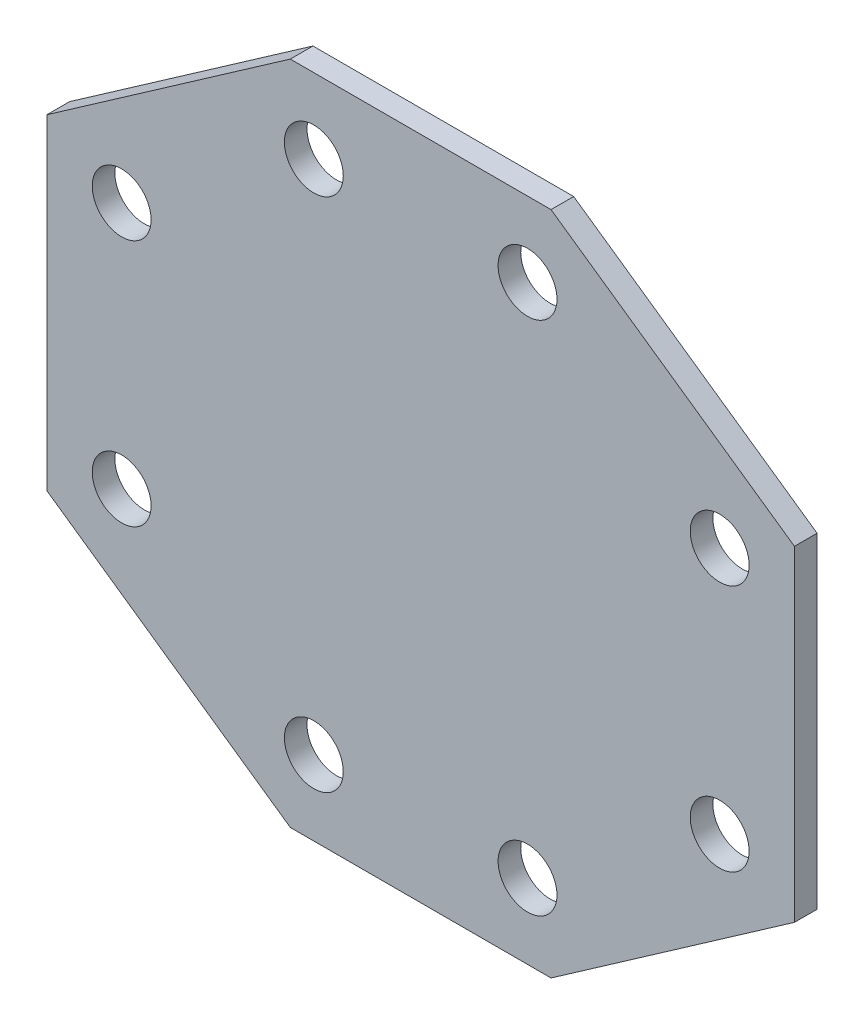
ISO-10303-21;
HEADER;
FILE_DESCRIPTION(('STEP AP214'),'2;1');
FILE_NAME('part.step','',(''),(''),'','','');
FILE_SCHEMA(('AUTOMOTIVE_DESIGN { 1 0 10303 214 1 1 1 1 }'));
ENDSEC;
DATA;
#1=APPLICATION_CONTEXT('core data for automotive mechanical design processes');
#2=APPLICATION_PROTOCOL_DEFINITION('international standard','automotive_design',2000,#1);
#3=PRODUCT_CONTEXT('',#1,'mechanical');
#4=PRODUCT('Part','Part','',(#3));
#5=PRODUCT_RELATED_PRODUCT_CATEGORY('part','',(#4));
#6=PRODUCT_DEFINITION_FORMATION('','',#4);
#7=PRODUCT_DEFINITION_CONTEXT('part definition',#1,'design');
#8=PRODUCT_DEFINITION('design','',#6,#7);
#9=PRODUCT_DEFINITION_SHAPE('','',#8);
#10=(LENGTH_UNIT() NAMED_UNIT(*) SI_UNIT(.MILLI.,.METRE.));
#11=(NAMED_UNIT(*) PLANE_ANGLE_UNIT() SI_UNIT($,.RADIAN.));
#12=(NAMED_UNIT(*) SI_UNIT($,.STERADIAN.) SOLID_ANGLE_UNIT());
#13=UNCERTAINTY_MEASURE_WITH_UNIT(LENGTH_MEASURE(1.E-05),#10,'distance_accuracy_value','');
#14=(GEOMETRIC_REPRESENTATION_CONTEXT(3) GLOBAL_UNCERTAINTY_ASSIGNED_CONTEXT((#13)) GLOBAL_UNIT_ASSIGNED_CONTEXT((#10,
#11,#12)) REPRESENTATION_CONTEXT('',''));
#15=CARTESIAN_POINT('',(0.,0.,0.));
#16=DIRECTION('',(0.,0.,1.));
#17=DIRECTION('',(1.,0.,0.));
#18=AXIS2_PLACEMENT_3D('',#15,#16,#17);
#19=CARTESIAN_POINT('',(0.,0.,0.));
#20=DIRECTION('',(0.,0.,-1.));
#21=DIRECTION('',(-1.,0.,0.));
#22=AXIS2_PLACEMENT_3D('',#19,#20,#21);
#23=PLANE('',#22);
#24=CARTESIAN_POINT('',(191.033610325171,-361.549268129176,0.));
#25=CARTESIAN_POINT('',(191.033667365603,-360.873124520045,0.));
#26=CARTESIAN_POINT('',(191.017155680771,-360.19697147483,0.));
#27=CARTESIAN_POINT('',(190.951007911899,-358.847903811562,0.));
#28=CARTESIAN_POINT('',(190.901450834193,-358.174985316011,0.));
#29=CARTESIAN_POINT('',(190.769223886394,-356.832384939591,0.));
#30=CARTESIAN_POINT('',(190.686552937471,-356.162703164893,0.));
#31=CARTESIAN_POINT('',(190.48820125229,-354.826573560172,0.));
#32=CARTESIAN_POINT('',(190.372440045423,-354.16013769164,0.));
#33=CARTESIAN_POINT('',(190.108624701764,-352.833789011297,0.));
#34=CARTESIAN_POINT('',(189.960575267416,-352.173875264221,0.));
#35=CARTESIAN_POINT('',(189.632557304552,-350.863671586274,0.));
#36=CARTESIAN_POINT('',(189.452664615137,-350.213362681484,0.));
#37=CARTESIAN_POINT('',(189.061041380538,-348.922357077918,0.));
#38=CARTESIAN_POINT('',(188.849308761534,-348.281661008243,0.));
#39=CARTESIAN_POINT('',(188.394088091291,-347.009860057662,0.));
#40=CARTESIAN_POINT('',(188.150522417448,-346.378782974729,0.));
#41=CARTESIAN_POINT('',(187.633003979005,-345.129357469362,0.));
#42=CARTESIAN_POINT('',(187.35905713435,-344.511006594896,0.));
#43=CARTESIAN_POINT('',(186.781734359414,-343.289971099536,0.));
#44=CARTESIAN_POINT('',(186.478429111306,-342.687253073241,0.));
#45=CARTESIAN_POINT('',(185.842467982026,-341.497455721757,0.));
#46=CARTESIAN_POINT('',(185.509810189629,-340.910377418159,0.));
#47=CARTESIAN_POINT('',(184.815220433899,-339.751822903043,0.));
#48=CARTESIAN_POINT('',(184.45321776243,-339.180389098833,0.));
#49=CARTESIAN_POINT('',(183.701892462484,-338.055933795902,0.));
#50=CARTESIAN_POINT('',(183.312575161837,-337.502908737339,0.));
#51=CARTESIAN_POINT('',(182.508133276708,-336.417965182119,0.));
#52=CARTESIAN_POINT('',(182.093071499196,-335.886000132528,0.));
#53=CARTESIAN_POINT('',(181.237212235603,-334.84313426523,0.));
#54=CARTESIAN_POINT('',(180.796413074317,-334.332234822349,0.));
#55=CARTESIAN_POINT('',(179.889146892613,-333.331449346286,0.));
#56=CARTESIAN_POINT('',(179.422618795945,-332.841618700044,0.));
#57=CARTESIAN_POINT('',(178.466359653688,-331.885345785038,0.));
#58=CARTESIAN_POINT('',(177.97663313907,-331.418898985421,0.));
#59=CARTESIAN_POINT('',(176.975986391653,-330.511741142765,0.));
#60=CARTESIAN_POINT('',(176.465118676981,-330.070972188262,0.));
#61=CARTESIAN_POINT('',(175.422251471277,-329.215114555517,0.));
#62=CARTESIAN_POINT('',(174.890250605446,-328.800027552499,0.));
#63=CARTESIAN_POINT('',(173.805173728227,-327.995470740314,0.));
#64=CARTESIAN_POINT('',(173.252048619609,-327.606067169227,0.));
#65=CARTESIAN_POINT('',(172.127604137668,-326.854725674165,0.));
#66=CARTESIAN_POINT('',(171.556288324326,-326.492782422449,0.));
#67=CARTESIAN_POINT('',(170.397891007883,-325.798271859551,0.));
#68=CARTESIAN_POINT('',(169.810849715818,-325.465637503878,0.));
#69=CARTESIAN_POINT('',(168.621051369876,-324.829678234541,0.));
#70=CARTESIAN_POINT('',(168.018293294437,-324.526355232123,0.));
#71=CARTESIAN_POINT('',(166.797104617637,-323.948945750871,0.));
#72=CARTESIAN_POINT('',(166.178638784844,-323.674933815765,0.));
#73=CARTESIAN_POINT('',(164.929220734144,-323.157397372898,0.));
#74=CARTESIAN_POINT('',(164.298270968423,-322.913866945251,0.));
#75=CARTESIAN_POINT('',(163.026639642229,-322.458693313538,0.));
#76=CARTESIAN_POINT('',(162.385984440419,-322.246976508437,0.));
#77=CARTESIAN_POINT('',(161.094978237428,-321.855355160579,0.));
#78=CARTESIAN_POINT('',(160.444626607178,-321.675452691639,0.));
#79=CARTESIAN_POINT('',(159.134255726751,-321.347380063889,0.));
#80=CARTESIAN_POINT('',(158.474216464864,-321.19928988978,0.));
#81=CARTESIAN_POINT('',(157.147839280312,-320.935447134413,0.));
#82=CARTESIAN_POINT('',(156.481502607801,-320.819688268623,0.));
#83=CARTESIAN_POINT('',(155.145505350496,-320.621343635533,0.));
#84=CARTESIAN_POINT('',(154.475856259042,-320.538680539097,0.));
#85=CARTESIAN_POINT('',(153.133254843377,-320.406446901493,0.));
#86=CARTESIAN_POINT('',(152.460302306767,-320.356878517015,0.));
#87=CARTESIAN_POINT('',(151.111106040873,-320.290750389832,0.));
#88=CARTESIAN_POINT('',(150.434858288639,-320.274272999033,0.));
#89=CARTESIAN_POINT('',(149.082493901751,-320.274263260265,0.));
#90=CARTESIAN_POINT('',(148.406377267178,-320.290724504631,0.));
#91=CARTESIAN_POINT('',(147.057355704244,-320.356831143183,0.));
#92=CARTESIAN_POINT('',(146.384446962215,-320.406398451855,0.));
#93=CARTESIAN_POINT('',(145.04184575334,-320.53863418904,0.));
#94=CARTESIAN_POINT('',(144.372153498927,-320.621304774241,0.));
#95=CARTESIAN_POINT('',(143.035980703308,-320.819662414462,0.));
#96=CARTESIAN_POINT('',(142.369512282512,-320.935431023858,0.));
#97=CARTESIAN_POINT('',(141.043131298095,-321.199254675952,0.));
#98=CARTESIAN_POINT('',(140.383217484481,-321.347303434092,0.));
#99=CARTESIAN_POINT('',(139.07301375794,-321.675320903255,0.));
#100=CARTESIAN_POINT('',(138.422704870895,-321.855213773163,0.));
#101=CARTESIAN_POINT('',(137.131699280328,-322.246837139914,0.));
#102=CARTESIAN_POINT('',(136.491003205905,-322.458569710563,0.));
#103=CARTESIAN_POINT('',(135.219202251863,-322.913790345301,0.));
#104=CARTESIAN_POINT('',(134.588125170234,-323.157356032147,0.));
#105=CARTESIAN_POINT('',(133.338699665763,-323.674874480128,0.));
#106=CARTESIAN_POINT('',(132.720348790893,-323.948821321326,0.));
#107=CARTESIAN_POINT('',(131.4993132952,-324.526144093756,0.));
#108=CARTESIAN_POINT('',(130.896595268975,-324.829449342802,0.));
#109=CARTESIAN_POINT('',(129.706797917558,-325.465410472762,0.));
#110=CARTESIAN_POINT('',(129.119719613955,-325.7980682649,0.));
#111=CARTESIAN_POINT('',(127.961165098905,-326.492658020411,0.));
#112=CARTESIAN_POINT('',(127.389731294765,-326.854660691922,0.));
#113=CARTESIAN_POINT('',(126.265275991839,-327.605985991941,0.));
#114=CARTESIAN_POINT('',(125.712250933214,-327.995303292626,0.));
#115=CARTESIAN_POINT('',(124.627307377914,-328.799745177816,0.));
#116=CARTESIAN_POINT('',(124.095342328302,-329.214806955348,0.));
#117=CARTESIAN_POINT('',(123.052476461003,-330.070666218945,0.));
#118=CARTESIAN_POINT('',(122.541577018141,-330.51146538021,0.));
#119=CARTESIAN_POINT('',(121.54079154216,-331.418731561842,0.));
#120=CARTESIAN_POINT('',(121.050960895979,-331.885259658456,0.));
#121=CARTESIAN_POINT('',(120.094687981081,-332.841518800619,0.));
#122=CARTESIAN_POINT('',(119.628241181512,-333.331245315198,0.));
#123=CARTESIAN_POINT('',(118.72108333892,-334.33189206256,0.));
#124=CARTESIAN_POINT('',(118.280314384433,-334.84275977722,0.));
#125=CARTESIAN_POINT('',(117.424456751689,-335.885626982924,0.));
#126=CARTESIAN_POINT('',(117.009369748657,-336.417627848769,0.));
#127=CARTESIAN_POINT('',(116.204812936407,-337.502704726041,0.));
#128=CARTESIAN_POINT('',(115.815409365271,-338.055829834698,0.));
#129=CARTESIAN_POINT('',(115.064067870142,-339.180274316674,0.));
#130=CARTESIAN_POINT('',(114.702124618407,-339.751590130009,0.));
#131=CARTESIAN_POINT('',(114.007614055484,-340.909987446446,0.));
#132=CARTESIAN_POINT('',(113.674979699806,-341.49702873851,0.));
#133=CARTESIAN_POINT('',(113.039020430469,-342.686827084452,0.));
#134=CARTESIAN_POINT('',(112.735697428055,-343.289585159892,0.));
#135=CARTESIAN_POINT('',(112.158287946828,-344.510773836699,0.));
#136=CARTESIAN_POINT('',(111.884276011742,-345.129239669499,0.));
#137=CARTESIAN_POINT('',(111.36673956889,-346.378657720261,0.));
#138=CARTESIAN_POINT('',(111.123209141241,-347.00960748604,0.));
#139=CARTESIAN_POINT('',(110.668035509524,-348.28123881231,0.));
#140=CARTESIAN_POINT('',(110.45631870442,-348.921894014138,0.));
#141=CARTESIAN_POINT('',(110.064697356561,-350.21290021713,0.));
#142=CARTESIAN_POINT('',(109.884794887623,-350.86325184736,0.));
#143=CARTESIAN_POINT('',(109.556722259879,-352.17362272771,0.));
#144=CARTESIAN_POINT('',(109.408632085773,-352.83366198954,0.));
#145=CARTESIAN_POINT('',(109.144789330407,-354.160039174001,0.));
#146=CARTESIAN_POINT('',(109.029030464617,-354.826375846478,0.));
#147=CARTESIAN_POINT('',(108.830685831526,-356.162373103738,0.));
#148=CARTESIAN_POINT('',(108.748022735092,-356.832022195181,0.));
#149=CARTESIAN_POINT('',(108.615789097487,-358.174623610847,0.));
#150=CARTESIAN_POINT('',(108.56622071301,-358.847576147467,0.));
#151=CARTESIAN_POINT('',(108.500092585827,-360.196772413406,0.));
#152=CARTESIAN_POINT('',(108.483615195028,-360.873020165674,0.));
#153=CARTESIAN_POINT('',(108.483605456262,-362.225384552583,0.));
#154=CARTESIAN_POINT('',(108.500066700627,-362.901501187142,0.));
#155=CARTESIAN_POINT('',(108.566173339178,-364.250522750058,0.));
#156=CARTESIAN_POINT('',(108.615740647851,-364.923431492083,0.));
#157=CARTESIAN_POINT('',(108.747976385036,-366.266032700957,0.));
#158=CARTESIAN_POINT('',(108.830646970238,-366.935724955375,0.));
#159=CARTESIAN_POINT('',(109.029004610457,-368.271897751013,0.));
#160=CARTESIAN_POINT('',(109.144773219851,-368.938366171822,0.));
#161=CARTESIAN_POINT('',(109.408596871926,-370.264747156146,0.));
#162=CARTESIAN_POINT('',(109.556645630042,-370.924660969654,0.));
#163=CARTESIAN_POINT('',(109.884663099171,-372.234864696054,0.));
#164=CARTESIAN_POINT('',(110.064555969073,-372.885173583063,0.));
#165=CARTESIAN_POINT('',(110.456179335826,-374.176179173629,0.));
#166=CARTESIAN_POINT('',(110.667911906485,-374.816875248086,0.));
#167=CARTESIAN_POINT('',(111.123132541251,-376.088676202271,0.));
#168=CARTESIAN_POINT('',(111.366698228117,-376.719753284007,0.));
#169=CARTESIAN_POINT('',(111.884216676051,-377.96917878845,0.));
#170=CARTESIAN_POINT('',(112.158163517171,-378.58752966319,0.));
#171=CARTESIAN_POINT('',(112.735486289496,-379.808565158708,0.));
#172=CARTESIAN_POINT('',(113.038791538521,-380.411283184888,0.));
#173=CARTESIAN_POINT('',(113.674752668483,-381.601080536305,0.));
#174=CARTESIAN_POINT('',(114.007410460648,-382.18815883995,0.));
#175=CARTESIAN_POINT('',(114.702000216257,-383.346713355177,0.));
#176=CARTESIAN_POINT('',(115.064002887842,-383.91814715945,0.));
#177=CARTESIAN_POINT('',(115.81532818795,-385.042602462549,0.));
#178=CARTESIAN_POINT('',(116.204645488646,-385.595627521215,0.));
#179=CARTESIAN_POINT('',(117.009087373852,-386.680571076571,0.));
#180=CARTESIAN_POINT('',(117.42414915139,-387.212536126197,0.));
#181=CARTESIAN_POINT('',(118.280008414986,-388.255401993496,0.));
#182=CARTESIAN_POINT('',(118.720807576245,-388.766301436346,0.));
#183=CARTESIAN_POINT('',(119.628073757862,-389.76708691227,0.));
#184=CARTESIAN_POINT('',(120.094601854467,-390.256917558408,0.));
#185=CARTESIAN_POINT('',(121.050860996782,-391.21319047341,0.));
#186=CARTESIAN_POINT('',(121.540587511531,-391.679637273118,0.));
#187=CARTESIAN_POINT('',(122.541234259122,-392.586795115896,0.));
#188=CARTESIAN_POINT('',(123.052101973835,-393.027564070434,0.));
#189=CARTESIAN_POINT('',(124.094969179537,-393.88342170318,0.));
#190=CARTESIAN_POINT('',(124.626970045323,-394.298508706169,0.));
#191=CARTESIAN_POINT('',(125.712046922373,-395.103065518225,0.));
#192=CARTESIAN_POINT('',(126.265172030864,-395.492469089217,0.));
#193=CARTESIAN_POINT('',(127.389616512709,-396.243810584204,0.));
#194=CARTESIAN_POINT('',(127.960932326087,-396.605753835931,0.));
#195=CARTESIAN_POINT('',(129.11932964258,-397.300264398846,0.));
#196=CARTESIAN_POINT('',(129.706370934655,-397.632898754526,0.));
#197=CARTESIAN_POINT('',(130.896169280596,-398.268858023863,0.));
#198=CARTESIAN_POINT('',(131.498927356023,-398.572181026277,0.));
#199=CARTESIAN_POINT('',(132.720116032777,-399.149590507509,0.));
#200=CARTESIAN_POINT('',(133.338581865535,-399.4236024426,0.));
#201=CARTESIAN_POINT('',(134.587999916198,-399.941138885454,0.));
#202=CARTESIAN_POINT('',(135.218949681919,-400.184669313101,0.));
#203=CARTESIAN_POINT('',(136.490581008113,-400.639842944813,0.));
#204=CARTESIAN_POINT('',(137.131236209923,-400.851559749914,0.));
#205=CARTESIAN_POINT('',(138.422242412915,-401.243181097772,0.));
#206=CARTESIAN_POINT('',(139.072594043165,-401.423083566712,0.));
#207=CARTESIAN_POINT('',(140.382964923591,-401.751156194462,0.));
#208=CARTESIAN_POINT('',(141.043004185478,-401.899246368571,0.));
#209=CARTESIAN_POINT('',(142.369381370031,-402.163089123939,0.));
#210=CARTESIAN_POINT('',(143.035718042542,-402.278847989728,0.));
#211=CARTESIAN_POINT('',(144.371715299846,-402.477192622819,0.));
#212=CARTESIAN_POINT('',(145.041364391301,-402.559855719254,0.));
#213=CARTESIAN_POINT('',(146.383965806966,-402.692089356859,0.));
#214=CARTESIAN_POINT('',(147.056918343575,-402.741657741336,0.));
#215=CARTESIAN_POINT('',(148.406114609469,-402.807785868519,0.));
#216=CARTESIAN_POINT('',(149.082362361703,-402.824263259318,0.));
#217=CARTESIAN_POINT('',(150.434726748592,-402.824272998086,0.));
#218=CARTESIAN_POINT('',(151.110843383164,-402.807811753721,0.));
#219=CARTESIAN_POINT('',(152.459864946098,-402.741705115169,0.));
#220=CARTESIAN_POINT('',(153.132773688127,-402.692137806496,0.));
#221=CARTESIAN_POINT('',(154.475374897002,-402.559902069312,0.));
#222=CARTESIAN_POINT('',(155.145067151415,-402.47723148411,0.));
#223=CARTESIAN_POINT('',(156.481239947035,-402.27887384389,0.));
#224=CARTESIAN_POINT('',(157.147708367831,-402.163105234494,0.));
#225=CARTESIAN_POINT('',(158.474089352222,-401.899281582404,0.));
#226=CARTESIAN_POINT('',(159.13400316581,-401.751232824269,0.));
#227=CARTESIAN_POINT('',(160.444206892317,-401.423215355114,0.));
#228=CARTESIAN_POINT('',(161.094515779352,-401.243322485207,0.));
#229=CARTESIAN_POINT('',(162.385521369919,-400.851699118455,0.));
#230=CARTESIAN_POINT('',(163.026217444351,-400.639966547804,0.));
#231=CARTESIAN_POINT('',(164.298018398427,-400.18474591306,0.));
#232=CARTESIAN_POINT('',(164.929095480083,-399.941180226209,0.));
#233=CARTESIAN_POINT('',(166.178520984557,-399.423661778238,0.));
#234=CARTESIAN_POINT('',(166.796871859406,-399.149714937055,0.));
#235=CARTESIAN_POINT('',(168.01790735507,-398.572392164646,0.));
#236=CARTESIAN_POINT('',(168.620625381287,-398.269086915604,0.));
#237=CARTESIAN_POINT('',(169.810422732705,-397.633125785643,0.));
#238=CARTESIAN_POINT('',(170.397501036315,-397.300467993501,0.));
#239=CARTESIAN_POINT('',(171.556055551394,-396.60587823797,0.));
#240=CARTESIAN_POINT('',(172.127489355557,-396.243875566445,0.));
#241=CARTESIAN_POINT('',(173.251944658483,-395.492550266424,0.));
#242=CARTESIAN_POINT('',(173.804969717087,-395.103232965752,0.));
#243=CARTESIAN_POINT('',(174.889913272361,-394.298791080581,0.));
#244=CARTESIAN_POINT('',(175.421878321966,-393.883729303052,0.));
#245=CARTESIAN_POINT('',(176.464744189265,-393.027870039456,0.));
#246=CARTESIAN_POINT('',(176.975643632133,-392.587070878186,0.));
#247=CARTESIAN_POINT('',(177.976429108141,-391.679804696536,0.));
#248=CARTESIAN_POINT('',(178.466259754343,-391.213276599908,0.));
#249=CARTESIAN_POINT('',(179.42253266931,-390.257017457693,0.));
#250=CARTESIAN_POINT('',(179.888979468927,-389.767290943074,0.));
#251=CARTESIAN_POINT('',(180.796137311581,-388.766644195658,0.));
#252=CARTESIAN_POINT('',(181.236906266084,-388.255776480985,0.));
#253=CARTESIAN_POINT('',(182.092763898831,-387.212909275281,0.));
#254=CARTESIAN_POINT('',(182.50785090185,-386.680908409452,0.));
#255=CARTESIAN_POINT('',(183.31240771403,-385.59583153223,0.));
#256=CARTESIAN_POINT('',(183.701811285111,-385.042706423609,0.));
#257=CARTESIAN_POINT('',(184.453152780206,-383.918261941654,0.));
#258=CARTESIAN_POINT('',(184.815096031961,-383.346946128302,0.));
#259=CARTESIAN_POINT('',(185.509606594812,-382.1885488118,0.));
#260=CARTESIAN_POINT('',(185.8422409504,-381.601507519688,0.));
#261=CARTESIAN_POINT('',(186.478200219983,-380.411709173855,0.));
#262=CARTESIAN_POINT('',(186.781523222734,-379.808951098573,0.));
#263=CARTESIAN_POINT('',(187.358932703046,-378.587762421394,0.));
#264=CARTESIAN_POINT('',(187.632944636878,-377.969296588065,0.));
#265=CARTESIAN_POINT('',(188.150481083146,-376.719878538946,0.));
#266=CARTESIAN_POINT('',(188.394011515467,-376.088928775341,0.));
#267=CARTESIAN_POINT('',(188.849185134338,-374.81729744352,0.));
#268=CARTESIAN_POINT('',(189.060901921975,-374.176642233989,0.));
#269=CARTESIAN_POINT('',(189.452523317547,-372.885636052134,0.));
#270=CARTESIAN_POINT('',(189.63242585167,-372.235284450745,0.));
#271=CARTESIAN_POINT('',(189.960498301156,-370.924913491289,0.));
#272=CARTESIAN_POINT('',(190.108588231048,-370.264874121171,0.));
#273=CARTESIAN_POINT('',(190.372438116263,-368.938464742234,0.));
#274=CARTESIAN_POINT('',(190.488202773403,-368.272095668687,0.));
#275=CARTESIAN_POINT('',(190.686557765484,-366.936054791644,0.));
#276=CARTESIAN_POINT('',(190.769226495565,-366.266394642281,0.));
#277=CARTESIAN_POINT('',(190.901452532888,-364.923793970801,0.));
#278=CARTESIAN_POINT('',(190.951008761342,-364.250853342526,0.));
#279=CARTESIAN_POINT('',(191.017156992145,-362.901697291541,0.));
#280=CARTESIAN_POINT('',(191.03366781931,-362.225477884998,0.));
#281=CARTESIAN_POINT('',(191.033610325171,-361.549268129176,0.));
#282=B_SPLINE_CURVE_WITH_KNOTS('',3,(#24,#25,#26,#27,#28,#29,#30,#31,#32,#33,#34,#35,#36,#37,
#38,#39,#40,#41,#42,#43,#44,#45,#46,#47,#48,#49,#50,#51,#52,#53,#54,#55,#56,#57,#58,#59,#60,#61,
#62,#63,#64,#65,#66,#67,#68,#69,#70,#71,#72,#73,#74,#75,#76,#77,#78,#79,#80,#81,#82,#83,#84,#85,
#86,#87,#88,#89,#90,#91,#92,#93,#94,#95,#96,#97,#98,#99,#100,#101,#102,#103,#104,#105,#106,#107,
#108,#109,#110,#111,#112,#113,#114,#115,#116,#117,#118,#119,#120,#121,#122,#123,#124,#125,#126,
#127,#128,#129,#130,#131,#132,#133,#134,#135,#136,#137,#138,#139,#140,#141,#142,#143,#144,#145,
#146,#147,#148,#149,#150,#151,#152,#153,#154,#155,#156,#157,#158,#159,#160,#161,#162,#163,#164,
#165,#166,#167,#168,#169,#170,#171,#172,#173,#174,#175,#176,#177,#178,#179,#180,#181,#182,#183,
#184,#185,#186,#187,#188,#189,#190,#191,#192,#193,#194,#195,#196,#197,#198,#199,#200,#201,#202,
#203,#204,#205,#206,#207,#208,#209,#210,#211,#212,#213,#214,#215,#216,#217,#218,#219,#220,#221,
#222,#223,#224,#225,#226,#227,#228,#229,#230,#231,#232,#233,#234,#235,#236,#237,#238,#239,#240,
#241,#242,#243,#244,#245,#246,#247,#248,#249,#250,#251,#252,#253,#254,#255,#256,#257,#258,#259,
#260,#261,#262,#263,#264,#265,#266,#267,#268,#269,#270,#271,#272,#273,#274,#275,#276,#277,#278,
#279,#280,#281),.UNSPECIFIED.,.F.,.F.,(4,2,2,2,2,2,2,2,2,2,2,2,2,2,2,2,2,2,2,2,2,2,2,2,2,2,2,2,
2,2,2,2,2,2,2,2,2,2,2,2,2,2,2,2,2,2,2,2,2,2,2,2,2,2,2,2,2,2,2,2,2,2,2,2,2,2,2,2,2,2,2,2,2,2,2,2,
2,2,2,2,2,2,2,2,2,2,2,2,2,2,2,2,2,2,2,2,2,2,2,2,2,2,2,2,2,2,2,2,2,2,2,2,2,2,2,2,2,2,2,2,2,2,2,2,
2,2,2,2,4),(0.,2.02824070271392,4.05164950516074,6.07512423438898,8.10356223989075,
10.1317050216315,12.1550809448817,14.1785887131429,16.2071260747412,18.2352688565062,
20.2586447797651,22.2821525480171,24.3106899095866,26.3388326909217,28.3622086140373,
30.3857163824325,32.4142537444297,34.4423965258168,36.4657724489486,38.4892802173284,
40.5178175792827,42.5459603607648,44.5693362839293,46.5928440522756,48.6213814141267,
50.6495241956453,52.6729001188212,54.6964078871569,56.7249452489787,58.7530880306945,
60.7764639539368,62.7999717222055,64.8285090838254,66.8566518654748,68.8800277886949,
70.903535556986,72.932072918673,74.9602157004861,76.9835916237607,79.0070993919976,
81.0356367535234,83.0637795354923,85.0871554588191,87.1106632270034,89.139200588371,
91.1673433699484,93.190719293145,95.214227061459,97.2427644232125,99.2709072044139,
101.294283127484,103.317790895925,105.34632825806,107.374471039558,109.397846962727,
111.42135473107,113.449892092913,115.478034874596,117.501410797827,119.524918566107,
121.553455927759,123.581598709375,125.604974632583,127.628482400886,129.657019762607,
131.685162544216,133.708538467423,135.732046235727,137.760583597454,139.788726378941,
141.812102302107,143.835610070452,145.8641474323,147.892290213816,149.915666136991,
151.939173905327,153.96771126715,155.99585404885,158.019229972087,160.042737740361,
162.071275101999,164.09941788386,166.122793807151,168.146301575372,170.174838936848,
172.202981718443,174.226357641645,176.249865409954,178.27840277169,180.306545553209,
182.329921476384,184.35342924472,186.381966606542,188.410109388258,190.4334853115,
192.456993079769,194.485530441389,196.513673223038,198.537049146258,200.560556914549,
202.589094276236,204.61723705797,206.640612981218,208.664120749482,210.692658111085,
212.720800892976,214.744176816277,216.767684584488,218.796221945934,220.824364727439,
222.847740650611,224.871248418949,226.899785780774,228.927928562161,230.951304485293,
232.974812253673,235.003349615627,237.031492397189,239.054868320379,241.0783760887,
243.106913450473,245.135056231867,247.158432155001,249.181939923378,251.21047728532,
253.238719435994,255.262128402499,257.285603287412,259.314042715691),.UNSPECIFIED.);
#283=CARTESIAN_POINT('',(191.033610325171,-361.549268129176,0.));
#284=VERTEX_POINT('',#283);
#285=EDGE_CURVE('E236',#284,#284,#282,.T.);
#286=ORIENTED_EDGE('',*,*,#285,.T.);
#287=EDGE_LOOP('',(#286));
#288=FACE_BOUND('',#287,.T.);
#289=CARTESIAN_POINT('',(460.355268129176,173.588730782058,0.));
#290=CARTESIAN_POINT('',(460.355325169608,174.264874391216,0.));
#291=CARTESIAN_POINT('',(460.338813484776,174.941027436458,0.));
#292=CARTESIAN_POINT('',(460.272665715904,176.290095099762,0.));
#293=CARTESIAN_POINT('',(460.223108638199,176.963013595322,0.));
#294=CARTESIAN_POINT('',(460.0908816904,178.305613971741,0.));
#295=CARTESIAN_POINT('',(460.008210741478,178.975295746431,0.));
#296=CARTESIAN_POINT('',(459.809859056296,180.311425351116,0.));
#297=CARTESIAN_POINT('',(459.694097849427,180.97786121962,0.));
#298=CARTESIAN_POINT('',(459.430282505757,182.304209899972,0.));
#299=CARTESIAN_POINT('',(459.282233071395,182.964123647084,0.));
#300=CARTESIAN_POINT('',(458.954215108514,184.274327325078,0.));
#301=CARTESIAN_POINT('',(458.774322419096,184.92463622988,0.));
#302=CARTESIAN_POINT('',(458.382699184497,186.215641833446,0.));
#303=CARTESIAN_POINT('',(458.170966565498,186.856337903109,0.));
#304=CARTESIAN_POINT('',(457.71574589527,188.128138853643,0.));
#305=CARTESIAN_POINT('',(457.472180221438,188.759215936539,0.));
#306=CARTESIAN_POINT('',(456.954661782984,190.008641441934,0.));
#307=CARTESIAN_POINT('',(456.6807149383,190.626992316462,0.));
#308=CARTESIAN_POINT('',(456.103392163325,191.848027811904,0.));
#309=CARTESIAN_POINT('',(455.800086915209,192.45074583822,0.));
#310=CARTESIAN_POINT('',(455.16412578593,193.640543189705,0.));
#311=CARTESIAN_POINT('',(454.831467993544,194.227621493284,0.));
#312=CARTESIAN_POINT('',(454.136878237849,195.386176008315,0.));
#313=CARTESIAN_POINT('',(453.774875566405,195.957609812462,0.));
#314=CARTESIAN_POINT('',(453.023550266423,197.082065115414,0.));
#315=CARTESIAN_POINT('',(452.634232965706,197.635090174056,0.));
#316=CARTESIAN_POINT('',(451.829791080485,198.720033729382,0.));
#317=CARTESIAN_POINT('',(451.414729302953,199.251998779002,0.));
#318=CARTESIAN_POINT('',(450.55887003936,200.294864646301,0.));
#319=CARTESIAN_POINT('',(450.118070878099,200.805764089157,0.));
#320=CARTESIAN_POINT('',(449.210804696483,201.80654956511,0.));
#321=CARTESIAN_POINT('',(448.744276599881,202.29638021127,0.));
#322=CARTESIAN_POINT('',(447.788017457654,203.252653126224,0.));
#323=CARTESIAN_POINT('',(447.298290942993,203.719099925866,0.));
#324=CARTESIAN_POINT('',(446.297644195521,204.626257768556,0.));
#325=CARTESIAN_POINT('',(445.786776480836,205.067026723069,0.));
#326=CARTESIAN_POINT('',(444.743909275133,205.922884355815,0.));
#327=CARTESIAN_POINT('',(444.211908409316,206.337971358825,0.));
#328=CARTESIAN_POINT('',(443.12683153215,207.142528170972,0.));
#329=CARTESIAN_POINT('',(442.573706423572,207.531931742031,0.));
#330=CARTESIAN_POINT('',(441.449261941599,208.283273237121,0.));
#331=CARTESIAN_POINT('',(440.877946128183,208.645216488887,0.));
#332=CARTESIAN_POINT('',(439.719548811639,209.33972705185,0.));
#333=CARTESIAN_POINT('',(439.13250751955,209.672361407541,0.));
#334=CARTESIAN_POINT('',(437.942709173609,210.308320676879,0.));
#335=CARTESIAN_POINT('',(437.339951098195,210.611643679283,0.));
#336=CARTESIAN_POINT('',(436.118762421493,211.189053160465,0.));
#337=CARTESIAN_POINT('',(435.500296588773,211.463065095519,0.));
#338=CARTESIAN_POINT('',(434.250878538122,211.980601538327,0.));
#339=CARTESIAN_POINT('',(433.619928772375,212.224131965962,0.));
#340=CARTESIAN_POINT('',(432.348297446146,212.679305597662,0.));
#341=CARTESIAN_POINT('',(431.707642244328,212.891022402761,0.));
#342=CARTESIAN_POINT('',(430.416636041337,213.282643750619,0.));
#343=CARTESIAN_POINT('',(429.766284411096,213.462546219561,0.));
#344=CARTESIAN_POINT('',(428.455913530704,213.790618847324,0.));
#345=CARTESIAN_POINT('',(427.795874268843,213.938709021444,0.));
#346=CARTESIAN_POINT('',(426.469497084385,214.202551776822,0.));
#347=CARTESIAN_POINT('',(425.803160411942,214.318310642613,0.));
#348=CARTESIAN_POINT('',(424.467163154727,214.516655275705,0.));
#349=CARTESIAN_POINT('',(423.797514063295,214.599318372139,0.));
#350=CARTESIAN_POINT('',(422.454912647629,214.731552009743,0.));
#351=CARTESIAN_POINT('',(421.781960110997,214.781120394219,0.));
#352=CARTESIAN_POINT('',(420.432763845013,214.847248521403,0.));
#353=CARTESIAN_POINT('',(419.756516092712,214.863725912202,0.));
#354=CARTESIAN_POINT('',(418.404151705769,214.863735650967,0.));
#355=CARTESIAN_POINT('',(417.72803507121,214.847274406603,0.));
#356=CARTESIAN_POINT('',(416.379013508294,214.781167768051,0.));
#357=CARTESIAN_POINT('',(415.706104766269,214.731600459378,0.));
#358=CARTESIAN_POINT('',(414.363503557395,214.599364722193,0.));
#359=CARTESIAN_POINT('',(413.693811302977,214.516694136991,0.));
#360=CARTESIAN_POINT('',(412.357638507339,214.318336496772,0.));
#361=CARTESIAN_POINT('',(411.69117008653,214.202567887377,0.));
#362=CARTESIAN_POINT('',(410.364789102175,213.938744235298,0.));
#363=CARTESIAN_POINT('',(409.704875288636,213.790695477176,0.));
#364=CARTESIAN_POINT('',(408.394671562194,213.462678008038,0.));
#365=CARTESIAN_POINT('',(407.744362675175,213.282785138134,0.));
#366=CARTESIAN_POINT('',(406.453357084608,212.891161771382,0.));
#367=CARTESIAN_POINT('',(405.812661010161,212.679429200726,0.));
#368=CARTESIAN_POINT('',(404.540860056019,212.224208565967,0.));
#369=CARTESIAN_POINT('',(403.909782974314,211.980642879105,0.));
#370=CARTESIAN_POINT('',(402.660357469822,211.46312443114,0.));
#371=CARTESIAN_POINT('',(402.042006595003,211.18917758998,0.));
#372=CARTESIAN_POINT('',(400.82097109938,210.6118548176,0.));
#373=CARTESIAN_POINT('',(400.218253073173,210.308549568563,0.));
#374=CARTESIAN_POINT('',(399.028455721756,209.672588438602,0.));
#375=CARTESIAN_POINT('',(398.441377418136,209.339930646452,0.));
#376=CARTESIAN_POINT('',(397.282822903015,208.645340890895,0.));
#377=CARTESIAN_POINT('',(396.711389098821,208.283338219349,0.));
#378=CARTESIAN_POINT('',(395.586933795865,207.532012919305,0.));
#379=CARTESIAN_POINT('',(395.03390873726,207.142695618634,0.));
#380=CARTESIAN_POINT('',(393.948965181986,206.338253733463,0.));
#381=CARTESIAN_POINT('',(393.417000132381,205.923191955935,0.));
#382=CARTESIAN_POINT('',(392.374134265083,205.067332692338,0.));
#383=CARTESIAN_POINT('',(391.863234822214,204.626533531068,0.));
#384=CARTESIAN_POINT('',(390.862449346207,203.719267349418,0.));
#385=CARTESIAN_POINT('',(390.372618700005,203.25273925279,0.));
#386=CARTESIAN_POINT('',(389.41634578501,202.296480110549,0.));
#387=CARTESIAN_POINT('',(388.949898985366,201.806753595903,0.));
#388=CARTESIAN_POINT('',(388.042741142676,200.80610684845,0.));
#389=CARTESIAN_POINT('',(387.601972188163,200.295239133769,0.));
#390=CARTESIAN_POINT('',(386.746114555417,199.252371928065,0.));
#391=CARTESIAN_POINT('',(386.331027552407,198.720371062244,0.));
#392=CARTESIAN_POINT('',(385.52647074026,197.63529418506,0.));
#393=CARTESIAN_POINT('',(385.137067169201,197.082169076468,0.));
#394=CARTESIAN_POINT('',(384.38572567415,195.957724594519,0.));
#395=CARTESIAN_POINT('',(384.023782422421,195.386408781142,0.));
#396=CARTESIAN_POINT('',(383.329271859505,194.22801146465,0.));
#397=CARTESIAN_POINT('',(382.996637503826,193.640970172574,0.));
#398=CARTESIAN_POINT('',(382.360678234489,192.451171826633,0.));
#399=CARTESIAN_POINT('',(382.057355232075,191.848413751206,0.));
#400=CARTESIAN_POINT('',(381.479945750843,190.627225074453,0.));
#401=CARTESIAN_POINT('',(381.205933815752,190.008759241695,0.));
#402=CARTESIAN_POINT('',(380.688397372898,188.759341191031,0.));
#403=CARTESIAN_POINT('',(380.444866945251,188.12839142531,0.));
#404=CARTESIAN_POINT('',(379.989693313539,186.856760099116,0.));
#405=CARTESIAN_POINT('',(379.777976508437,186.216104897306,0.));
#406=CARTESIAN_POINT('',(379.38635516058,184.925098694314,0.));
#407=CARTESIAN_POINT('',(379.20645269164,184.274747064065,0.));
#408=CARTESIAN_POINT('',(378.87838006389,182.964376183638,0.));
#409=CARTESIAN_POINT('',(378.730289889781,182.304336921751,0.));
#410=CARTESIAN_POINT('',(378.466447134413,180.977959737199,0.));
#411=CARTESIAN_POINT('',(378.350688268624,180.311623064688,0.));
#412=CARTESIAN_POINT('',(378.152343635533,178.975625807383,0.));
#413=CARTESIAN_POINT('',(378.069680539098,178.305976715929,0.));
#414=CARTESIAN_POINT('',(377.937446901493,176.963375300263,0.));
#415=CARTESIAN_POINT('',(377.887878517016,176.290422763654,0.));
#416=CARTESIAN_POINT('',(377.821750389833,174.94122649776,0.));
#417=CARTESIAN_POINT('',(377.805272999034,174.264978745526,0.));
#418=CARTESIAN_POINT('',(377.805263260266,172.912614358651,0.));
#419=CARTESIAN_POINT('',(377.821724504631,172.236497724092,0.));
#420=CARTESIAN_POINT('',(377.887831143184,170.887476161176,0.));
#421=CARTESIAN_POINT('',(377.937398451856,170.214567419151,0.));
#422=CARTESIAN_POINT('',(378.069634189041,168.871966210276,0.));
#423=CARTESIAN_POINT('',(378.152304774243,168.202273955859,0.));
#424=CARTESIAN_POINT('',(378.350662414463,166.866101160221,0.));
#425=CARTESIAN_POINT('',(378.466431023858,166.199632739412,0.));
#426=CARTESIAN_POINT('',(378.730254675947,164.873251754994,0.));
#427=CARTESIAN_POINT('',(378.878303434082,164.213337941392,0.));
#428=CARTESIAN_POINT('',(379.206320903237,162.903134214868,0.));
#429=CARTESIAN_POINT('',(379.386213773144,162.252825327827,0.));
#430=CARTESIAN_POINT('',(379.777837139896,160.96181973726,0.));
#431=CARTESIAN_POINT('',(379.989569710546,160.321123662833,0.));
#432=CARTESIAN_POINT('',(380.444790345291,159.049322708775,0.));
#433=CARTESIAN_POINT('',(380.688356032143,158.418245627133,0.));
#434=CARTESIAN_POINT('',(381.205874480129,157.16882012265,0.));
#435=CARTESIAN_POINT('',(381.479821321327,156.550469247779,0.));
#436=CARTESIAN_POINT('',(382.057144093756,155.329433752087,0.));
#437=CARTESIAN_POINT('',(382.360449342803,154.726715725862,0.));
#438=CARTESIAN_POINT('',(382.996410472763,153.536918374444,0.));
#439=CARTESIAN_POINT('',(383.3290682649,152.949840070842,0.));
#440=CARTESIAN_POINT('',(384.023658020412,151.791285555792,0.));
#441=CARTESIAN_POINT('',(384.385660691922,151.219851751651,0.));
#442=CARTESIAN_POINT('',(385.136985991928,150.095396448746,0.));
#443=CARTESIAN_POINT('',(385.5263032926,149.542371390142,0.));
#444=CARTESIAN_POINT('',(386.330745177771,148.457427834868,0.));
#445=CARTESIAN_POINT('',(386.7458069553,147.925462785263,0.));
#446=CARTESIAN_POINT('',(387.601666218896,146.882596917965,0.));
#447=CARTESIAN_POINT('',(388.042465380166,146.371697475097,0.));
#448=CARTESIAN_POINT('',(388.949731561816,145.370911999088,0.));
#449=CARTESIAN_POINT('',(389.416259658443,144.881081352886,0.));
#450=CARTESIAN_POINT('',(390.372518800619,143.924808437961,0.));
#451=CARTESIAN_POINT('',(390.862245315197,143.458361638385,0.));
#452=CARTESIAN_POINT('',(391.86289206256,142.551203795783,0.));
#453=CARTESIAN_POINT('',(392.373759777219,142.110434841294,0.));
#454=CARTESIAN_POINT('',(393.416626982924,141.254577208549,0.));
#455=CARTESIAN_POINT('',(393.948627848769,140.83949020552,0.));
#456=CARTESIAN_POINT('',(395.03370472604,140.034933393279,0.));
#457=CARTESIAN_POINT('',(395.586829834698,139.64552982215,0.));
#458=CARTESIAN_POINT('',(396.711274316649,138.894188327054,0.));
#459=CARTESIAN_POINT('',(397.282590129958,138.532245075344,0.));
#460=CARTESIAN_POINT('',(398.440987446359,137.837734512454,0.));
#461=CARTESIAN_POINT('',(399.028028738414,137.505100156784,0.));
#462=CARTESIAN_POINT('',(400.217827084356,136.869140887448,0.));
#463=CARTESIAN_POINT('',(400.820585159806,136.565817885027,0.));
#464=CARTESIAN_POINT('',(402.041773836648,135.988408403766,0.));
#465=CARTESIAN_POINT('',(402.660239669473,135.714396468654,0.));
#466=CARTESIAN_POINT('',(403.90965772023,135.196860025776,0.));
#467=CARTESIAN_POINT('',(404.540607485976,134.953329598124,0.));
#468=CARTESIAN_POINT('',(405.812238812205,134.498155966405,0.));
#469=CARTESIAN_POINT('',(406.452894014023,134.286439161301,0.));
#470=CARTESIAN_POINT('',(407.743900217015,133.894817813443,0.));
#471=CARTESIAN_POINT('',(408.394251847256,133.714915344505,0.));
#472=CARTESIAN_POINT('',(409.704622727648,133.386842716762,0.));
#473=CARTESIAN_POINT('',(410.364661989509,133.238752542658,0.));
#474=CARTESIAN_POINT('',(411.691039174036,132.974909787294,0.));
#475=CARTESIAN_POINT('',(412.357375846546,132.859150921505,0.));
#476=CARTESIAN_POINT('',(413.693373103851,132.660806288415,0.));
#477=CARTESIAN_POINT('',(414.363022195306,132.57814319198,0.));
#478=CARTESIAN_POINT('',(415.705623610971,132.445909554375,0.));
#479=CARTESIAN_POINT('',(416.37857614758,132.396341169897,0.));
#480=CARTESIAN_POINT('',(417.727772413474,132.330213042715,0.));
#481=CARTESIAN_POINT('',(418.404020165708,132.313735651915,0.));
#482=CARTESIAN_POINT('',(419.756384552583,132.313725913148,0.));
#483=CARTESIAN_POINT('',(420.432501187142,132.330187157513,0.));
#484=CARTESIAN_POINT('',(421.781522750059,132.396293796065,0.));
#485=CARTESIAN_POINT('',(422.454431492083,132.445861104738,0.));
#486=CARTESIAN_POINT('',(423.797032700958,132.578096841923,0.));
#487=CARTESIAN_POINT('',(424.466724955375,132.660767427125,0.));
#488=CARTESIAN_POINT('',(425.802897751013,132.859125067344,0.));
#489=CARTESIAN_POINT('',(426.469366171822,132.974893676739,0.));
#490=CARTESIAN_POINT('',(427.795747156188,133.23871732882,0.));
#491=CARTESIAN_POINT('',(428.455660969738,133.386766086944,0.));
#492=CARTESIAN_POINT('',(429.765864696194,133.714783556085,0.));
#493=CARTESIAN_POINT('',(430.416173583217,133.894676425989,0.));
#494=CARTESIAN_POINT('',(431.707179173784,134.286299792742,0.));
#495=CARTESIAN_POINT('',(432.347875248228,134.498032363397,0.));
#496=CARTESIAN_POINT('',(433.619676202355,134.953252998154,0.));
#497=CARTESIAN_POINT('',(434.250753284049,135.196818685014,0.));
#498=CARTESIAN_POINT('',(435.50017878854,135.714337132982,0.));
#499=CARTESIAN_POINT('',(436.118529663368,135.988283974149,0.));
#500=CARTESIAN_POINT('',(437.339565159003,136.565606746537,0.));
#501=CARTESIAN_POINT('',(437.942283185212,136.868911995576,0.));
#502=CARTESIAN_POINT('',(439.13208053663,137.504873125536,0.));
#503=CARTESIAN_POINT('',(439.719158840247,137.837530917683,0.));
#504=CARTESIAN_POINT('',(440.877713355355,138.532120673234,0.));
#505=CARTESIAN_POINT('',(441.449147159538,138.894123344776,0.));
#506=CARTESIAN_POINT('',(442.573602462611,139.645448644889,0.));
#507=CARTESIAN_POINT('',(443.126627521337,140.034765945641,0.));
#508=CARTESIAN_POINT('',(444.211571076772,140.839207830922,0.));
#509=CARTESIAN_POINT('',(444.743536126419,141.254269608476,0.));
#510=CARTESIAN_POINT('',(445.786401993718,142.110128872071,0.));
#511=CARTESIAN_POINT('',(446.29730143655,142.550928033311,0.));
#512=CARTESIAN_POINT('',(447.298086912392,143.458194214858,0.));
#513=CARTESIAN_POINT('',(447.787917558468,143.924722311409,0.));
#514=CARTESIAN_POINT('',(448.744190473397,144.880981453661,0.));
#515=CARTESIAN_POINT('',(449.210637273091,145.370707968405,0.));
#516=CARTESIAN_POINT('',(450.117795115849,146.371354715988,0.));
#517=CARTESIAN_POINT('',(450.558564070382,146.882222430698,0.));
#518=CARTESIAN_POINT('',(451.41442170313,147.9250896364,0.));
#519=CARTESIAN_POINT('',(451.829508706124,148.457090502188,0.));
#520=CARTESIAN_POINT('',(452.634065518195,149.542167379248,0.));
#521=CARTESIAN_POINT('',(453.023469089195,150.095292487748,0.));
#522=CARTESIAN_POINT('',(453.774810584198,151.219736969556,0.));
#523=CARTESIAN_POINT('',(454.136753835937,151.791052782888,0.));
#524=CARTESIAN_POINT('',(454.831264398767,152.949450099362,0.));
#525=CARTESIAN_POINT('',(455.163898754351,153.536491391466,0.));
#526=CARTESIAN_POINT('',(455.799858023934,154.726289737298,0.));
#527=CARTESIAN_POINT('',(456.103181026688,155.329047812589,0.));
#528=CARTESIAN_POINT('',(456.680590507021,156.550236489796,0.));
#529=CARTESIAN_POINT('',(456.954602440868,157.168702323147,0.));
#530=CARTESIAN_POINT('',(457.472138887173,158.418120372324,0.));
#531=CARTESIAN_POINT('',(457.715669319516,159.049070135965,0.));
#532=CARTESIAN_POINT('',(458.170842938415,160.320701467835,0.));
#533=CARTESIAN_POINT('',(458.382559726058,160.961356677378,0.));
#534=CARTESIAN_POINT('',(458.774181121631,162.252362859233,0.));
#535=CARTESIAN_POINT('',(458.954083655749,162.902714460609,0.));
#536=CARTESIAN_POINT('',(459.282156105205,164.213085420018,0.));
#537=CARTESIAN_POINT('',(459.430246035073,164.8731247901,0.));
#538=CARTESIAN_POINT('',(459.694095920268,166.199534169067,0.));
#539=CARTESIAN_POINT('',(459.809860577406,166.865903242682,0.));
#540=CARTESIAN_POINT('',(460.008215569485,168.201944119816,0.));
#541=CARTESIAN_POINT('',(460.090884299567,168.8716042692,0.));
#542=CARTESIAN_POINT('',(460.223110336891,170.21420494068,0.));
#543=CARTESIAN_POINT('',(460.272666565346,170.887145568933,0.));
#544=CARTESIAN_POINT('',(460.338814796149,172.236301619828,0.));
#545=CARTESIAN_POINT('',(460.355325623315,172.912521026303,0.));
#546=CARTESIAN_POINT('',(460.355268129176,173.588730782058,0.));
#547=B_SPLINE_CURVE_WITH_KNOTS('',3,(#289,#290,#291,#292,#293,#294,#295,#296,#297,#298,#299,
#300,#301,#302,#303,#304,#305,#306,#307,#308,#309,#310,#311,#312,#313,#314,#315,#316,#317,#318,
#319,#320,#321,#322,#323,#324,#325,#326,#327,#328,#329,#330,#331,#332,#333,#334,#335,#336,#337,
#338,#339,#340,#341,#342,#343,#344,#345,#346,#347,#348,#349,#350,#351,#352,#353,#354,#355,#356,
#357,#358,#359,#360,#361,#362,#363,#364,#365,#366,#367,#368,#369,#370,#371,#372,#373,#374,#375,
#376,#377,#378,#379,#380,#381,#382,#383,#384,#385,#386,#387,#388,#389,#390,#391,#392,#393,#394,
#395,#396,#397,#398,#399,#400,#401,#402,#403,#404,#405,#406,#407,#408,#409,#410,#411,#412,#413,
#414,#415,#416,#417,#418,#419,#420,#421,#422,#423,#424,#425,#426,#427,#428,#429,#430,#431,#432,
#433,#434,#435,#436,#437,#438,#439,#440,#441,#442,#443,#444,#445,#446,#447,#448,#449,#450,#451,
#452,#453,#454,#455,#456,#457,#458,#459,#460,#461,#462,#463,#464,#465,#466,#467,#468,#469,#470,
#471,#472,#473,#474,#475,#476,#477,#478,#479,#480,#481,#482,#483,#484,#485,#486,#487,#488,#489,
#490,#491,#492,#493,#494,#495,#496,#497,#498,#499,#500,#501,#502,#503,#504,#505,#506,#507,#508,
#509,#510,#511,#512,#513,#514,#515,#516,#517,#518,#519,#520,#521,#522,#523,#524,#525,#526,#527,
#528,#529,#530,#531,#532,#533,#534,#535,#536,#537,#538,#539,#540,#541,#542,#543,#544,#545,#546),
.UNSPECIFIED.,.F.,.F.,(4,2,2,2,2,2,2,2,2,2,2,2,2,2,2,2,2,2,2,2,2,2,2,2,2,2,2,2,2,2,2,2,2,2,2,2,
2,2,2,2,2,2,2,2,2,2,2,2,2,2,2,2,2,2,2,2,2,2,2,2,2,2,2,2,2,2,2,2,2,2,2,2,2,2,2,2,2,2,2,2,2,2,2,2,
2,2,2,2,2,2,2,2,2,2,2,2,2,2,2,2,2,2,2,2,2,2,2,2,2,2,2,2,2,2,2,2,2,2,2,2,2,2,2,2,2,2,2,2,4),(0.,
2.02824070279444,4.05164950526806,6.07512423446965,8.10356223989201,10.1317050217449,
12.1550809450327,14.1785887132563,16.2071260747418,18.2352688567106,20.2586447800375,
22.2821525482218,24.3106899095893,26.3388326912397,28.3622086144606,30.3857163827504,
32.414253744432,34.4423965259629,36.4657724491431,38.4892802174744,40.5178175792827,
42.5459603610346,44.5693362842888,46.5928440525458,48.6213814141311,50.649524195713,
52.6729001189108,54.6964078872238,56.7249452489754,58.7530880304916,60.7764639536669,
62.799971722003,64.8285090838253,66.8566518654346,68.8800277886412,70.9035355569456,
72.9320729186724,74.9602157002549,76.9835916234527,79.0070993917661,81.0356367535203,
83.0637795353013,85.087155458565,87.1106632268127,89.139200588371,91.1673433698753,
93.1907192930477,95.2142270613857,97.2427644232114,99.2709072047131,101.294283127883,
103.317790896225,105.346328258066,107.374471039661,109.397846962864,111.421354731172,
113.449892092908,115.478034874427,117.501410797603,119.524918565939,121.55345592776,
123.581598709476,125.604974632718,127.628482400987,129.657019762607,131.685162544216,
133.708538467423,135.732046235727,137.760583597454,139.788726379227,141.812102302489,
143.835610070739,145.864147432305,147.892290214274,149.915666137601,151.939173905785,
153.967711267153,155.995854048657,158.019229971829,160.042737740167,162.071275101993,
164.099417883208,166.122793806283,168.14630157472,170.174838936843,172.202981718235,
174.226357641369,176.249865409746,178.278402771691,180.306545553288,182.32992147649,
184.353429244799,186.381966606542,188.410109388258,190.4334853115,192.456993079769,
194.485530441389,196.513673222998,198.537049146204,200.560556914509,202.589094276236,
204.617237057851,206.64061298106,208.664120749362,210.692658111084,212.720800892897,
214.744176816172,216.767684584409,218.796221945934,220.824364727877,222.847740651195,
224.871248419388,226.899785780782,228.9279285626,230.951304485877,232.974812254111,
235.003349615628,237.03149239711,239.054868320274,241.07837608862,243.106913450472,
245.13505623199,247.158432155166,249.181939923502,251.210477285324,253.238719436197,
255.262128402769,257.285603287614,259.314042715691),.UNSPECIFIED.);
#548=CARTESIAN_POINT('',(460.355268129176,173.588730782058,0.));
#549=VERTEX_POINT('',#548);
#550=EDGE_CURVE('E459',#549,#549,#547,.T.);
#551=ORIENTED_EDGE('',*,*,#550,.T.);
#552=EDGE_LOOP('',(#551));
#553=FACE_BOUND('',#552,.T.);
#554=CARTESIAN_POINT('',(-108.483610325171,361.549268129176,0.));
#555=CARTESIAN_POINT('',(-108.483553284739,362.225411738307,0.));
#556=CARTESIAN_POINT('',(-108.500064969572,362.901564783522,0.));
#557=CARTESIAN_POINT('',(-108.566212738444,364.25063244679,0.));
#558=CARTESIAN_POINT('',(-108.615769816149,364.923550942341,0.));
#559=CARTESIAN_POINT('',(-108.747996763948,366.266151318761,0.));
#560=CARTESIAN_POINT('',(-108.830667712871,366.935833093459,0.));
#561=CARTESIAN_POINT('',(-109.029019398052,368.27196269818,0.));
#562=CARTESIAN_POINT('',(-109.14478060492,368.938398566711,0.));
#563=CARTESIAN_POINT('',(-109.408595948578,370.264747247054,0.));
#564=CARTESIAN_POINT('',(-109.556645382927,370.924660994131,0.));
#565=CARTESIAN_POINT('',(-109.884663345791,372.234864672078,0.));
#566=CARTESIAN_POINT('',(-110.064556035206,372.885173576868,0.));
#567=CARTESIAN_POINT('',(-110.456179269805,374.176179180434,0.));
#568=CARTESIAN_POINT('',(-110.667911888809,374.816875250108,0.));
#569=CARTESIAN_POINT('',(-111.123132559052,376.08867620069,0.));
#570=CARTESIAN_POINT('',(-111.366698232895,376.719753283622,0.));
#571=CARTESIAN_POINT('',(-111.884216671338,377.96917878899,0.));
#572=CARTESIAN_POINT('',(-112.158163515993,378.587529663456,0.));
#573=CARTESIAN_POINT('',(-112.735486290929,379.808565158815,0.));
#574=CARTESIAN_POINT('',(-113.038791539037,380.411283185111,0.));
#575=CARTESIAN_POINT('',(-113.674752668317,381.601080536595,0.));
#576=CARTESIAN_POINT('',(-114.007410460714,382.188158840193,0.));
#577=CARTESIAN_POINT('',(-114.702000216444,383.346713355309,0.));
#578=CARTESIAN_POINT('',(-115.064002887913,383.918147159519,0.));
#579=CARTESIAN_POINT('',(-115.815328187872,385.04260246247,0.));
#580=CARTESIAN_POINT('',(-116.204645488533,385.595627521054,0.));
#581=CARTESIAN_POINT('',(-117.00908737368,386.6805710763,0.));
#582=CARTESIAN_POINT('',(-117.424149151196,387.212536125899,0.));
#583=CARTESIAN_POINT('',(-118.280008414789,388.255401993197,0.));
#584=CARTESIAN_POINT('',(-118.720807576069,388.766301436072,0.));
#585=CARTESIAN_POINT('',(-119.628073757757,389.767086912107,0.));
#586=CARTESIAN_POINT('',(-120.094601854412,390.256917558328,0.));
#587=CARTESIAN_POINT('',(-121.050860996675,391.213190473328,0.));
#588=CARTESIAN_POINT('',(-121.540587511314,391.679637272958,0.));
#589=CARTESIAN_POINT('',(-122.541234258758,392.58679511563,0.));
#590=CARTESIAN_POINT('',(-123.052101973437,393.027564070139,0.));
#591=CARTESIAN_POINT('',(-124.094969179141,393.883421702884,0.));
#592=CARTESIAN_POINT('',(-124.626970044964,394.298508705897,0.));
#593=CARTESIAN_POINT('',(-125.712046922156,395.103065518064,0.));
#594=CARTESIAN_POINT('',(-126.265172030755,395.492469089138,0.));
#595=CARTESIAN_POINT('',(-127.389616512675,396.243810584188,0.));
#596=CARTESIAN_POINT('',(-127.960932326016,396.605753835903,0.));
#597=CARTESIAN_POINT('',(-129.11932964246,397.3002643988,0.));
#598=CARTESIAN_POINT('',(-129.706370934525,397.632898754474,0.));
#599=CARTESIAN_POINT('',(-130.896169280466,398.26885802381,0.));
#600=CARTESIAN_POINT('',(-131.498927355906,398.572181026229,0.));
#601=CARTESIAN_POINT('',(-132.720116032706,399.149590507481,0.));
#602=CARTESIAN_POINT('',(-133.338581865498,399.423602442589,0.));
#603=CARTESIAN_POINT('',(-134.587999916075,399.9411388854,0.));
#604=CARTESIAN_POINT('',(-135.218949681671,400.184669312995,0.));
#605=CARTESIAN_POINT('',(-136.490581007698,400.63984294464,0.));
#606=CARTESIAN_POINT('',(-137.131236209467,400.851559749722,0.));
#607=CARTESIAN_POINT('',(-138.422242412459,401.243181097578,0.));
#608=CARTESIAN_POINT('',(-139.072594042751,401.423083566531,0.));
#609=CARTESIAN_POINT('',(-140.382964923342,401.751156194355,0.));
#610=CARTESIAN_POINT('',(-141.043004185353,401.899246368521,0.));
#611=CARTESIAN_POINT('',(-142.369381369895,402.163089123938,0.));
#612=CARTESIAN_POINT('',(-143.035718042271,402.278847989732,0.));
#613=CARTESIAN_POINT('',(-144.371715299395,402.477192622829,0.));
#614=CARTESIAN_POINT('',(-145.041364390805,402.55985571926,0.));
#615=CARTESIAN_POINT('',(-146.383965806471,402.692089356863,0.));
#616=CARTESIAN_POINT('',(-147.056918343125,402.741657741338,0.));
#617=CARTESIAN_POINT('',(-148.406114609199,402.807785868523,0.));
#618=CARTESIAN_POINT('',(-149.082362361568,402.824263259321,0.));
#619=CARTESIAN_POINT('',(-150.434726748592,402.824272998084,0.));
#620=CARTESIAN_POINT('',(-151.110843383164,402.807811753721,0.));
#621=CARTESIAN_POINT('',(-152.459864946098,402.74170511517,0.));
#622=CARTESIAN_POINT('',(-153.132773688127,402.692137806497,0.));
#623=CARTESIAN_POINT('',(-154.475374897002,402.559902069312,0.));
#624=CARTESIAN_POINT('',(-155.145067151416,402.477231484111,0.));
#625=CARTESIAN_POINT('',(-156.481239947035,402.27887384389,0.));
#626=CARTESIAN_POINT('',(-157.147708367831,402.163105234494,0.));
#627=CARTESIAN_POINT('',(-158.474089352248,401.8992815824,0.));
#628=CARTESIAN_POINT('',(-159.134003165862,401.75123282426,0.));
#629=CARTESIAN_POINT('',(-160.444206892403,401.423215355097,0.));
#630=CARTESIAN_POINT('',(-161.094515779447,401.243322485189,0.));
#631=CARTESIAN_POINT('',(-162.385521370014,400.851699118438,0.));
#632=CARTESIAN_POINT('',(-163.026217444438,400.639966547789,0.));
#633=CARTESIAN_POINT('',(-164.298018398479,400.184745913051,0.));
#634=CARTESIAN_POINT('',(-164.929095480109,399.941180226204,0.));
#635=CARTESIAN_POINT('',(-166.178520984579,399.423661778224,0.));
#636=CARTESIAN_POINT('',(-166.79687185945,399.149714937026,0.));
#637=CARTESIAN_POINT('',(-168.017907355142,398.572392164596,0.));
#638=CARTESIAN_POINT('',(-168.620625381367,398.269086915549,0.));
#639=CARTESIAN_POINT('',(-169.810422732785,397.633125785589,0.));
#640=CARTESIAN_POINT('',(-170.397501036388,397.300467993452,0.));
#641=CARTESIAN_POINT('',(-171.556055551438,396.605878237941,0.));
#642=CARTESIAN_POINT('',(-172.127489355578,396.24387556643,0.));
#643=CARTESIAN_POINT('',(-173.251944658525,395.492550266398,0.));
#644=CARTESIAN_POINT('',(-173.804969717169,395.103232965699,0.));
#645=CARTESIAN_POINT('',(-174.889913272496,394.298791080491,0.));
#646=CARTESIAN_POINT('',(-175.421878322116,393.883729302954,0.));
#647=CARTESIAN_POINT('',(-176.464744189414,393.027870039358,0.));
#648=CARTESIAN_POINT('',(-176.97564363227,392.587070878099,0.));
#649=CARTESIAN_POINT('',(-177.976429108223,391.679804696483,0.));
#650=CARTESIAN_POINT('',(-178.466259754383,391.21327659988,0.));
#651=CARTESIAN_POINT('',(-179.422532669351,390.25701745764,0.));
#652=CARTESIAN_POINT('',(-179.888979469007,389.767290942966,0.));
#653=CARTESIAN_POINT('',(-180.796137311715,388.766644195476,0.));
#654=CARTESIAN_POINT('',(-181.236906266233,388.255776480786,0.));
#655=CARTESIAN_POINT('',(-182.092763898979,387.212909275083,0.));
#656=CARTESIAN_POINT('',(-182.507850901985,386.680908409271,0.));
#657=CARTESIAN_POINT('',(-183.312407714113,385.595831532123,0.));
#658=CARTESIAN_POINT('',(-183.701811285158,385.042706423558,0.));
#659=CARTESIAN_POINT('',(-184.453152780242,383.918261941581,0.));
#660=CARTESIAN_POINT('',(-184.815096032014,383.346946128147,0.));
#661=CARTESIAN_POINT('',(-185.509606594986,382.188548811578,0.));
#662=CARTESIAN_POINT('',(-185.842240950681,381.601507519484,0.));
#663=CARTESIAN_POINT('',(-186.478200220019,380.411709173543,0.));
#664=CARTESIAN_POINT('',(-186.781523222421,379.808951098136,0.));
#665=CARTESIAN_POINT('',(-187.358932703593,378.587762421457,0.));
#666=CARTESIAN_POINT('',(-187.632944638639,377.969296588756,0.));
#667=CARTESIAN_POINT('',(-188.150481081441,376.719878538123,0.));
#668=CARTESIAN_POINT('',(-188.394011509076,376.088928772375,0.));
#669=CARTESIAN_POINT('',(-188.849185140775,374.817297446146,0.));
#670=CARTESIAN_POINT('',(-189.060901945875,374.176642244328,0.));
#671=CARTESIAN_POINT('',(-189.452523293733,372.885636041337,0.));
#672=CARTESIAN_POINT('',(-189.632425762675,372.235284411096,0.));
#673=CARTESIAN_POINT('',(-189.960498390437,370.924913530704,0.));
#674=CARTESIAN_POINT('',(-190.108588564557,370.264874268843,0.));
#675=CARTESIAN_POINT('',(-190.372431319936,368.938497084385,0.));
#676=CARTESIAN_POINT('',(-190.488190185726,368.272160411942,0.));
#677=CARTESIAN_POINT('',(-190.686534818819,366.936163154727,0.));
#678=CARTESIAN_POINT('',(-190.769197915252,366.266514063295,0.));
#679=CARTESIAN_POINT('',(-190.901431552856,364.923912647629,0.));
#680=CARTESIAN_POINT('',(-190.950999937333,364.250960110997,0.));
#681=CARTESIAN_POINT('',(-191.017128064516,362.901763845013,0.));
#682=CARTESIAN_POINT('',(-191.033605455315,362.225516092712,0.));
#683=CARTESIAN_POINT('',(-191.03361519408,360.873151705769,0.));
#684=CARTESIAN_POINT('',(-191.017153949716,360.19703507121,0.));
#685=CARTESIAN_POINT('',(-190.951047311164,358.848013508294,0.));
#686=CARTESIAN_POINT('',(-190.901480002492,358.175104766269,0.));
#687=CARTESIAN_POINT('',(-190.769244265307,356.832503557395,0.));
#688=CARTESIAN_POINT('',(-190.686573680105,356.162811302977,0.));
#689=CARTESIAN_POINT('',(-190.488216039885,354.826638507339,0.));
#690=CARTESIAN_POINT('',(-190.372447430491,354.16017008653,0.));
#691=CARTESIAN_POINT('',(-190.108623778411,352.833789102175,0.));
#692=CARTESIAN_POINT('',(-189.960575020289,352.173875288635,0.));
#693=CARTESIAN_POINT('',(-189.632557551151,350.863671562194,0.));
#694=CARTESIAN_POINT('',(-189.452664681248,350.213362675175,0.));
#695=CARTESIAN_POINT('',(-189.061041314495,348.922357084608,0.));
#696=CARTESIAN_POINT('',(-188.849308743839,348.281661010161,0.));
#697=CARTESIAN_POINT('',(-188.39408810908,347.009860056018,0.));
#698=CARTESIAN_POINT('',(-188.150522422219,346.378782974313,0.));
#699=CARTESIAN_POINT('',(-187.633003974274,345.129357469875,0.));
#700=CARTESIAN_POINT('',(-187.359057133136,344.511006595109,0.));
#701=CARTESIAN_POINT('',(-186.781734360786,343.289971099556,0.));
#702=CARTESIAN_POINT('',(-186.478429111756,342.687253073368,0.));
#703=CARTESIAN_POINT('',(-185.842467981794,341.497455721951,0.));
#704=CARTESIAN_POINT('',(-185.509810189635,340.910377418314,0.));
#705=CARTESIAN_POINT('',(-184.815220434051,339.751822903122,0.));
#706=CARTESIAN_POINT('',(-184.453217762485,339.180389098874,0.));
#707=CARTESIAN_POINT('',(-183.701892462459,338.055933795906,0.));
#708=CARTESIAN_POINT('',(-183.31257516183,337.50290873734,0.));
#709=CARTESIAN_POINT('',(-182.508133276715,336.417965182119,0.));
#710=CARTESIAN_POINT('',(-182.093071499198,335.886000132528,0.));
#711=CARTESIAN_POINT('',(-181.237212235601,334.84313426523,0.));
#712=CARTESIAN_POINT('',(-180.796413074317,334.332234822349,0.));
#713=CARTESIAN_POINT('',(-179.889146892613,333.331449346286,0.));
#714=CARTESIAN_POINT('',(-179.422618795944,332.841618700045,0.));
#715=CARTESIAN_POINT('',(-178.466359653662,331.885345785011,0.));
#716=CARTESIAN_POINT('',(-177.976633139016,331.418898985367,0.));
#717=CARTESIAN_POINT('',(-176.975986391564,330.511741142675,0.));
#718=CARTESIAN_POINT('',(-176.465118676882,330.070972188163,0.));
#719=CARTESIAN_POINT('',(-175.422251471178,329.215114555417,0.));
#720=CARTESIAN_POINT('',(-174.890250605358,328.800027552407,0.));
#721=CARTESIAN_POINT('',(-173.805173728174,327.99547074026,0.));
#722=CARTESIAN_POINT('',(-173.252048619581,327.606067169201,0.));
#723=CARTESIAN_POINT('',(-172.127604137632,326.85472567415,0.));
#724=CARTESIAN_POINT('',(-171.556288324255,326.492782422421,0.));
#725=CARTESIAN_POINT('',(-170.397891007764,325.798271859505,0.));
#726=CARTESIAN_POINT('',(-169.810849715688,325.465637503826,0.));
#727=CARTESIAN_POINT('',(-168.621051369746,324.829678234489,0.));
#728=CARTESIAN_POINT('',(-168.018293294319,324.526355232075,0.));
#729=CARTESIAN_POINT('',(-166.797104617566,323.948945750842,0.));
#730=CARTESIAN_POINT('',(-166.178638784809,323.674933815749,0.));
#731=CARTESIAN_POINT('',(-164.929220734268,323.157397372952,0.));
#732=CARTESIAN_POINT('',(-164.298270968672,322.913866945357,0.));
#733=CARTESIAN_POINT('',(-163.026639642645,322.458693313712,0.));
#734=CARTESIAN_POINT('',(-162.385984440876,322.24697650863,0.));
#735=CARTESIAN_POINT('',(-161.094978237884,321.855355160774,0.));
#736=CARTESIAN_POINT('',(-160.444626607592,321.675452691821,0.));
#737=CARTESIAN_POINT('',(-159.134255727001,321.347380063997,0.));
#738=CARTESIAN_POINT('',(-158.47421646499,321.199289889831,0.));
#739=CARTESIAN_POINT('',(-157.147839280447,320.935447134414,0.));
#740=CARTESIAN_POINT('',(-156.481502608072,320.81968826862,0.));
#741=CARTESIAN_POINT('',(-155.145505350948,320.621343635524,0.));
#742=CARTESIAN_POINT('',(-154.475856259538,320.538680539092,0.));
#743=CARTESIAN_POINT('',(-153.133254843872,320.406446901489,0.));
#744=CARTESIAN_POINT('',(-152.460302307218,320.356878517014,0.));
#745=CARTESIAN_POINT('',(-151.111106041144,320.29075038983,0.));
#746=CARTESIAN_POINT('',(-150.434858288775,320.274272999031,0.));
#747=CARTESIAN_POINT('',(-149.082493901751,320.274263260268,0.));
#748=CARTESIAN_POINT('',(-148.406377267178,320.290724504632,0.));
#749=CARTESIAN_POINT('',(-147.057355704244,320.356831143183,0.));
#750=CARTESIAN_POINT('',(-146.384446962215,320.406398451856,0.));
#751=CARTESIAN_POINT('',(-145.04184575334,320.53863418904,0.));
#752=CARTESIAN_POINT('',(-144.372153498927,320.621304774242,0.));
#753=CARTESIAN_POINT('',(-143.035980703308,320.819662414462,0.));
#754=CARTESIAN_POINT('',(-142.369512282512,320.935431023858,0.));
#755=CARTESIAN_POINT('',(-141.043131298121,321.199254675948,0.));
#756=CARTESIAN_POINT('',(-140.383217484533,321.347303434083,0.));
#757=CARTESIAN_POINT('',(-139.073013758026,321.675320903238,0.));
#758=CARTESIAN_POINT('',(-138.42270487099,321.855213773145,0.));
#759=CARTESIAN_POINT('',(-137.131699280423,322.246837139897,0.));
#760=CARTESIAN_POINT('',(-136.491003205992,322.458569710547,0.));
#761=CARTESIAN_POINT('',(-135.219202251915,322.913790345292,0.));
#762=CARTESIAN_POINT('',(-134.58812517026,323.157356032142,0.));
#763=CARTESIAN_POINT('',(-133.338699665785,323.674874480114,0.));
#764=CARTESIAN_POINT('',(-132.720348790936,323.948821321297,0.));
#765=CARTESIAN_POINT('',(-131.499313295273,324.526144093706,0.));
#766=CARTESIAN_POINT('',(-130.896595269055,324.829449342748,0.));
#767=CARTESIAN_POINT('',(-129.706797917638,325.465410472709,0.));
#768=CARTESIAN_POINT('',(-129.119719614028,325.798068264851,0.));
#769=CARTESIAN_POINT('',(-127.961165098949,326.492658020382,0.));
#770=CARTESIAN_POINT('',(-127.389731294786,326.854660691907,0.));
#771=CARTESIAN_POINT('',(-126.265275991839,327.605985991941,0.));
#772=CARTESIAN_POINT('',(-125.712250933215,327.995303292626,0.));
#773=CARTESIAN_POINT('',(-124.627307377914,328.799745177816,0.));
#774=CARTESIAN_POINT('',(-124.095342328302,329.214806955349,0.));
#775=CARTESIAN_POINT('',(-123.052476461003,330.070666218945,0.));
#776=CARTESIAN_POINT('',(-122.541577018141,330.51146538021,0.));
#777=CARTESIAN_POINT('',(-121.54079154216,331.418731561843,0.));
#778=CARTESIAN_POINT('',(-121.05096089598,331.885259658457,0.));
#779=CARTESIAN_POINT('',(-120.09468798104,332.841518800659,0.));
#780=CARTESIAN_POINT('',(-119.62824118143,333.331245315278,0.));
#781=CARTESIAN_POINT('',(-118.721083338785,334.331892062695,0.));
#782=CARTESIAN_POINT('',(-118.280314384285,334.842759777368,0.));
#783=CARTESIAN_POINT('',(-117.424456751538,335.885626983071,0.));
#784=CARTESIAN_POINT('',(-117.009369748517,336.417627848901,0.));
#785=CARTESIAN_POINT('',(-116.204812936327,337.502704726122,0.));
#786=CARTESIAN_POINT('',(-115.81540936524,338.055829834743,0.));
#787=CARTESIAN_POINT('',(-115.064067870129,339.180274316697,0.));
#788=CARTESIAN_POINT('',(-114.702124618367,339.751590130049,0.));
#789=CARTESIAN_POINT('',(-114.007614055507,340.909987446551,0.));
#790=CARTESIAN_POINT('',(-113.674979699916,341.497028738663,0.));
#791=CARTESIAN_POINT('',(-113.039020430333,342.686827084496,0.));
#792=CARTESIAN_POINT('',(-112.735697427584,343.289585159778,0.));
#793=CARTESIAN_POINT('',(-112.158287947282,344.510773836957,0.));
#794=CARTESIAN_POINT('',(-111.884276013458,345.129239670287,0.));
#795=CARTESIAN_POINT('',(-111.366739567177,346.378657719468,0.));
#796=CARTESIAN_POINT('',(-111.123209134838,347.009607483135,0.));
#797=CARTESIAN_POINT('',(-110.668035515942,348.28123881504,0.));
#798=CARTESIAN_POINT('',(-110.456318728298,348.921894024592,0.));
#799=CARTESIAN_POINT('',(-110.064697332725,350.212900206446,0.));
#800=CARTESIAN_POINT('',(-109.884794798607,350.863251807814,0.));
#801=CARTESIAN_POINT('',(-109.556722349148,352.173622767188,0.));
#802=CARTESIAN_POINT('',(-109.408632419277,352.833662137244,0.));
#803=CARTESIAN_POINT('',(-109.144782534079,354.160071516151,0.));
#804=CARTESIAN_POINT('',(-109.029017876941,354.826440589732,0.));
#805=CARTESIAN_POINT('',(-108.830662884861,356.162481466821,0.));
#806=CARTESIAN_POINT('',(-108.747994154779,356.832141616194,0.));
#807=CARTESIAN_POINT('',(-108.615768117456,358.174742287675,0.));
#808=CARTESIAN_POINT('',(-108.566211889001,358.847682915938,0.));
#809=CARTESIAN_POINT('',(-108.500063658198,360.196838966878,0.));
#810=CARTESIAN_POINT('',(-108.483552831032,360.873058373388,0.));
#811=CARTESIAN_POINT('',(-108.483610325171,361.549268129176,0.));
#812=B_SPLINE_CURVE_WITH_KNOTS('',3,(#554,#555,#556,#557,#558,#559,#560,#561,#562,#563,#564,
#565,#566,#567,#568,#569,#570,#571,#572,#573,#574,#575,#576,#577,#578,#579,#580,#581,#582,#583,
#584,#585,#586,#587,#588,#589,#590,#591,#592,#593,#594,#595,#596,#597,#598,#599,#600,#601,#602,
#603,#604,#605,#606,#607,#608,#609,#610,#611,#612,#613,#614,#615,#616,#617,#618,#619,#620,#621,
#622,#623,#624,#625,#626,#627,#628,#629,#630,#631,#632,#633,#634,#635,#636,#637,#638,#639,#640,
#641,#642,#643,#644,#645,#646,#647,#648,#649,#650,#651,#652,#653,#654,#655,#656,#657,#658,#659,
#660,#661,#662,#663,#664,#665,#666,#667,#668,#669,#670,#671,#672,#673,#674,#675,#676,#677,#678,
#679,#680,#681,#682,#683,#684,#685,#686,#687,#688,#689,#690,#691,#692,#693,#694,#695,#696,#697,
#698,#699,#700,#701,#702,#703,#704,#705,#706,#707,#708,#709,#710,#711,#712,#713,#714,#715,#716,
#717,#718,#719,#720,#721,#722,#723,#724,#725,#726,#727,#728,#729,#730,#731,#732,#733,#734,#735,
#736,#737,#738,#739,#740,#741,#742,#743,#744,#745,#746,#747,#748,#749,#750,#751,#752,#753,#754,
#755,#756,#757,#758,#759,#760,#761,#762,#763,#764,#765,#766,#767,#768,#769,#770,#771,#772,#773,
#774,#775,#776,#777,#778,#779,#780,#781,#782,#783,#784,#785,#786,#787,#788,#789,#790,#791,#792,
#793,#794,#795,#796,#797,#798,#799,#800,#801,#802,#803,#804,#805,#806,#807,#808,#809,#810,#811),
.UNSPECIFIED.,.F.,.F.,(4,2,2,2,2,2,2,2,2,2,2,2,2,2,2,2,2,2,2,2,2,2,2,2,2,2,2,2,2,2,2,2,2,2,2,2,
2,2,2,2,2,2,2,2,2,2,2,2,2,2,2,2,2,2,2,2,2,2,2,2,2,2,2,2,2,2,2,2,2,2,2,2,2,2,2,2,2,2,2,2,2,2,2,2,
2,2,2,2,2,2,2,2,2,2,2,2,2,2,2,2,2,2,2,2,2,2,2,2,2,2,2,2,2,2,2,2,2,2,2,2,2,2,2,2,2,2,2,2,4),(0.,
2.02824070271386,4.05164950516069,6.07512423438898,8.10356223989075,10.1317050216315,
12.1550809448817,14.1785887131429,16.2071260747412,18.2352688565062,20.2586447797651,
22.2821525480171,24.3106899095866,26.3388326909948,28.3622086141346,30.3857163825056,
32.4142537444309,34.4423965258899,36.4657724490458,38.4892802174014,40.5178175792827,
42.5459603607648,44.5693362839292,46.5928440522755,48.6213814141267,50.6495241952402,
52.6729001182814,54.6964078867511,56.7249452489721,58.7530880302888,60.7764639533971,
62.7999717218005,64.8285090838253,66.8566518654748,68.8800277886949,70.9035355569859,
72.932072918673,74.9602157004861,76.9835916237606,79.0070993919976,81.0356367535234,
83.0637795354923,85.0871554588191,87.1106632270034,89.1392005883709,91.1673433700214,
93.1907192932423,95.2142270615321,97.2427644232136,99.2709072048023,101.294283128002,
103.317790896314,105.346328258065,107.374471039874,109.397846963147,111.421354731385,
113.449892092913,115.478034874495,117.501410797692,119.524918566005,121.553455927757,
123.581598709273,125.604974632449,127.628482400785,129.657019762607,131.685162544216,
133.708538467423,135.732046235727,137.760583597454,139.788726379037,141.812102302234,
143.835610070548,145.864147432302,147.892290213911,149.915666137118,151.939173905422,
153.96771126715,155.995854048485,158.019229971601,160.042737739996,162.071275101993,
164.099417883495,166.122793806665,168.146301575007,170.174838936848,172.202981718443,
174.226357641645,176.249865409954,178.27840277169,180.306545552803,182.329921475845,
184.353429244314,186.381966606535,188.410109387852,190.43348531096,192.456993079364,
194.485530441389,196.513673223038,198.537049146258,200.560556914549,202.589094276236,
204.61723705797,206.640612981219,208.664120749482,210.692658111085,212.720800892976,
214.744176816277,216.767684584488,218.796221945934,220.824364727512,222.847740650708,
224.871248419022,226.899785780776,228.927928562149,230.951304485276,232.97481225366,
235.003349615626,237.031492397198,239.054868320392,241.078376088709,243.106913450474,
245.135056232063,247.158432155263,249.181939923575,251.210477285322,253.238719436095,
255.262128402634,257.285603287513,259.314042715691),.UNSPECIFIED.);
#813=CARTESIAN_POINT('',(-108.483610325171,361.549268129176,0.));
#814=VERTEX_POINT('',#813);
#815=EDGE_CURVE('E474',#814,#814,#812,.T.);
#816=ORIENTED_EDGE('',*,*,#815,.T.);
#817=EDGE_LOOP('',(#816));
#818=FACE_BOUND('',#817,.T.);
#819=CARTESIAN_POINT('',(-377.805268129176,-173.588730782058,0.));
#820=CARTESIAN_POINT('',(-377.805211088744,-172.9125871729,0.));
#821=CARTESIAN_POINT('',(-377.821722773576,-172.236434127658,0.));
#822=CARTESIAN_POINT('',(-377.887870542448,-170.887366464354,0.));
#823=CARTESIAN_POINT('',(-377.937427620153,-170.214447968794,0.));
#824=CARTESIAN_POINT('',(-378.069654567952,-168.871847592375,0.));
#825=CARTESIAN_POINT('',(-378.152325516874,-168.202165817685,0.));
#826=CARTESIAN_POINT('',(-378.350677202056,-166.866036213,0.));
#827=CARTESIAN_POINT('',(-378.466438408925,-166.199600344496,0.));
#828=CARTESIAN_POINT('',(-378.730253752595,-164.873251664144,0.));
#829=CARTESIAN_POINT('',(-378.878303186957,-164.213337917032,0.));
#830=CARTESIAN_POINT('',(-379.206321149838,-162.903134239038,0.));
#831=CARTESIAN_POINT('',(-379.386213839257,-162.252825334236,0.));
#832=CARTESIAN_POINT('',(-379.777837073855,-160.96181973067,0.));
#833=CARTESIAN_POINT('',(-379.989569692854,-160.321123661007,0.));
#834=CARTESIAN_POINT('',(-380.444790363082,-159.049322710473,0.));
#835=CARTESIAN_POINT('',(-380.688356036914,-158.418245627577,0.));
#836=CARTESIAN_POINT('',(-381.205874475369,-157.168820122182,0.));
#837=CARTESIAN_POINT('',(-381.479821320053,-156.550469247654,0.));
#838=CARTESIAN_POINT('',(-382.057144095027,-155.329433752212,0.));
#839=CARTESIAN_POINT('',(-382.360449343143,-154.726715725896,0.));
#840=CARTESIAN_POINT('',(-382.996410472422,-153.536918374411,0.));
#841=CARTESIAN_POINT('',(-383.329068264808,-152.949840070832,0.));
#842=CARTESIAN_POINT('',(-384.023658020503,-151.791285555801,0.));
#843=CARTESIAN_POINT('',(-384.385660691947,-151.219851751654,0.));
#844=CARTESIAN_POINT('',(-385.13698599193,-150.095396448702,0.));
#845=CARTESIAN_POINT('',(-385.526303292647,-149.54237139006,0.));
#846=CARTESIAN_POINT('',(-386.330745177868,-148.457427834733,0.));
#847=CARTESIAN_POINT('',(-386.7458069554,-147.925462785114,0.));
#848=CARTESIAN_POINT('',(-387.601666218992,-146.882596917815,0.));
#849=CARTESIAN_POINT('',(-388.042465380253,-146.371697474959,0.));
#850=CARTESIAN_POINT('',(-388.94973156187,-145.370911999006,0.));
#851=CARTESIAN_POINT('',(-389.416259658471,-144.881081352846,0.));
#852=CARTESIAN_POINT('',(-390.372518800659,-143.924808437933,0.));
#853=CARTESIAN_POINT('',(-390.862245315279,-143.458361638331,0.));
#854=CARTESIAN_POINT('',(-391.862892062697,-142.551203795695,0.));
#855=CARTESIAN_POINT('',(-392.373759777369,-142.110434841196,0.));
#856=CARTESIAN_POINT('',(-393.416626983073,-141.254577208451,0.));
#857=CARTESIAN_POINT('',(-393.948627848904,-140.839490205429,0.));
#858=CARTESIAN_POINT('',(-395.033704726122,-140.034933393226,0.));
#859=CARTESIAN_POINT('',(-395.58682983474,-139.645529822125,0.));
#860=CARTESIAN_POINT('',(-396.7112743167,-138.894188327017,0.));
#861=CARTESIAN_POINT('',(-397.282590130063,-138.532245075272,0.));
#862=CARTESIAN_POINT('',(-398.440987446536,-137.837734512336,0.));
#863=CARTESIAN_POINT('',(-399.028028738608,-137.505100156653,0.));
#864=CARTESIAN_POINT('',(-400.217827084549,-136.869140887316,0.));
#865=CARTESIAN_POINT('',(-400.82058515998,-136.565817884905,0.));
#866=CARTESIAN_POINT('',(-402.041773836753,-135.988408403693,0.));
#867=CARTESIAN_POINT('',(-402.660239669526,-135.714396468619,0.));
#868=CARTESIAN_POINT('',(-403.909657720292,-135.196860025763,0.));
#869=CARTESIAN_POINT('',(-404.540607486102,-134.953329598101,0.));
#870=CARTESIAN_POINT('',(-405.812238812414,-134.498155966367,0.));
#871=CARTESIAN_POINT('',(-406.452894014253,-134.286439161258,0.));
#872=CARTESIAN_POINT('',(-407.743900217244,-133.894817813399,0.));
#873=CARTESIAN_POINT('',(-408.394251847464,-133.714915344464,0.));
#874=CARTESIAN_POINT('',(-409.704622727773,-133.386842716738,0.));
#875=CARTESIAN_POINT('',(-410.364661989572,-133.238752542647,0.));
#876=CARTESIAN_POINT('',(-411.691039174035,-132.974909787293,0.));
#877=CARTESIAN_POINT('',(-412.357375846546,-132.859150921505,0.));
#878=CARTESIAN_POINT('',(-413.693373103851,-132.660806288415,0.));
#879=CARTESIAN_POINT('',(-414.363022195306,-132.57814319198,0.));
#880=CARTESIAN_POINT('',(-415.705623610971,-132.445909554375,0.));
#881=CARTESIAN_POINT('',(-416.37857614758,-132.396341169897,0.));
#882=CARTESIAN_POINT('',(-417.727772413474,-132.330213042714,0.));
#883=CARTESIAN_POINT('',(-418.404020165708,-132.313735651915,0.));
#884=CARTESIAN_POINT('',(-419.756384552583,-132.313725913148,0.));
#885=CARTESIAN_POINT('',(-420.432501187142,-132.330187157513,0.));
#886=CARTESIAN_POINT('',(-421.781522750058,-132.396293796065,0.));
#887=CARTESIAN_POINT('',(-422.454431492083,-132.445861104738,0.));
#888=CARTESIAN_POINT('',(-423.797032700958,-132.578096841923,0.));
#889=CARTESIAN_POINT('',(-424.466724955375,-132.660767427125,0.));
#890=CARTESIAN_POINT('',(-425.802897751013,-132.859125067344,0.));
#891=CARTESIAN_POINT('',(-426.469366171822,-132.974893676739,0.));
#892=CARTESIAN_POINT('',(-427.795747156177,-133.238717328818,0.));
#893=CARTESIAN_POINT('',(-428.455660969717,-133.38676608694,0.));
#894=CARTESIAN_POINT('',(-429.765864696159,-133.714783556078,0.));
#895=CARTESIAN_POINT('',(-430.416173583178,-133.894676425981,0.));
#896=CARTESIAN_POINT('',(-431.707179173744,-134.286299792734,0.));
#897=CARTESIAN_POINT('',(-432.347875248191,-134.49803236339,0.));
#898=CARTESIAN_POINT('',(-433.619676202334,-134.953252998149,0.));
#899=CARTESIAN_POINT('',(-434.250753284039,-135.19681868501,0.));
#900=CARTESIAN_POINT('',(-435.500178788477,-135.714337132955,0.));
#901=CARTESIAN_POINT('',(-436.118529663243,-135.988283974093,0.));
#902=CARTESIAN_POINT('',(-437.339565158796,-136.565606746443,0.));
#903=CARTESIAN_POINT('',(-437.942283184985,-136.868911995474,0.));
#904=CARTESIAN_POINT('',(-439.132080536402,-137.504873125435,0.));
#905=CARTESIAN_POINT('',(-439.719158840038,-137.837530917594,0.));
#906=CARTESIAN_POINT('',(-440.877713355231,-138.532120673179,0.));
#907=CARTESIAN_POINT('',(-441.449147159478,-138.894123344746,0.));
#908=CARTESIAN_POINT('',(-442.573602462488,-139.645448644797,0.));
#909=CARTESIAN_POINT('',(-443.126627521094,-140.034765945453,0.));
#910=CARTESIAN_POINT('',(-444.211571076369,-140.839207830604,0.));
#911=CARTESIAN_POINT('',(-444.743536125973,-141.254269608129,0.));
#912=CARTESIAN_POINT('',(-445.786401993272,-142.110128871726,0.));
#913=CARTESIAN_POINT('',(-446.297301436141,-142.550928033,0.));
#914=CARTESIAN_POINT('',(-447.298086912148,-143.458194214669,0.));
#915=CARTESIAN_POINT('',(-447.787917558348,-143.924722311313,0.));
#916=CARTESIAN_POINT('',(-448.744190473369,-144.880981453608,0.));
#917=CARTESIAN_POINT('',(-449.210637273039,-145.370707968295,0.));
#918=CARTESIAN_POINT('',(-450.117795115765,-146.371354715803,0.));
#919=CARTESIAN_POINT('',(-450.558564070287,-146.882222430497,0.));
#920=CARTESIAN_POINT('',(-451.414421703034,-147.9250896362,0.));
#921=CARTESIAN_POINT('',(-451.829508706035,-148.457090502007,0.));
#922=CARTESIAN_POINT('',(-452.634065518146,-149.542167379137,0.));
#923=CARTESIAN_POINT('',(-453.023469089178,-150.095292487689,0.));
#924=CARTESIAN_POINT('',(-453.774810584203,-151.219736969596,0.));
#925=CARTESIAN_POINT('',(-454.136753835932,-151.791052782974,0.));
#926=CARTESIAN_POINT('',(-454.831264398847,-152.949450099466,0.));
#927=CARTESIAN_POINT('',(-455.163898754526,-153.536491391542,0.));
#928=CARTESIAN_POINT('',(-455.799858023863,-154.726289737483,0.));
#929=CARTESIAN_POINT('',(-456.103181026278,-155.32904781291,0.));
#930=CARTESIAN_POINT('',(-456.680590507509,-156.550236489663,0.));
#931=CARTESIAN_POINT('',(-456.954602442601,-157.168702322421,0.));
#932=CARTESIAN_POINT('',(-457.472138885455,-158.418120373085,0.));
#933=CARTESIAN_POINT('',(-457.715669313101,-159.049070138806,0.));
#934=CARTESIAN_POINT('',(-458.170842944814,-160.320701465,0.));
#935=CARTESIAN_POINT('',(-458.382559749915,-160.96135666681,0.));
#936=CARTESIAN_POINT('',(-458.774181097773,-162.252362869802,0.));
#937=CARTESIAN_POINT('',(-458.954083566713,-162.902714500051,0.));
#938=CARTESIAN_POINT('',(-459.282156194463,-164.213085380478,0.));
#939=CARTESIAN_POINT('',(-459.430246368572,-164.873124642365,0.));
#940=CARTESIAN_POINT('',(-459.694089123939,-166.199501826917,0.));
#941=CARTESIAN_POINT('',(-459.809847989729,-166.865838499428,0.));
#942=CARTESIAN_POINT('',(-460.008192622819,-168.201835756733,0.));
#943=CARTESIAN_POINT('',(-460.090855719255,-168.871484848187,0.));
#944=CARTESIAN_POINT('',(-460.223089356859,-170.214086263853,0.));
#945=CARTESIAN_POINT('',(-460.272657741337,-170.887038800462,0.));
#946=CARTESIAN_POINT('',(-460.33878586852,-172.236235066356,0.));
#947=CARTESIAN_POINT('',(-460.355263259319,-172.91248281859,0.));
#948=CARTESIAN_POINT('',(-460.355272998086,-174.264847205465,0.));
#949=CARTESIAN_POINT('',(-460.338811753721,-174.940963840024,0.));
#950=CARTESIAN_POINT('',(-460.272705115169,-176.28998540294,0.));
#951=CARTESIAN_POINT('',(-460.223137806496,-176.962894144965,0.));
#952=CARTESIAN_POINT('',(-460.090902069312,-178.30549535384,0.));
#953=CARTESIAN_POINT('',(-460.00823148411,-178.975187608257,0.));
#954=CARTESIAN_POINT('',(-459.80987384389,-180.311360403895,0.));
#955=CARTESIAN_POINT('',(-459.694105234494,-180.977828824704,0.));
#956=CARTESIAN_POINT('',(-459.430281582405,-182.304209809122,0.));
#957=CARTESIAN_POINT('',(-459.282232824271,-182.964123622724,0.));
#958=CARTESIAN_POINT('',(-458.954215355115,-184.274327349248,0.));
#959=CARTESIAN_POINT('',(-458.774322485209,-184.924636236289,0.));
#960=CARTESIAN_POINT('',(-458.382699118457,-186.215641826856,0.));
#961=CARTESIAN_POINT('',(-458.170966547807,-186.856337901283,0.));
#962=CARTESIAN_POINT('',(-457.715745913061,-188.128138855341,0.));
#963=CARTESIAN_POINT('',(-457.47218022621,-188.759215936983,0.));
#964=CARTESIAN_POINT('',(-456.954661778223,-190.008641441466,0.));
#965=CARTESIAN_POINT('',(-456.680714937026,-190.626992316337,0.));
#966=CARTESIAN_POINT('',(-456.103392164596,-191.848027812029,0.));
#967=CARTESIAN_POINT('',(-455.80008691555,-192.450745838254,0.));
#968=CARTESIAN_POINT('',(-455.164125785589,-193.640543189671,0.));
#969=CARTESIAN_POINT('',(-454.831467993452,-194.227621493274,0.));
#970=CARTESIAN_POINT('',(-454.136878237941,-195.386176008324,0.));
#971=CARTESIAN_POINT('',(-453.77487556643,-195.957609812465,0.));
#972=CARTESIAN_POINT('',(-453.023550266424,-197.08206511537,0.));
#973=CARTESIAN_POINT('',(-452.634232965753,-197.635090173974,0.));
#974=CARTESIAN_POINT('',(-451.829791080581,-198.720033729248,0.));
#975=CARTESIAN_POINT('',(-451.414729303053,-199.251998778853,0.));
#976=CARTESIAN_POINT('',(-450.558870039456,-200.294864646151,0.));
#977=CARTESIAN_POINT('',(-450.118070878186,-200.805764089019,0.));
#978=CARTESIAN_POINT('',(-449.210804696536,-201.806549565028,0.));
#979=CARTESIAN_POINT('',(-448.744276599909,-202.29638021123,0.));
#980=CARTESIAN_POINT('',(-447.788017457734,-203.252653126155,0.));
#981=CARTESIAN_POINT('',(-447.298290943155,-203.719099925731,0.));
#982=CARTESIAN_POINT('',(-446.297644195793,-204.626257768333,0.));
#983=CARTESIAN_POINT('',(-445.786776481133,-205.067026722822,0.));
#984=CARTESIAN_POINT('',(-444.743909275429,-205.922884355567,0.));
#985=CARTESIAN_POINT('',(-444.211908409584,-206.337971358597,0.));
#986=CARTESIAN_POINT('',(-443.126831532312,-207.142528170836,0.));
#987=CARTESIAN_POINT('',(-442.573706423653,-207.531931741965,0.));
#988=CARTESIAN_POINT('',(-441.449261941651,-208.283273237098,0.));
#989=CARTESIAN_POINT('',(-440.87794612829,-208.645216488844,0.));
#990=CARTESIAN_POINT('',(-439.719548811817,-209.33972705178,0.));
#991=CARTESIAN_POINT('',(-439.132507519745,-209.672361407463,0.));
#992=CARTESIAN_POINT('',(-437.942709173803,-210.3083206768,0.));
#993=CARTESIAN_POINT('',(-437.339951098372,-210.611643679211,0.));
#994=CARTESIAN_POINT('',(-436.118762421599,-211.189053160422,0.));
#995=CARTESIAN_POINT('',(-435.500296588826,-211.463065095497,0.));
#996=CARTESIAN_POINT('',(-434.25087853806,-211.980601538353,0.));
#997=CARTESIAN_POINT('',(-433.61992877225,-212.224131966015,0.));
#998=CARTESIAN_POINT('',(-432.348297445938,-212.679305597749,0.));
#999=CARTESIAN_POINT('',(-431.7076422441,-212.891022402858,0.));
#1000=CARTESIAN_POINT('',(-430.416636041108,-213.282643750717,0.));
#1001=CARTESIAN_POINT('',(-429.766284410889,-213.462546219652,0.));
#1002=CARTESIAN_POINT('',(-428.455913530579,-213.790618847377,0.));
#1003=CARTESIAN_POINT('',(-427.795874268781,-213.938709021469,0.));
#1004=CARTESIAN_POINT('',(-426.469497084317,-214.202551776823,0.));
#1005=CARTESIAN_POINT('',(-425.803160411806,-214.318310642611,0.));
#1006=CARTESIAN_POINT('',(-424.467163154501,-214.516655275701,0.));
#1007=CARTESIAN_POINT('',(-423.797514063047,-214.599318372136,0.));
#1008=CARTESIAN_POINT('',(-422.454912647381,-214.731552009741,0.));
#1009=CARTESIAN_POINT('',(-421.781960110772,-214.781120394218,0.));
#1010=CARTESIAN_POINT('',(-420.432763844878,-214.847248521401,0.));
#1011=CARTESIAN_POINT('',(-419.756516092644,-214.863725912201,0.));
#1012=CARTESIAN_POINT('',(-418.404151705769,-214.863735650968,0.));
#1013=CARTESIAN_POINT('',(-417.72803507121,-214.847274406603,0.));
#1014=CARTESIAN_POINT('',(-416.379013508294,-214.781167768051,0.));
#1015=CARTESIAN_POINT('',(-415.706104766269,-214.731600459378,0.));
#1016=CARTESIAN_POINT('',(-414.363503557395,-214.599364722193,0.));
#1017=CARTESIAN_POINT('',(-413.693811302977,-214.516694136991,0.));
#1018=CARTESIAN_POINT('',(-412.357638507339,-214.318336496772,0.));
#1019=CARTESIAN_POINT('',(-411.69117008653,-214.202567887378,0.));
#1020=CARTESIAN_POINT('',(-410.364789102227,-213.938744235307,0.));
#1021=CARTESIAN_POINT('',(-409.704875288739,-213.790695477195,0.));
#1022=CARTESIAN_POINT('',(-408.394671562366,-213.462678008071,0.));
#1023=CARTESIAN_POINT('',(-407.744362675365,-213.282785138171,0.));
#1024=CARTESIAN_POINT('',(-406.453357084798,-212.891161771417,0.));
#1025=CARTESIAN_POINT('',(-405.812661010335,-212.679429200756,0.));
#1026=CARTESIAN_POINT('',(-404.540860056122,-212.224208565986,0.));
#1027=CARTESIAN_POINT('',(-403.909782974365,-211.980642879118,0.));
#1028=CARTESIAN_POINT('',(-402.660357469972,-211.463124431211,0.));
#1029=CARTESIAN_POINT('',(-402.042006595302,-211.189177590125,0.));
#1030=CARTESIAN_POINT('',(-400.820971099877,-210.611854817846,0.));
#1031=CARTESIAN_POINT('',(-400.218253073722,-210.30854956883,0.));
#1032=CARTESIAN_POINT('',(-399.028455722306,-209.672588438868,0.));
#1033=CARTESIAN_POINT('',(-398.441377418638,-209.33993064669,0.));
#1034=CARTESIAN_POINT('',(-397.282822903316,-208.645340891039,0.));
#1035=CARTESIAN_POINT('',(-396.711389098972,-208.283338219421,0.));
#1036=CARTESIAN_POINT('',(-395.586933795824,-207.532012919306,0.));
#1037=CARTESIAN_POINT('',(-395.033908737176,-207.142695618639,0.));
#1038=CARTESIAN_POINT('',(-393.948965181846,-206.33825373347,0.));
#1039=CARTESIAN_POINT('',(-393.417000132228,-205.923191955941,0.));
#1040=CARTESIAN_POINT('',(-392.374134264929,-205.067332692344,0.));
#1041=CARTESIAN_POINT('',(-391.863234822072,-204.626533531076,0.));
#1042=CARTESIAN_POINT('',(-390.862449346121,-203.719267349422,0.));
#1043=CARTESIAN_POINT('',(-390.372618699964,-203.252739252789,0.));
#1044=CARTESIAN_POINT('',(-389.416345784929,-202.296480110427,0.));
#1045=CARTESIAN_POINT('',(-388.949898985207,-201.806753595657,0.));
#1046=CARTESIAN_POINT('',(-388.042741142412,-200.806106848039,0.));
#1047=CARTESIAN_POINT('',(-387.60197218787,-200.29523913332,0.));
#1048=CARTESIAN_POINT('',(-386.746114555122,-199.252371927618,0.));
#1049=CARTESIAN_POINT('',(-386.331027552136,-198.720371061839,0.));
#1050=CARTESIAN_POINT('',(-385.526470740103,-197.635294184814,0.));
#1051=CARTESIAN_POINT('',(-385.137067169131,-197.082169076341,0.));
#1052=CARTESIAN_POINT('',(-384.385725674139,-195.957724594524,0.));
#1053=CARTESIAN_POINT('',(-384.023782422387,-195.386408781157,0.));
#1054=CARTESIAN_POINT('',(-383.329271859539,-194.228011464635,0.));
#1055=CARTESIAN_POINT('',(-382.996637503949,-193.64097017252,0.));
#1056=CARTESIAN_POINT('',(-382.360678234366,-192.451171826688,0.));
#1057=CARTESIAN_POINT('',(-382.057355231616,-191.848413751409,0.));
#1058=CARTESIAN_POINT('',(-381.479945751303,-190.627225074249,0.));
#1059=CARTESIAN_POINT('',(-381.205933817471,-190.008759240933,0.));
#1060=CARTESIAN_POINT('',(-380.688397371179,-188.759341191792,0.));
#1061=CARTESIAN_POINT('',(-380.444866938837,-188.128391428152,0.));
#1062=CARTESIAN_POINT('',(-379.989693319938,-186.856760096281,0.));
#1063=CARTESIAN_POINT('',(-379.777976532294,-186.216104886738,0.));
#1064=CARTESIAN_POINT('',(-379.386355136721,-184.925098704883,0.));
#1065=CARTESIAN_POINT('',(-379.206452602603,-184.274747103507,0.));
#1066=CARTESIAN_POINT('',(-378.878380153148,-182.964376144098,0.));
#1067=CARTESIAN_POINT('',(-378.730290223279,-182.304336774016,0.));
#1068=CARTESIAN_POINT('',(-378.466440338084,-180.977927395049,0.));
#1069=CARTESIAN_POINT('',(-378.350675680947,-180.311558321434,0.));
#1070=CARTESIAN_POINT('',(-378.152320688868,-178.9755174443,0.));
#1071=CARTESIAN_POINT('',(-378.069651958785,-178.305857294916,0.));
#1072=CARTESIAN_POINT('',(-377.937425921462,-176.963256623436,0.));
#1073=CARTESIAN_POINT('',(-377.887869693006,-176.290315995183,0.));
#1074=CARTESIAN_POINT('',(-377.821721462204,-174.941159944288,0.));
#1075=CARTESIAN_POINT('',(-377.805210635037,-174.264940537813,0.));
#1076=CARTESIAN_POINT('',(-377.805268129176,-173.588730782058,0.));
#1077=B_SPLINE_CURVE_WITH_KNOTS('',3,(#819,#820,#821,#822,#823,#824,#825,#826,#827,#828,#829,
#830,#831,#832,#833,#834,#835,#836,#837,#838,#839,#840,#841,#842,#843,#844,#845,#846,#847,#848,
#849,#850,#851,#852,#853,#854,#855,#856,#857,#858,#859,#860,#861,#862,#863,#864,#865,#866,#867,
#868,#869,#870,#871,#872,#873,#874,#875,#876,#877,#878,#879,#880,#881,#882,#883,#884,#885,#886,
#887,#888,#889,#890,#891,#892,#893,#894,#895,#896,#897,#898,#899,#900,#901,#902,#903,#904,#905,
#906,#907,#908,#909,#910,#911,#912,#913,#914,#915,#916,#917,#918,#919,#920,#921,#922,#923,#924,
#925,#926,#927,#928,#929,#930,#931,#932,#933,#934,#935,#936,#937,#938,#939,#940,#941,#942,#943,
#944,#945,#946,#947,#948,#949,#950,#951,#952,#953,#954,#955,#956,#957,#958,#959,#960,#961,#962,
#963,#964,#965,#966,#967,#968,#969,#970,#971,#972,#973,#974,#975,#976,#977,#978,#979,#980,#981,
#982,#983,#984,#985,#986,#987,#988,#989,#990,#991,#992,#993,#994,#995,#996,#997,#998,#999,#1000,
#1001,#1002,#1003,#1004,#1005,#1006,#1007,#1008,#1009,#1010,#1011,#1012,#1013,#1014,#1015,#1016,
#1017,#1018,#1019,#1020,#1021,#1022,#1023,#1024,#1025,#1026,#1027,#1028,#1029,#1030,#1031,#1032,
#1033,#1034,#1035,#1036,#1037,#1038,#1039,#1040,#1041,#1042,#1043,#1044,#1045,#1046,#1047,#1048,
#1049,#1050,#1051,#1052,#1053,#1054,#1055,#1056,#1057,#1058,#1059,#1060,#1061,#1062,#1063,#1064,
#1065,#1066,#1067,#1068,#1069,#1070,#1071,#1072,#1073,#1074,#1075,#1076),.UNSPECIFIED.,.F.,.F.,
(4,2,2,2,2,2,2,2,2,2,2,2,2,2,2,2,2,2,2,2,2,2,2,2,2,2,2,2,2,2,2,2,2,2,2,2,2,2,2,2,2,2,2,2,2,2,2,
2,2,2,2,2,2,2,2,2,2,2,2,2,2,2,2,2,2,2,2,2,2,2,2,2,2,2,2,2,2,2,2,2,2,2,2,2,2,2,2,2,2,2,2,2,2,2,2,
2,2,2,2,2,2,2,2,2,2,2,2,2,2,2,2,2,2,2,2,2,2,2,2,2,2,2,2,2,2,2,2,2,4),(0.,2.02824070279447,
4.05164950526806,6.07512423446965,8.10356223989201,10.1317050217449,12.1550809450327,
14.1785887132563,16.2071260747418,18.2352688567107,20.2586447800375,22.2821525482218,
24.3106899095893,26.3388326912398,28.3622086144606,30.3857163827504,32.414253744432,
34.4423965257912,36.4657724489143,38.4892802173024,40.51781757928,42.5459603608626,
44.56933628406,46.5928440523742,48.621381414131,50.6495241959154,52.6729001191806,
54.6964078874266,56.7249452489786,58.7530880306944,60.7764639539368,62.7999717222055,
64.8285090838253,66.8566518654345,68.8800277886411,70.9035355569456,72.9320729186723,
74.960215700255,76.9835916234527,79.0070993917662,81.0356367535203,83.0637795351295,
85.0871554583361,87.1106632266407,89.1392005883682,91.1673433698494,93.1907192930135,
95.2142270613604,97.2427644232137,99.2709072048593,101.294283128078,103.317790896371,
105.346328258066,107.374471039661,109.397846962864,111.421354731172,113.449892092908,
115.478034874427,117.501410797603,119.524918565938,121.55345592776,123.581598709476,
125.604974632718,127.628482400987,129.657019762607,131.685162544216,133.708538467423,
135.732046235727,137.760583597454,139.788726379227,141.812102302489,143.835610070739,
145.864147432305,147.892290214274,149.915666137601,151.939173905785,153.967711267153,
155.995854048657,158.019229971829,160.042737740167,162.071275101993,164.099417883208,
166.122793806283,168.14630157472,170.174838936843,172.202981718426,174.226357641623,
176.249865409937,178.278402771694,180.306545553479,182.329921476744,184.35342924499,
186.381966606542,188.410109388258,190.4334853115,192.456993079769,194.485530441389,
196.513673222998,198.537049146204,200.560556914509,202.589094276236,204.61723705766,
206.640612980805,208.664120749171,210.692658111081,212.720800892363,214.74417681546,
216.767684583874,218.796221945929,220.824364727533,222.847740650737,224.871248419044,
226.899785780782,228.927928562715,230.95130448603,232.974812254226,235.003349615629,
237.031492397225,239.054868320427,241.078376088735,243.106913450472,245.13505623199,
247.158432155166,249.181939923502,251.210477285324,253.238719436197,255.262128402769,
257.285603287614,259.314042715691),.UNSPECIFIED.);
#1078=CARTESIAN_POINT('',(-377.805268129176,-173.588730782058,0.));
#1079=VERTEX_POINT('',#1078);
#1080=EDGE_CURVE('E150',#1079,#1079,#1077,.T.);
#1081=ORIENTED_EDGE('',*,*,#1080,.T.);
#1082=EDGE_LOOP('',(#1081));
#1083=FACE_BOUND('',#1082,.T.);
#1084=DIRECTION('',(0.,-1.,0.));
#1085=VECTOR('',#1084,1.);
#1086=CARTESIAN_POINT('',(-523.855268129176,-228.234235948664,0.));
#1087=LINE('',#1086,#1085);
#1088=CARTESIAN_POINT('',(-523.855268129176,228.234235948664,0.));
#1089=VERTEX_POINT('',#1088);
#1090=CARTESIAN_POINT('',(-523.855268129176,-228.234235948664,0.));
#1091=VERTEX_POINT('',#1090);
#1092=EDGE_CURVE('E144',#1089,#1091,#1087,.T.);
#1093=ORIENTED_EDGE('',*,*,#1092,.F.);
#1094=DIRECTION('',(-0.8200387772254,-0.572307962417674,0.));
#1095=VECTOR('',#1094,1.);
#1096=CARTESIAN_POINT('',(-523.855268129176,228.234235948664,0.));
#1097=LINE('',#1096,#1095);
#1098=CARTESIAN_POINT('',(-182.704923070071,466.324268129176,0.));
#1099=VERTEX_POINT('',#1098);
#1100=EDGE_CURVE('E100',#1099,#1089,#1097,.T.);
#1101=ORIENTED_EDGE('',*,*,#1100,.F.);
#1102=DIRECTION('',(-1.,0.,0.));
#1103=VECTOR('',#1102,1.);
#1104=CARTESIAN_POINT('',(-182.704923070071,466.324268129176,0.));
#1105=LINE('',#1104,#1103);
#1106=CARTESIAN_POINT('',(182.70492307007,466.324268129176,0.));
#1107=VERTEX_POINT('',#1106);
#1108=EDGE_CURVE('E94',#1107,#1099,#1105,.T.);
#1109=ORIENTED_EDGE('',*,*,#1108,.F.);
#1110=DIRECTION('',(-0.820038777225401,0.572307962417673,0.));
#1111=VECTOR('',#1110,1.);
#1112=CARTESIAN_POINT('',(182.70492307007,466.324268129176,0.));
#1113=LINE('',#1112,#1111);
#1114=CARTESIAN_POINT('',(523.855268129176,228.234235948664,0.));
#1115=VERTEX_POINT('',#1114);
#1116=EDGE_CURVE('E134',#1115,#1107,#1113,.T.);
#1117=ORIENTED_EDGE('',*,*,#1116,.F.);
#1118=DIRECTION('',(0.,1.,0.));
#1119=VECTOR('',#1118,1.);
#1120=CARTESIAN_POINT('',(523.855268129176,228.234235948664,0.));
#1121=LINE('',#1120,#1119);
#1122=CARTESIAN_POINT('',(523.855268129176,-228.234235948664,0.));
#1123=VERTEX_POINT('',#1122);
#1124=EDGE_CURVE('E154',#1123,#1115,#1121,.T.);
#1125=ORIENTED_EDGE('',*,*,#1124,.F.);
#1126=DIRECTION('',(0.820038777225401,0.572307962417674,0.));
#1127=VECTOR('',#1126,1.);
#1128=CARTESIAN_POINT('',(523.855268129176,-228.234235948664,0.));
#1129=LINE('',#1128,#1127);
#1130=CARTESIAN_POINT('',(182.70492307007,-466.324268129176,0.));
#1131=VERTEX_POINT('',#1130);
#1132=EDGE_CURVE('E155',#1131,#1123,#1129,.T.);
#1133=ORIENTED_EDGE('',*,*,#1132,.F.);
#1134=DIRECTION('',(1.,0.,0.));
#1135=VECTOR('',#1134,1.);
#1136=CARTESIAN_POINT('',(182.70492307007,-466.324268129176,0.));
#1137=LINE('',#1136,#1135);
#1138=CARTESIAN_POINT('',(-182.70492307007,-466.324268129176,0.));
#1139=VERTEX_POINT('',#1138);
#1140=EDGE_CURVE('E147',#1139,#1131,#1137,.T.);
#1141=ORIENTED_EDGE('',*,*,#1140,.F.);
#1142=DIRECTION('',(0.820038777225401,-0.572307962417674,0.));
#1143=VECTOR('',#1142,1.);
#1144=CARTESIAN_POINT('',(-182.70492307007,-466.324268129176,0.));
#1145=LINE('',#1144,#1143);
#1146=EDGE_CURVE('E146',#1091,#1139,#1145,.T.);
#1147=ORIENTED_EDGE('',*,*,#1146,.F.);
#1148=EDGE_LOOP('',(#1093,#1101,#1109,#1117,#1125,#1133,#1141,#1147));
#1149=FACE_BOUND('',#1148,.T.);
#1150=CARTESIAN_POINT('',(-377.805268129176,173.588730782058,0.));
#1151=CARTESIAN_POINT('',(-377.805211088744,174.264874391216,0.));
#1152=CARTESIAN_POINT('',(-377.821722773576,174.941027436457,0.));
#1153=CARTESIAN_POINT('',(-377.887870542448,176.290095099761,0.));
#1154=CARTESIAN_POINT('',(-377.937427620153,176.963013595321,0.));
#1155=CARTESIAN_POINT('',(-378.069654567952,178.305613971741,0.));
#1156=CARTESIAN_POINT('',(-378.152325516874,178.97529574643,0.));
#1157=CARTESIAN_POINT('',(-378.350677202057,180.311425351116,0.));
#1158=CARTESIAN_POINT('',(-378.466438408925,180.97786121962,0.));
#1159=CARTESIAN_POINT('',(-378.730253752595,182.304209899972,0.));
#1160=CARTESIAN_POINT('',(-378.878303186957,182.964123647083,0.));
#1161=CARTESIAN_POINT('',(-379.206321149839,184.274327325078,0.));
#1162=CARTESIAN_POINT('',(-379.386213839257,184.92463622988,0.));
#1163=CARTESIAN_POINT('',(-379.777837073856,186.215641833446,0.));
#1164=CARTESIAN_POINT('',(-379.989569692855,186.856337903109,0.));
#1165=CARTESIAN_POINT('',(-380.444790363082,188.128138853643,0.));
#1166=CARTESIAN_POINT('',(-380.688356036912,188.75921593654,0.));
#1167=CARTESIAN_POINT('',(-381.205874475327,190.008641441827,0.));
#1168=CARTESIAN_POINT('',(-381.479821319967,190.626992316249,0.));
#1169=CARTESIAN_POINT('',(-382.057144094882,191.848027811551,0.));
#1170=CARTESIAN_POINT('',(-382.360449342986,192.450745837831,0.));
#1171=CARTESIAN_POINT('',(-382.996410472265,193.640543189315,0.));
#1172=CARTESIAN_POINT('',(-383.329068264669,194.227621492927,0.));
#1173=CARTESIAN_POINT('',(-384.023658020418,195.386176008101,0.));
#1174=CARTESIAN_POINT('',(-384.385660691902,195.957609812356,0.));
#1175=CARTESIAN_POINT('',(-385.136985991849,197.082065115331,0.));
#1176=CARTESIAN_POINT('',(-385.526303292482,197.635090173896,0.));
#1177=CARTESIAN_POINT('',(-386.330745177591,198.720033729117,0.));
#1178=CARTESIAN_POINT('',(-386.745806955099,199.251998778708,0.));
#1179=CARTESIAN_POINT('',(-387.601666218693,200.294864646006,0.));
#1180=CARTESIAN_POINT('',(-388.042465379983,200.805764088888,0.));
#1181=CARTESIAN_POINT('',(-388.949731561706,201.80654956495,0.));
#1182=CARTESIAN_POINT('',(-389.416259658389,202.29638021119,0.));
#1183=CARTESIAN_POINT('',(-390.3725188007,203.252653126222,0.));
#1184=CARTESIAN_POINT('',(-390.86224531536,203.719099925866,0.));
#1185=CARTESIAN_POINT('',(-391.862892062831,204.626257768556,0.));
#1186=CARTESIAN_POINT('',(-392.373759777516,205.067026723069,0.));
#1187=CARTESIAN_POINT('',(-393.41662698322,205.922884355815,0.));
#1188=CARTESIAN_POINT('',(-393.948627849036,206.337971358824,0.));
#1189=CARTESIAN_POINT('',(-395.033704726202,207.142528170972,0.));
#1190=CARTESIAN_POINT('',(-395.586829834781,207.531931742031,0.));
#1191=CARTESIAN_POINT('',(-396.711274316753,208.283273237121,0.));
#1192=CARTESIAN_POINT('',(-397.282590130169,208.645216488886,0.));
#1193=CARTESIAN_POINT('',(-398.440987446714,209.339727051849,0.));
#1194=CARTESIAN_POINT('',(-399.028028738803,209.672361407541,0.));
#1195=CARTESIAN_POINT('',(-400.217827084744,210.308320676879,0.));
#1196=CARTESIAN_POINT('',(-400.820585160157,210.611643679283,0.));
#1197=CARTESIAN_POINT('',(-402.041773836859,211.189053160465,0.));
#1198=CARTESIAN_POINT('',(-402.660239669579,211.463065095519,0.));
#1199=CARTESIAN_POINT('',(-403.90965772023,211.980601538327,0.));
#1200=CARTESIAN_POINT('',(-404.540607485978,212.224131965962,0.));
#1201=CARTESIAN_POINT('',(-405.812238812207,212.679305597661,0.));
#1202=CARTESIAN_POINT('',(-406.452894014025,212.891022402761,0.));
#1203=CARTESIAN_POINT('',(-407.743900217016,213.282643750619,0.));
#1204=CARTESIAN_POINT('',(-408.394251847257,213.462546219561,0.));
#1205=CARTESIAN_POINT('',(-409.704622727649,213.790618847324,0.));
#1206=CARTESIAN_POINT('',(-410.364661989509,213.938709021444,0.));
#1207=CARTESIAN_POINT('',(-411.691039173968,214.202551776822,0.));
#1208=CARTESIAN_POINT('',(-412.357375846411,214.318310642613,0.));
#1209=CARTESIAN_POINT('',(-413.693373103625,214.516655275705,0.));
#1210=CARTESIAN_POINT('',(-414.363022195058,214.599318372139,0.));
#1211=CARTESIAN_POINT('',(-415.705623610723,214.731552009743,0.));
#1212=CARTESIAN_POINT('',(-416.378576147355,214.781120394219,0.));
#1213=CARTESIAN_POINT('',(-417.727772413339,214.847248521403,0.));
#1214=CARTESIAN_POINT('',(-418.404020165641,214.863725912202,0.));
#1215=CARTESIAN_POINT('',(-419.756384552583,214.863735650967,0.));
#1216=CARTESIAN_POINT('',(-420.432501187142,214.847274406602,0.));
#1217=CARTESIAN_POINT('',(-421.781522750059,214.781167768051,0.));
#1218=CARTESIAN_POINT('',(-422.454431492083,214.731600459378,0.));
#1219=CARTESIAN_POINT('',(-423.797032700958,214.599364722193,0.));
#1220=CARTESIAN_POINT('',(-424.466724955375,214.516694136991,0.));
#1221=CARTESIAN_POINT('',(-425.802897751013,214.318336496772,0.));
#1222=CARTESIAN_POINT('',(-426.469366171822,214.202567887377,0.));
#1223=CARTESIAN_POINT('',(-427.795747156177,213.938744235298,0.));
#1224=CARTESIAN_POINT('',(-428.455660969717,213.790695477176,0.));
#1225=CARTESIAN_POINT('',(-429.765864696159,213.462678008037,0.));
#1226=CARTESIAN_POINT('',(-430.416173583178,213.282785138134,0.));
#1227=CARTESIAN_POINT('',(-431.707179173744,212.891161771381,0.));
#1228=CARTESIAN_POINT('',(-432.347875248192,212.679429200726,0.));
#1229=CARTESIAN_POINT('',(-433.619676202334,212.224208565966,0.));
#1230=CARTESIAN_POINT('',(-434.250753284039,211.980642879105,0.));
#1231=CARTESIAN_POINT('',(-435.500178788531,211.46312443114,0.));
#1232=CARTESIAN_POINT('',(-436.11852966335,211.18917758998,0.));
#1233=CARTESIAN_POINT('',(-437.339565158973,210.6118548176,0.));
#1234=CARTESIAN_POINT('',(-437.942283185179,210.308549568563,0.));
#1235=CARTESIAN_POINT('',(-439.132080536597,209.672588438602,0.));
#1236=CARTESIAN_POINT('',(-439.719158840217,209.339930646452,0.));
#1237=CARTESIAN_POINT('',(-440.877713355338,208.645340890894,0.));
#1238=CARTESIAN_POINT('',(-441.449147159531,208.283338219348,0.));
#1239=CARTESIAN_POINT('',(-442.573602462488,207.532012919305,0.));
#1240=CARTESIAN_POINT('',(-443.126627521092,207.142695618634,0.));
#1241=CARTESIAN_POINT('',(-444.211571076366,206.338253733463,0.));
#1242=CARTESIAN_POINT('',(-444.743536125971,205.923191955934,0.));
#1243=CARTESIAN_POINT('',(-445.786401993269,205.067332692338,0.));
#1244=CARTESIAN_POINT('',(-446.297301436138,204.626533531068,0.));
#1245=CARTESIAN_POINT('',(-447.298086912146,203.719267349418,0.));
#1246=CARTESIAN_POINT('',(-447.787917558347,203.252739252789,0.));
#1247=CARTESIAN_POINT('',(-448.744190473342,202.296480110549,0.));
#1248=CARTESIAN_POINT('',(-449.210637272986,201.806753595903,0.));
#1249=CARTESIAN_POINT('',(-450.117795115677,200.80610684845,0.));
#1250=CARTESIAN_POINT('',(-450.55856407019,200.295239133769,0.));
#1251=CARTESIAN_POINT('',(-451.414421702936,199.252371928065,0.));
#1252=CARTESIAN_POINT('',(-451.829508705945,198.720371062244,0.));
#1253=CARTESIAN_POINT('',(-452.634065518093,197.63529418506,0.));
#1254=CARTESIAN_POINT('',(-453.023469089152,197.082169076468,0.));
#1255=CARTESIAN_POINT('',(-453.774810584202,195.957724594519,0.));
#1256=CARTESIAN_POINT('',(-454.136753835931,195.386408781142,0.));
#1257=CARTESIAN_POINT('',(-454.831264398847,194.22801146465,0.));
#1258=CARTESIAN_POINT('',(-455.163898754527,193.640970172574,0.));
#1259=CARTESIAN_POINT('',(-455.799858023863,192.451171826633,0.));
#1260=CARTESIAN_POINT('',(-456.103181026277,191.848413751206,0.));
#1261=CARTESIAN_POINT('',(-456.68059050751,190.627225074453,0.));
#1262=CARTESIAN_POINT('',(-456.954602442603,190.008759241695,0.));
#1263=CARTESIAN_POINT('',(-457.472138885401,188.759341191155,0.));
#1264=CARTESIAN_POINT('',(-457.715669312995,188.128391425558,0.));
#1265=CARTESIAN_POINT('',(-458.17084294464,186.856760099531,0.));
#1266=CARTESIAN_POINT('',(-458.382559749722,186.216104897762,0.));
#1267=CARTESIAN_POINT('',(-458.774181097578,184.92509869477,0.));
#1268=CARTESIAN_POINT('',(-458.954083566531,184.274747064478,0.));
#1269=CARTESIAN_POINT('',(-459.282156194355,182.964376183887,0.));
#1270=CARTESIAN_POINT('',(-459.430246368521,182.304336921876,0.));
#1271=CARTESIAN_POINT('',(-459.694089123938,180.977959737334,0.));
#1272=CARTESIAN_POINT('',(-459.809847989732,180.311623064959,0.));
#1273=CARTESIAN_POINT('',(-460.008192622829,178.975625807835,0.));
#1274=CARTESIAN_POINT('',(-460.09085571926,178.305976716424,0.));
#1275=CARTESIAN_POINT('',(-460.223089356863,176.963375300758,0.));
#1276=CARTESIAN_POINT('',(-460.272657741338,176.290422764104,0.));
#1277=CARTESIAN_POINT('',(-460.338785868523,174.94122649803,0.));
#1278=CARTESIAN_POINT('',(-460.355263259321,174.264978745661,0.));
#1279=CARTESIAN_POINT('',(-460.355272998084,172.912614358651,0.));
#1280=CARTESIAN_POINT('',(-460.33881175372,172.236497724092,0.));
#1281=CARTESIAN_POINT('',(-460.27270511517,170.887476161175,0.));
#1282=CARTESIAN_POINT('',(-460.223137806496,170.214567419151,0.));
#1283=CARTESIAN_POINT('',(-460.090902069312,168.871966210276,0.));
#1284=CARTESIAN_POINT('',(-460.00823148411,168.202273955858,0.));
#1285=CARTESIAN_POINT('',(-459.80987384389,166.866101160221,0.));
#1286=CARTESIAN_POINT('',(-459.694105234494,166.199632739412,0.));
#1287=CARTESIAN_POINT('',(-459.430281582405,164.873251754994,0.));
#1288=CARTESIAN_POINT('',(-459.282232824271,164.213337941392,0.));
#1289=CARTESIAN_POINT('',(-458.954215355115,162.903134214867,0.));
#1290=CARTESIAN_POINT('',(-458.774322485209,162.252825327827,0.));
#1291=CARTESIAN_POINT('',(-458.382699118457,160.96181973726,0.));
#1292=CARTESIAN_POINT('',(-458.170966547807,160.321123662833,0.));
#1293=CARTESIAN_POINT('',(-457.715745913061,159.049322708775,0.));
#1294=CARTESIAN_POINT('',(-457.47218022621,158.418245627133,0.));
#1295=CARTESIAN_POINT('',(-456.954661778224,157.16882012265,0.));
#1296=CARTESIAN_POINT('',(-456.680714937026,156.550469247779,0.));
#1297=CARTESIAN_POINT('',(-456.103392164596,155.329433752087,0.));
#1298=CARTESIAN_POINT('',(-455.80008691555,154.726715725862,0.));
#1299=CARTESIAN_POINT('',(-455.164125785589,153.536918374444,0.));
#1300=CARTESIAN_POINT('',(-454.831467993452,152.949840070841,0.));
#1301=CARTESIAN_POINT('',(-454.136878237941,151.791285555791,0.));
#1302=CARTESIAN_POINT('',(-453.774875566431,151.219851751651,0.));
#1303=CARTESIAN_POINT('',(-453.023550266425,150.095396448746,0.));
#1304=CARTESIAN_POINT('',(-452.634232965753,149.542371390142,0.));
#1305=CARTESIAN_POINT('',(-451.829791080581,148.457427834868,0.));
#1306=CARTESIAN_POINT('',(-451.414729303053,147.925462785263,0.));
#1307=CARTESIAN_POINT('',(-450.558870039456,146.882596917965,0.));
#1308=CARTESIAN_POINT('',(-450.118070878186,146.371697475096,0.));
#1309=CARTESIAN_POINT('',(-449.210804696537,145.370911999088,0.));
#1310=CARTESIAN_POINT('',(-448.744276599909,144.881081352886,0.));
#1311=CARTESIAN_POINT('',(-447.788017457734,143.924808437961,0.));
#1312=CARTESIAN_POINT('',(-447.298290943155,143.458361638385,0.));
#1313=CARTESIAN_POINT('',(-446.297644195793,142.551203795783,0.));
#1314=CARTESIAN_POINT('',(-445.786776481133,142.110434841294,0.));
#1315=CARTESIAN_POINT('',(-444.743909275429,141.254577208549,0.));
#1316=CARTESIAN_POINT('',(-444.211908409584,140.839490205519,0.));
#1317=CARTESIAN_POINT('',(-443.126831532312,140.034933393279,0.));
#1318=CARTESIAN_POINT('',(-442.573706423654,139.64552982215,0.));
#1319=CARTESIAN_POINT('',(-441.449261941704,138.894188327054,0.));
#1320=CARTESIAN_POINT('',(-440.877946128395,138.532245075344,0.));
#1321=CARTESIAN_POINT('',(-439.719548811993,137.837734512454,0.));
#1322=CARTESIAN_POINT('',(-439.132507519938,137.505100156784,0.));
#1323=CARTESIAN_POINT('',(-437.942709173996,136.869140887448,0.));
#1324=CARTESIAN_POINT('',(-437.339951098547,136.565817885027,0.));
#1325=CARTESIAN_POINT('',(-436.118762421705,135.988408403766,0.));
#1326=CARTESIAN_POINT('',(-435.50029658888,135.714396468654,0.));
#1327=CARTESIAN_POINT('',(-434.250878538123,135.196860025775,0.));
#1328=CARTESIAN_POINT('',(-433.619928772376,134.953329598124,0.));
#1329=CARTESIAN_POINT('',(-432.348297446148,134.498155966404,0.));
#1330=CARTESIAN_POINT('',(-431.707642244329,134.286439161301,0.));
#1331=CARTESIAN_POINT('',(-430.416636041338,133.894817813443,0.));
#1332=CARTESIAN_POINT('',(-429.766284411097,133.714915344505,0.));
#1333=CARTESIAN_POINT('',(-428.455913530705,133.386842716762,0.));
#1334=CARTESIAN_POINT('',(-427.795874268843,133.238752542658,0.));
#1335=CARTESIAN_POINT('',(-426.469497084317,132.974909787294,0.));
#1336=CARTESIAN_POINT('',(-425.803160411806,132.859150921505,0.));
#1337=CARTESIAN_POINT('',(-424.467163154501,132.660806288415,0.));
#1338=CARTESIAN_POINT('',(-423.797514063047,132.578143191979,0.));
#1339=CARTESIAN_POINT('',(-422.454912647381,132.445909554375,0.));
#1340=CARTESIAN_POINT('',(-421.781960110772,132.396341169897,0.));
#1341=CARTESIAN_POINT('',(-420.432763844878,132.330213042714,0.));
#1342=CARTESIAN_POINT('',(-419.756516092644,132.313735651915,0.));
#1343=CARTESIAN_POINT('',(-418.404151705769,132.313725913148,0.));
#1344=CARTESIAN_POINT('',(-417.72803507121,132.330187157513,0.));
#1345=CARTESIAN_POINT('',(-416.379013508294,132.396293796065,0.));
#1346=CARTESIAN_POINT('',(-415.706104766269,132.445861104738,0.));
#1347=CARTESIAN_POINT('',(-414.363503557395,132.578096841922,0.));
#1348=CARTESIAN_POINT('',(-413.693811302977,132.660767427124,0.));
#1349=CARTESIAN_POINT('',(-412.357638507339,132.859125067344,0.));
#1350=CARTESIAN_POINT('',(-411.69117008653,132.974893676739,0.));
#1351=CARTESIAN_POINT('',(-410.364789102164,133.23871732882,0.));
#1352=CARTESIAN_POINT('',(-409.704875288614,133.386766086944,0.));
#1353=CARTESIAN_POINT('',(-408.394671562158,133.714783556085,0.));
#1354=CARTESIAN_POINT('',(-407.744362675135,133.894676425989,0.));
#1355=CARTESIAN_POINT('',(-406.453357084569,134.286299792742,0.));
#1356=CARTESIAN_POINT('',(-405.812661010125,134.498032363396,0.));
#1357=CARTESIAN_POINT('',(-404.540860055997,134.953252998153,0.));
#1358=CARTESIAN_POINT('',(-403.909782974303,135.196818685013,0.));
#1359=CARTESIAN_POINT('',(-402.660357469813,135.714337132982,0.));
#1360=CARTESIAN_POINT('',(-402.042006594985,135.988283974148,0.));
#1361=CARTESIAN_POINT('',(-400.82097109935,136.565606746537,0.));
#1362=CARTESIAN_POINT('',(-400.21825307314,136.868911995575,0.));
#1363=CARTESIAN_POINT('',(-399.028455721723,137.504873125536,0.));
#1364=CARTESIAN_POINT('',(-398.441377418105,137.837530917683,0.));
#1365=CARTESIAN_POINT('',(-397.282822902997,138.532120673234,0.));
#1366=CARTESIAN_POINT('',(-396.711389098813,138.894123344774,0.));
#1367=CARTESIAN_POINT('',(-395.586933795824,139.645448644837,0.));
#1368=CARTESIAN_POINT('',(-395.033908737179,140.034765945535,0.));
#1369=CARTESIAN_POINT('',(-393.948965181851,140.839207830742,0.));
#1370=CARTESIAN_POINT('',(-393.417000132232,141.254269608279,0.));
#1371=CARTESIAN_POINT('',(-392.374134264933,142.110128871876,0.));
#1372=CARTESIAN_POINT('',(-391.863234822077,142.550928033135,0.));
#1373=CARTESIAN_POINT('',(-390.862449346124,143.458194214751,0.));
#1374=CARTESIAN_POINT('',(-390.372618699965,143.924722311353,0.));
#1375=CARTESIAN_POINT('',(-389.41634578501,144.88098145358,0.));
#1376=CARTESIAN_POINT('',(-388.949898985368,145.370707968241,0.));
#1377=CARTESIAN_POINT('',(-388.042741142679,146.371354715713,0.));
#1378=CARTESIAN_POINT('',(-387.601972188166,146.882222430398,0.));
#1379=CARTESIAN_POINT('',(-386.746114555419,147.925089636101,0.));
#1380=CARTESIAN_POINT('',(-386.331027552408,148.457090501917,0.));
#1381=CARTESIAN_POINT('',(-385.526470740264,149.542167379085,0.));
#1382=CARTESIAN_POINT('',(-385.13706716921,150.095292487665,0.));
#1383=CARTESIAN_POINT('',(-384.385725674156,151.219736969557,0.));
#1384=CARTESIAN_POINT('',(-384.023782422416,151.791052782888,0.));
#1385=CARTESIAN_POINT('',(-383.329271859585,152.949450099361,0.));
#1386=CARTESIAN_POINT('',(-382.996637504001,153.536491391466,0.));
#1387=CARTESIAN_POINT('',(-382.360678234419,154.726289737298,0.));
#1388=CARTESIAN_POINT('',(-382.057355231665,155.329047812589,0.));
#1389=CARTESIAN_POINT('',(-381.479945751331,156.550236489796,0.));
#1390=CARTESIAN_POINT('',(-381.205933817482,157.168702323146,0.));
#1391=CARTESIAN_POINT('',(-380.688397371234,158.4181203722,0.));
#1392=CARTESIAN_POINT('',(-380.444866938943,159.049070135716,0.));
#1393=CARTESIAN_POINT('',(-379.989693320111,160.320701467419,0.));
#1394=CARTESIAN_POINT('',(-379.777976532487,160.961356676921,0.));
#1395=CARTESIAN_POINT('',(-379.386355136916,162.252362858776,0.));
#1396=CARTESIAN_POINT('',(-379.206452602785,162.902714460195,0.));
#1397=CARTESIAN_POINT('',(-378.878380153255,164.213085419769,0.));
#1398=CARTESIAN_POINT('',(-378.73029022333,164.873124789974,0.));
#1399=CARTESIAN_POINT('',(-378.466440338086,166.199534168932,0.));
#1400=CARTESIAN_POINT('',(-378.350675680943,166.865903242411,0.));
#1401=CARTESIAN_POINT('',(-378.152320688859,168.201944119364,0.));
#1402=CARTESIAN_POINT('',(-378.06965195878,168.871604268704,0.));
#1403=CARTESIAN_POINT('',(-377.937425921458,170.214204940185,0.));
#1404=CARTESIAN_POINT('',(-377.887869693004,170.887145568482,0.));
#1405=CARTESIAN_POINT('',(-377.821721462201,172.236301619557,0.));
#1406=CARTESIAN_POINT('',(-377.805210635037,172.912521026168,0.));
#1407=CARTESIAN_POINT('',(-377.805268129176,173.588730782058,0.));
#1408=B_SPLINE_CURVE_WITH_KNOTS('',3,(#1150,#1151,#1152,#1153,#1154,#1155,#1156,#1157,#1158,
#1159,#1160,#1161,#1162,#1163,#1164,#1165,#1166,#1167,#1168,#1169,#1170,#1171,#1172,#1173,#1174,
#1175,#1176,#1177,#1178,#1179,#1180,#1181,#1182,#1183,#1184,#1185,#1186,#1187,#1188,#1189,#1190,
#1191,#1192,#1193,#1194,#1195,#1196,#1197,#1198,#1199,#1200,#1201,#1202,#1203,#1204,#1205,#1206,
#1207,#1208,#1209,#1210,#1211,#1212,#1213,#1214,#1215,#1216,#1217,#1218,#1219,#1220,#1221,#1222,
#1223,#1224,#1225,#1226,#1227,#1228,#1229,#1230,#1231,#1232,#1233,#1234,#1235,#1236,#1237,#1238,
#1239,#1240,#1241,#1242,#1243,#1244,#1245,#1246,#1247,#1248,#1249,#1250,#1251,#1252,#1253,#1254,
#1255,#1256,#1257,#1258,#1259,#1260,#1261,#1262,#1263,#1264,#1265,#1266,#1267,#1268,#1269,#1270,
#1271,#1272,#1273,#1274,#1275,#1276,#1277,#1278,#1279,#1280,#1281,#1282,#1283,#1284,#1285,#1286,
#1287,#1288,#1289,#1290,#1291,#1292,#1293,#1294,#1295,#1296,#1297,#1298,#1299,#1300,#1301,#1302,
#1303,#1304,#1305,#1306,#1307,#1308,#1309,#1310,#1311,#1312,#1313,#1314,#1315,#1316,#1317,#1318,
#1319,#1320,#1321,#1322,#1323,#1324,#1325,#1326,#1327,#1328,#1329,#1330,#1331,#1332,#1333,#1334,
#1335,#1336,#1337,#1338,#1339,#1340,#1341,#1342,#1343,#1344,#1345,#1346,#1347,#1348,#1349,#1350,
#1351,#1352,#1353,#1354,#1355,#1356,#1357,#1358,#1359,#1360,#1361,#1362,#1363,#1364,#1365,#1366,
#1367,#1368,#1369,#1370,#1371,#1372,#1373,#1374,#1375,#1376,#1377,#1378,#1379,#1380,#1381,#1382,
#1383,#1384,#1385,#1386,#1387,#1388,#1389,#1390,#1391,#1392,#1393,#1394,#1395,#1396,#1397,#1398,
#1399,#1400,#1401,#1402,#1403,#1404,#1405,#1406,#1407),.UNSPECIFIED.,.F.,.F.,(4,2,2,2,2,2,2,2,2,
2,2,2,2,2,2,2,2,2,2,2,2,2,2,2,2,2,2,2,2,2,2,2,2,2,2,2,2,2,2,2,2,2,2,2,2,2,2,2,2,2,2,2,2,2,2,2,2,
2,2,2,2,2,2,2,2,2,2,2,2,2,2,2,2,2,2,2,2,2,2,2,2,2,2,2,2,2,2,2,2,2,2,2,2,2,2,2,2,2,2,2,2,2,2,2,2,
2,2,2,2,2,2,2,2,2,2,2,2,2,2,2,2,2,2,2,2,2,2,2,4),(0.,2.02824070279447,4.05164950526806,
6.07512423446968,8.10356223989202,10.1317050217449,12.1550809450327,14.1785887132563,
16.2071260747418,18.2352688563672,20.2586447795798,22.2821525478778,24.3106899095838,
26.3388326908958,28.3622086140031,30.3857163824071,32.414253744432,34.442396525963,
36.4657724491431,38.4892802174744,40.5178175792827,42.5459603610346,44.5693362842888,
46.5928440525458,48.621381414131,50.649524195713,52.6729001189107,54.6964078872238,
56.7249452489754,58.7530880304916,60.7764639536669,62.799971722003,64.8285090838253,
66.8566518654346,68.8800277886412,70.9035355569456,72.9320729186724,74.960215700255,
76.9835916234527,79.0070993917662,81.0356367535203,83.0637795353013,85.087155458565,
87.1106632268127,89.139200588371,91.1673433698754,93.1907192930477,95.2142270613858,
97.2427644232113,99.2709072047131,101.294283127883,103.317790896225,105.346328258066,
107.374471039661,109.397846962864,111.421354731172,113.449892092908,115.478034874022,
117.501410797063,119.524918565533,121.553455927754,123.58159870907,125.604974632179,
127.628482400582,129.657019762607,131.685162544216,133.708538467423,135.732046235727,
137.760583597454,139.788726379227,141.812102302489,143.835610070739,145.864147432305,
147.892290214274,149.915666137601,151.939173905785,153.967711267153,155.995854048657,
158.019229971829,160.042737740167,162.071275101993,164.099417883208,166.122793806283,
168.14630157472,170.174838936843,172.202981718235,174.226357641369,176.249865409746,
178.278402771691,180.306545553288,182.32992147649,184.353429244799,186.381966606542,
188.410109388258,190.4334853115,192.456993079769,194.485530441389,196.513673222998,
198.537049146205,200.560556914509,202.589094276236,204.617237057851,206.64061298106,
208.664120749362,210.692658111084,212.720800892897,214.744176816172,216.767684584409,
218.796221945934,220.824364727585,222.847740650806,224.871248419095,226.899785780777,
228.927928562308,230.951304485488,232.974812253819,235.003349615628,237.03149239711,
239.054868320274,241.07837608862,243.106913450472,245.135056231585,247.158432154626,
249.181939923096,251.210477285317,253.238719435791,255.262128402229,257.28560328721,
259.314042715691),.UNSPECIFIED.);
#1409=CARTESIAN_POINT('',(-377.805268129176,173.588730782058,0.));
#1410=VERTEX_POINT('',#1409);
#1411=EDGE_CURVE('E472',#1410,#1410,#1408,.T.);
#1412=ORIENTED_EDGE('',*,*,#1411,.T.);
#1413=EDGE_LOOP('',(#1412));
#1414=FACE_BOUND('',#1413,.T.);
#1415=CARTESIAN_POINT('',(191.033610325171,361.549268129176,0.));
#1416=CARTESIAN_POINT('',(191.033667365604,362.225411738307,0.));
#1417=CARTESIAN_POINT('',(191.017155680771,362.901564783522,0.));
#1418=CARTESIAN_POINT('',(190.951007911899,364.25063244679,0.));
#1419=CARTESIAN_POINT('',(190.901450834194,364.923550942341,0.));
#1420=CARTESIAN_POINT('',(190.769223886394,366.266151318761,0.));
#1421=CARTESIAN_POINT('',(190.686552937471,366.935833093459,0.));
#1422=CARTESIAN_POINT('',(190.48820125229,368.27196269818,0.));
#1423=CARTESIAN_POINT('',(190.372440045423,368.938398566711,0.));
#1424=CARTESIAN_POINT('',(190.108624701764,370.264747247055,0.));
#1425=CARTESIAN_POINT('',(189.960575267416,370.924660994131,0.));
#1426=CARTESIAN_POINT('',(189.632557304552,372.234864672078,0.));
#1427=CARTESIAN_POINT('',(189.452664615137,372.885173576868,0.));
#1428=CARTESIAN_POINT('',(189.061041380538,374.176179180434,0.));
#1429=CARTESIAN_POINT('',(188.849308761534,374.816875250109,0.));
#1430=CARTESIAN_POINT('',(188.394088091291,376.08867620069,0.));
#1431=CARTESIAN_POINT('',(188.150522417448,376.719753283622,0.));
#1432=CARTESIAN_POINT('',(187.633003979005,377.96917878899,0.));
#1433=CARTESIAN_POINT('',(187.35905713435,378.587529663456,0.));
#1434=CARTESIAN_POINT('',(186.781734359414,379.808565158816,0.));
#1435=CARTESIAN_POINT('',(186.478429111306,380.411283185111,0.));
#1436=CARTESIAN_POINT('',(185.842467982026,381.601080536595,0.));
#1437=CARTESIAN_POINT('',(185.509810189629,382.188158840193,0.));
#1438=CARTESIAN_POINT('',(184.815220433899,383.346713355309,0.));
#1439=CARTESIAN_POINT('',(184.45321776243,383.918147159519,0.));
#1440=CARTESIAN_POINT('',(183.701892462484,385.04260246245,0.));
#1441=CARTESIAN_POINT('',(183.312575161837,385.595627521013,0.));
#1442=CARTESIAN_POINT('',(182.508133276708,386.680571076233,0.));
#1443=CARTESIAN_POINT('',(182.093071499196,387.212536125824,0.));
#1444=CARTESIAN_POINT('',(181.237212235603,388.255401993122,0.));
#1445=CARTESIAN_POINT('',(180.796413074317,388.766301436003,0.));
#1446=CARTESIAN_POINT('',(179.889146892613,389.767086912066,0.));
#1447=CARTESIAN_POINT('',(179.422618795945,390.256917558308,0.));
#1448=CARTESIAN_POINT('',(178.466359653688,391.213190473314,0.));
#1449=CARTESIAN_POINT('',(177.97663313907,391.679637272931,0.));
#1450=CARTESIAN_POINT('',(176.975986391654,392.586795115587,0.));
#1451=CARTESIAN_POINT('',(176.465118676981,393.02756407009,0.));
#1452=CARTESIAN_POINT('',(175.422251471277,393.883421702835,0.));
#1453=CARTESIAN_POINT('',(174.890250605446,394.298508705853,0.));
#1454=CARTESIAN_POINT('',(173.805173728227,395.103065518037,0.));
#1455=CARTESIAN_POINT('',(173.252048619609,395.492469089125,0.));
#1456=CARTESIAN_POINT('',(172.127604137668,396.243810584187,0.));
#1457=CARTESIAN_POINT('',(171.556288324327,396.605753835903,0.));
#1458=CARTESIAN_POINT('',(170.397891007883,397.300264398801,0.));
#1459=CARTESIAN_POINT('',(169.810849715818,397.632898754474,0.));
#1460=CARTESIAN_POINT('',(168.621051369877,398.268858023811,0.));
#1461=CARTESIAN_POINT('',(168.018293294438,398.572181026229,0.));
#1462=CARTESIAN_POINT('',(166.797104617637,399.149590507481,0.));
#1463=CARTESIAN_POINT('',(166.178638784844,399.423602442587,0.));
#1464=CARTESIAN_POINT('',(164.929220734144,399.941138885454,0.));
#1465=CARTESIAN_POINT('',(164.298270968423,400.184669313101,0.));
#1466=CARTESIAN_POINT('',(163.02663964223,400.639842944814,0.));
#1467=CARTESIAN_POINT('',(162.38598444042,400.851559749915,0.));
#1468=CARTESIAN_POINT('',(161.094978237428,401.243181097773,0.));
#1469=CARTESIAN_POINT('',(160.444626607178,401.423083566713,0.));
#1470=CARTESIAN_POINT('',(159.134255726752,401.751156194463,0.));
#1471=CARTESIAN_POINT('',(158.474216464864,401.899246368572,0.));
#1472=CARTESIAN_POINT('',(157.147839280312,402.163089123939,0.));
#1473=CARTESIAN_POINT('',(156.481502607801,402.278847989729,0.));
#1474=CARTESIAN_POINT('',(155.145505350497,402.477192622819,0.));
#1475=CARTESIAN_POINT('',(154.475856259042,402.559855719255,0.));
#1476=CARTESIAN_POINT('',(153.133254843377,402.692089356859,0.));
#1477=CARTESIAN_POINT('',(152.460302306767,402.741657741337,0.));
#1478=CARTESIAN_POINT('',(151.111106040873,402.80778586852,0.));
#1479=CARTESIAN_POINT('',(150.43485828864,402.824263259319,0.));
#1480=CARTESIAN_POINT('',(149.082493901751,402.824272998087,0.));
#1481=CARTESIAN_POINT('',(148.406377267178,402.807811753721,0.));
#1482=CARTESIAN_POINT('',(147.057355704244,402.741705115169,0.));
#1483=CARTESIAN_POINT('',(146.384446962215,402.692137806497,0.));
#1484=CARTESIAN_POINT('',(145.041845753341,402.559902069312,0.));
#1485=CARTESIAN_POINT('',(144.372153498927,402.477231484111,0.));
#1486=CARTESIAN_POINT('',(143.035980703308,402.27887384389,0.));
#1487=CARTESIAN_POINT('',(142.369512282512,402.163105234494,0.));
#1488=CARTESIAN_POINT('',(141.043131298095,401.8992815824,0.));
#1489=CARTESIAN_POINT('',(140.383217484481,401.75123282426,0.));
#1490=CARTESIAN_POINT('',(139.07301375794,401.423215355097,0.));
#1491=CARTESIAN_POINT('',(138.422704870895,401.243322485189,0.));
#1492=CARTESIAN_POINT('',(137.131699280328,400.851699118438,0.));
#1493=CARTESIAN_POINT('',(136.491003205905,400.639966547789,0.));
#1494=CARTESIAN_POINT('',(135.219202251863,400.184745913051,0.));
#1495=CARTESIAN_POINT('',(134.588125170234,399.941180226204,0.));
#1496=CARTESIAN_POINT('',(133.338699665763,399.423661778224,0.));
#1497=CARTESIAN_POINT('',(132.720348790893,399.149714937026,0.));
#1498=CARTESIAN_POINT('',(131.499313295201,398.572392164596,0.));
#1499=CARTESIAN_POINT('',(130.896595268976,398.26908691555,0.));
#1500=CARTESIAN_POINT('',(129.706797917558,397.63312578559,0.));
#1501=CARTESIAN_POINT('',(129.119719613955,397.300467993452,0.));
#1502=CARTESIAN_POINT('',(127.961165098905,396.605878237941,0.));
#1503=CARTESIAN_POINT('',(127.389731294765,396.24387556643,0.));
#1504=CARTESIAN_POINT('',(126.265275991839,395.492550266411,0.));
#1505=CARTESIAN_POINT('',(125.712250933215,395.103232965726,0.));
#1506=CARTESIAN_POINT('',(124.627307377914,394.298791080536,0.));
#1507=CARTESIAN_POINT('',(124.095342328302,393.883729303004,0.));
#1508=CARTESIAN_POINT('',(123.052476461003,393.027870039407,0.));
#1509=CARTESIAN_POINT('',(122.541577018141,392.587070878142,0.));
#1510=CARTESIAN_POINT('',(121.54079154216,391.67980469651,0.));
#1511=CARTESIAN_POINT('',(121.050960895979,391.213276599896,0.));
#1512=CARTESIAN_POINT('',(120.094687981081,390.257017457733,0.));
#1513=CARTESIAN_POINT('',(119.628241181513,389.767290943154,0.));
#1514=CARTESIAN_POINT('',(118.72108333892,388.766644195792,0.));
#1515=CARTESIAN_POINT('',(118.280314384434,388.255776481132,0.));
#1516=CARTESIAN_POINT('',(117.424456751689,387.212909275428,0.));
#1517=CARTESIAN_POINT('',(117.009369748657,386.680908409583,0.));
#1518=CARTESIAN_POINT('',(116.204812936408,385.595831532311,0.));
#1519=CARTESIAN_POINT('',(115.815409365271,385.042706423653,0.));
#1520=CARTESIAN_POINT('',(115.064067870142,383.918261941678,0.));
#1521=CARTESIAN_POINT('',(114.702124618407,383.346946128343,0.));
#1522=CARTESIAN_POINT('',(114.007614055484,382.188548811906,0.));
#1523=CARTESIAN_POINT('',(113.674979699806,381.601507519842,0.));
#1524=CARTESIAN_POINT('',(113.039020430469,380.4117091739,0.));
#1525=CARTESIAN_POINT('',(112.735697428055,379.80895109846,0.));
#1526=CARTESIAN_POINT('',(112.158287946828,378.587762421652,0.));
#1527=CARTESIAN_POINT('',(111.884276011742,377.969296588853,0.));
#1528=CARTESIAN_POINT('',(111.36673956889,376.719878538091,0.));
#1529=CARTESIAN_POINT('',(111.123209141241,376.088928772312,0.));
#1530=CARTESIAN_POINT('',(110.668035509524,374.817297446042,0.));
#1531=CARTESIAN_POINT('',(110.45631870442,374.176642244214,0.));
#1532=CARTESIAN_POINT('',(110.064697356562,372.885636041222,0.));
#1533=CARTESIAN_POINT('',(109.884794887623,372.235284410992,0.));
#1534=CARTESIAN_POINT('',(109.556722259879,370.924913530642,0.));
#1535=CARTESIAN_POINT('',(109.408632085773,370.264874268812,0.));
#1536=CARTESIAN_POINT('',(109.144789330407,368.938497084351,0.));
#1537=CARTESIAN_POINT('',(109.029030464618,368.272160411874,0.));
#1538=CARTESIAN_POINT('',(108.830685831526,366.936163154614,0.));
#1539=CARTESIAN_POINT('',(108.748022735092,366.266514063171,0.));
#1540=CARTESIAN_POINT('',(108.615789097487,364.923912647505,0.));
#1541=CARTESIAN_POINT('',(108.566220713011,364.250960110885,0.));
#1542=CARTESIAN_POINT('',(108.500092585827,362.901763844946,0.));
#1543=CARTESIAN_POINT('',(108.483615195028,362.225516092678,0.));
#1544=CARTESIAN_POINT('',(108.483605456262,360.873151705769,0.));
#1545=CARTESIAN_POINT('',(108.500066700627,360.19703507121,0.));
#1546=CARTESIAN_POINT('',(108.566173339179,358.848013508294,0.));
#1547=CARTESIAN_POINT('',(108.615740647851,358.175104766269,0.));
#1548=CARTESIAN_POINT('',(108.747976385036,356.832503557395,0.));
#1549=CARTESIAN_POINT('',(108.830646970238,356.162811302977,0.));
#1550=CARTESIAN_POINT('',(109.029004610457,354.826638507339,0.));
#1551=CARTESIAN_POINT('',(109.144773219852,354.16017008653,0.));
#1552=CARTESIAN_POINT('',(109.408596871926,352.833789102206,0.));
#1553=CARTESIAN_POINT('',(109.556645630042,352.173875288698,0.));
#1554=CARTESIAN_POINT('',(109.884663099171,350.863671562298,0.));
#1555=CARTESIAN_POINT('',(110.064555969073,350.213362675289,0.));
#1556=CARTESIAN_POINT('',(110.456179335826,348.922357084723,0.));
#1557=CARTESIAN_POINT('',(110.667911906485,348.281661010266,0.));
#1558=CARTESIAN_POINT('',(111.123132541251,347.009860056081,0.));
#1559=CARTESIAN_POINT('',(111.366698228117,346.378782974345,0.));
#1560=CARTESIAN_POINT('',(111.884216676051,345.129357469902,0.));
#1561=CARTESIAN_POINT('',(112.158163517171,344.511006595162,0.));
#1562=CARTESIAN_POINT('',(112.735486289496,343.289971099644,0.));
#1563=CARTESIAN_POINT('',(113.038791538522,342.687253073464,0.));
#1564=CARTESIAN_POINT('',(113.674752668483,341.497455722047,0.));
#1565=CARTESIAN_POINT('',(114.007410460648,340.910377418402,0.));
#1566=CARTESIAN_POINT('',(114.702000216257,339.751822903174,0.));
#1567=CARTESIAN_POINT('',(115.064002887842,339.180389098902,0.));
#1568=CARTESIAN_POINT('',(115.81532818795,338.055933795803,0.));
#1569=CARTESIAN_POINT('',(116.204645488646,337.502908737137,0.));
#1570=CARTESIAN_POINT('',(117.009087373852,336.417965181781,0.));
#1571=CARTESIAN_POINT('',(117.42414915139,335.886000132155,0.));
#1572=CARTESIAN_POINT('',(118.280008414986,334.843134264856,0.));
#1573=CARTESIAN_POINT('',(118.720807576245,334.332234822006,0.));
#1574=CARTESIAN_POINT('',(119.628073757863,333.331449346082,0.));
#1575=CARTESIAN_POINT('',(120.094601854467,332.841618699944,0.));
#1576=CARTESIAN_POINT('',(121.050860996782,331.885345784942,0.));
#1577=CARTESIAN_POINT('',(121.540587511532,331.418898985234,0.));
#1578=CARTESIAN_POINT('',(122.541234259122,330.511741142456,0.));
#1579=CARTESIAN_POINT('',(123.052101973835,330.070972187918,0.));
#1580=CARTESIAN_POINT('',(124.094969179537,329.215114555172,0.));
#1581=CARTESIAN_POINT('',(124.626970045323,328.800027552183,0.));
#1582=CARTESIAN_POINT('',(125.712046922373,327.995470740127,0.));
#1583=CARTESIAN_POINT('',(126.265172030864,327.606067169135,0.));
#1584=CARTESIAN_POINT('',(127.389616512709,326.854725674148,0.));
#1585=CARTESIAN_POINT('',(127.960932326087,326.492782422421,0.));
#1586=CARTESIAN_POINT('',(129.11932964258,325.798271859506,0.));
#1587=CARTESIAN_POINT('',(129.706370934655,325.465637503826,0.));
#1588=CARTESIAN_POINT('',(130.896169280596,324.829678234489,0.));
#1589=CARTESIAN_POINT('',(131.498927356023,324.526355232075,0.));
#1590=CARTESIAN_POINT('',(132.720116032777,323.948945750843,0.));
#1591=CARTESIAN_POINT('',(133.338581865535,323.674933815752,0.));
#1592=CARTESIAN_POINT('',(134.587999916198,323.157397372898,0.));
#1593=CARTESIAN_POINT('',(135.218949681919,322.913866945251,0.));
#1594=CARTESIAN_POINT('',(136.490581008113,322.458693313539,0.));
#1595=CARTESIAN_POINT('',(137.131236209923,322.246976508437,0.));
#1596=CARTESIAN_POINT('',(138.422242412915,321.85535516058,0.));
#1597=CARTESIAN_POINT('',(139.072594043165,321.67545269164,0.));
#1598=CARTESIAN_POINT('',(140.382964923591,321.34738006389,0.));
#1599=CARTESIAN_POINT('',(141.043004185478,321.199289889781,0.));
#1600=CARTESIAN_POINT('',(142.369381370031,320.935447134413,0.));
#1601=CARTESIAN_POINT('',(143.035718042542,320.819688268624,0.));
#1602=CARTESIAN_POINT('',(144.371715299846,320.621343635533,0.));
#1603=CARTESIAN_POINT('',(145.041364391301,320.538680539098,0.));
#1604=CARTESIAN_POINT('',(146.383965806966,320.406446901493,0.));
#1605=CARTESIAN_POINT('',(147.056918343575,320.356878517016,0.));
#1606=CARTESIAN_POINT('',(148.406114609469,320.290750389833,0.));
#1607=CARTESIAN_POINT('',(149.082362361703,320.274272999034,0.));
#1608=CARTESIAN_POINT('',(150.434726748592,320.274263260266,0.));
#1609=CARTESIAN_POINT('',(151.110843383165,320.290724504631,0.));
#1610=CARTESIAN_POINT('',(152.459864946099,320.356831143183,0.));
#1611=CARTESIAN_POINT('',(153.132773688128,320.406398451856,0.));
#1612=CARTESIAN_POINT('',(154.475374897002,320.53863418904,0.));
#1613=CARTESIAN_POINT('',(155.145067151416,320.621304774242,0.));
#1614=CARTESIAN_POINT('',(156.481239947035,320.819662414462,0.));
#1615=CARTESIAN_POINT('',(157.147708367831,320.935431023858,0.));
#1616=CARTESIAN_POINT('',(158.474089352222,321.199254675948,0.));
#1617=CARTESIAN_POINT('',(159.13400316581,321.347303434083,0.));
#1618=CARTESIAN_POINT('',(160.444206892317,321.675320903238,0.));
#1619=CARTESIAN_POINT('',(161.094515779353,321.855213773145,0.));
#1620=CARTESIAN_POINT('',(162.385521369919,322.246837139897,0.));
#1621=CARTESIAN_POINT('',(163.026217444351,322.458569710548,0.));
#1622=CARTESIAN_POINT('',(164.298018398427,322.913790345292,0.));
#1623=CARTESIAN_POINT('',(164.929095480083,323.157356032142,0.));
#1624=CARTESIAN_POINT('',(166.178520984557,323.674874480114,0.));
#1625=CARTESIAN_POINT('',(166.796871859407,323.948821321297,0.));
#1626=CARTESIAN_POINT('',(168.01790735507,324.526144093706,0.));
#1627=CARTESIAN_POINT('',(168.620625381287,324.829449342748,0.));
#1628=CARTESIAN_POINT('',(169.810422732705,325.465410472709,0.));
#1629=CARTESIAN_POINT('',(170.397501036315,325.798068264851,0.));
#1630=CARTESIAN_POINT('',(171.556055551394,326.492658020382,0.));
#1631=CARTESIAN_POINT('',(172.127489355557,326.854660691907,0.));
#1632=CARTESIAN_POINT('',(173.251944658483,327.605985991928,0.));
#1633=CARTESIAN_POINT('',(173.804969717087,327.9953032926,0.));
#1634=CARTESIAN_POINT('',(174.889913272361,328.799745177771,0.));
#1635=CARTESIAN_POINT('',(175.421878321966,329.2148069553,0.));
#1636=CARTESIAN_POINT('',(176.464744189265,330.070666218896,0.));
#1637=CARTESIAN_POINT('',(176.975643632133,330.511465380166,0.));
#1638=CARTESIAN_POINT('',(177.976429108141,331.418731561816,0.));
#1639=CARTESIAN_POINT('',(178.466259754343,331.885259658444,0.));
#1640=CARTESIAN_POINT('',(179.42253266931,332.841518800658,0.));
#1641=CARTESIAN_POINT('',(179.888979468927,333.331245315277,0.));
#1642=CARTESIAN_POINT('',(180.796137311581,334.331892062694,0.));
#1643=CARTESIAN_POINT('',(181.236906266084,334.842759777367,0.));
#1644=CARTESIAN_POINT('',(182.092763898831,335.885626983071,0.));
#1645=CARTESIAN_POINT('',(182.50785090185,336.4176278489,0.));
#1646=CARTESIAN_POINT('',(183.31240771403,337.502704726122,0.));
#1647=CARTESIAN_POINT('',(183.701811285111,338.055829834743,0.));
#1648=CARTESIAN_POINT('',(184.453152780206,339.180274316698,0.));
#1649=CARTESIAN_POINT('',(184.815096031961,339.75159013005,0.));
#1650=CARTESIAN_POINT('',(185.509606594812,340.909987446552,0.));
#1651=CARTESIAN_POINT('',(185.842240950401,341.497028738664,0.));
#1652=CARTESIAN_POINT('',(186.478200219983,342.686827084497,0.));
#1653=CARTESIAN_POINT('',(186.781523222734,343.289585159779,0.));
#1654=CARTESIAN_POINT('',(187.358932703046,344.510773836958,0.));
#1655=CARTESIAN_POINT('',(187.632944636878,345.129239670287,0.));
#1656=CARTESIAN_POINT('',(188.150481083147,346.378657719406,0.));
#1657=CARTESIAN_POINT('',(188.394011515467,347.009607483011,0.));
#1658=CARTESIAN_POINT('',(188.849185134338,348.281238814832,0.));
#1659=CARTESIAN_POINT('',(189.060901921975,348.921894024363,0.));
#1660=CARTESIAN_POINT('',(189.452523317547,350.212900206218,0.));
#1661=CARTESIAN_POINT('',(189.632425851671,350.863251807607,0.));
#1662=CARTESIAN_POINT('',(189.960498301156,352.173622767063,0.));
#1663=CARTESIAN_POINT('',(190.108588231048,352.833662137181,0.));
#1664=CARTESIAN_POINT('',(190.372438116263,354.160071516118,0.));
#1665=CARTESIAN_POINT('',(190.488202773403,354.826440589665,0.));
#1666=CARTESIAN_POINT('',(190.686557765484,356.162481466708,0.));
#1667=CARTESIAN_POINT('',(190.769226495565,356.832141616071,0.));
#1668=CARTESIAN_POINT('',(190.901452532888,358.174742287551,0.));
#1669=CARTESIAN_POINT('',(190.951008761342,358.847682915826,0.));
#1670=CARTESIAN_POINT('',(191.017156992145,360.196838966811,0.));
#1671=CARTESIAN_POINT('',(191.033667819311,360.873058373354,0.));
#1672=CARTESIAN_POINT('',(191.033610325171,361.549268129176,0.));
#1673=B_SPLINE_CURVE_WITH_KNOTS('',3,(#1415,#1416,#1417,#1418,#1419,#1420,#1421,#1422,#1423,
#1424,#1425,#1426,#1427,#1428,#1429,#1430,#1431,#1432,#1433,#1434,#1435,#1436,#1437,#1438,#1439,
#1440,#1441,#1442,#1443,#1444,#1445,#1446,#1447,#1448,#1449,#1450,#1451,#1452,#1453,#1454,#1455,
#1456,#1457,#1458,#1459,#1460,#1461,#1462,#1463,#1464,#1465,#1466,#1467,#1468,#1469,#1470,#1471,
#1472,#1473,#1474,#1475,#1476,#1477,#1478,#1479,#1480,#1481,#1482,#1483,#1484,#1485,#1486,#1487,
#1488,#1489,#1490,#1491,#1492,#1493,#1494,#1495,#1496,#1497,#1498,#1499,#1500,#1501,#1502,#1503,
#1504,#1505,#1506,#1507,#1508,#1509,#1510,#1511,#1512,#1513,#1514,#1515,#1516,#1517,#1518,#1519,
#1520,#1521,#1522,#1523,#1524,#1525,#1526,#1527,#1528,#1529,#1530,#1531,#1532,#1533,#1534,#1535,
#1536,#1537,#1538,#1539,#1540,#1541,#1542,#1543,#1544,#1545,#1546,#1547,#1548,#1549,#1550,#1551,
#1552,#1553,#1554,#1555,#1556,#1557,#1558,#1559,#1560,#1561,#1562,#1563,#1564,#1565,#1566,#1567,
#1568,#1569,#1570,#1571,#1572,#1573,#1574,#1575,#1576,#1577,#1578,#1579,#1580,#1581,#1582,#1583,
#1584,#1585,#1586,#1587,#1588,#1589,#1590,#1591,#1592,#1593,#1594,#1595,#1596,#1597,#1598,#1599,
#1600,#1601,#1602,#1603,#1604,#1605,#1606,#1607,#1608,#1609,#1610,#1611,#1612,#1613,#1614,#1615,
#1616,#1617,#1618,#1619,#1620,#1621,#1622,#1623,#1624,#1625,#1626,#1627,#1628,#1629,#1630,#1631,
#1632,#1633,#1634,#1635,#1636,#1637,#1638,#1639,#1640,#1641,#1642,#1643,#1644,#1645,#1646,#1647,
#1648,#1649,#1650,#1651,#1652,#1653,#1654,#1655,#1656,#1657,#1658,#1659,#1660,#1661,#1662,#1663,
#1664,#1665,#1666,#1667,#1668,#1669,#1670,#1671,#1672),.UNSPECIFIED.,.F.,.F.,(4,2,2,2,2,2,2,2,2,
2,2,2,2,2,2,2,2,2,2,2,2,2,2,2,2,2,2,2,2,2,2,2,2,2,2,2,2,2,2,2,2,2,2,2,2,2,2,2,2,2,2,2,2,2,2,2,2,
2,2,2,2,2,2,2,2,2,2,2,2,2,2,2,2,2,2,2,2,2,2,2,2,2,2,2,2,2,2,2,2,2,2,2,2,2,2,2,2,2,2,2,2,2,2,2,2,
2,2,2,2,2,2,2,2,2,2,2,2,2,2,2,2,2,2,2,2,2,2,2,4),(0.,2.02824070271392,4.05164950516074,
6.07512423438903,8.10356223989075,10.1317050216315,12.1550809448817,14.1785887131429,
16.2071260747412,18.2352688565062,20.2586447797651,22.2821525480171,24.3106899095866,
26.3388326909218,28.3622086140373,30.3857163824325,32.4142537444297,34.4423965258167,
36.4657724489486,38.4892802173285,40.5178175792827,42.5459603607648,44.5693362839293,
46.5928440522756,48.6213814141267,50.6495241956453,52.6729001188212,54.6964078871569,
56.7249452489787,58.7530880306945,60.7764639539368,62.7999717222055,64.8285090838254,
66.8566518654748,68.8800277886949,70.903535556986,72.932072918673,74.9602157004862,
76.9835916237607,79.0070993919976,81.0356367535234,83.0637795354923,85.0871554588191,
87.1106632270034,89.139200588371,91.1673433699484,93.190719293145,95.214227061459,
97.2427644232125,99.2709072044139,101.294283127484,103.317790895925,105.34632825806,
107.374471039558,109.397846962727,111.42135473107,113.449892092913,115.478034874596,
117.501410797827,119.524918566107,121.553455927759,123.581598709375,125.604974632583,
127.628482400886,129.657019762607,131.685162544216,133.708538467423,135.732046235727,
137.760583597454,139.788726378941,141.812102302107,143.835610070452,145.8641474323,
147.892290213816,149.915666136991,151.939173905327,153.96771126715,155.99585404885,
158.019229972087,160.042737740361,162.071275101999,164.09941788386,166.122793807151,
168.146301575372,170.174838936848,172.202981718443,174.226357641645,176.249865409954,
178.27840277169,180.306545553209,182.329921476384,184.35342924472,186.381966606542,
188.410109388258,190.4334853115,192.456993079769,194.485530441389,196.513673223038,
198.537049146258,200.560556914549,202.589094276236,204.61723705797,206.640612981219,
208.664120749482,210.692658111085,212.720800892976,214.744176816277,216.767684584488,
218.796221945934,220.824364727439,222.847740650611,224.871248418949,226.899785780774,
228.927928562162,230.951304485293,232.974812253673,235.003349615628,237.031492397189,
239.054868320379,241.0783760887,243.106913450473,245.135056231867,247.158432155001,
249.181939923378,251.21047728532,253.238719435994,255.262128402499,257.285603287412,
259.314042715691),.UNSPECIFIED.);
#1674=CARTESIAN_POINT('',(191.033610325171,361.549268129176,0.));
#1675=VERTEX_POINT('',#1674);
#1676=EDGE_CURVE('E470',#1675,#1675,#1673,.T.);
#1677=ORIENTED_EDGE('',*,*,#1676,.T.);
#1678=EDGE_LOOP('',(#1677));
#1679=FACE_BOUND('',#1678,.T.);
#1680=CARTESIAN_POINT('',(460.355268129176,-173.588730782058,0.));
#1681=CARTESIAN_POINT('',(460.355325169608,-172.9125871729,0.));
#1682=CARTESIAN_POINT('',(460.338813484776,-172.236434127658,0.));
#1683=CARTESIAN_POINT('',(460.272665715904,-170.887366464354,0.));
#1684=CARTESIAN_POINT('',(460.223108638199,-170.214447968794,0.));
#1685=CARTESIAN_POINT('',(460.0908816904,-168.871847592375,0.));
#1686=CARTESIAN_POINT('',(460.008210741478,-168.202165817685,0.));
#1687=CARTESIAN_POINT('',(459.809859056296,-166.866036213,0.));
#1688=CARTESIAN_POINT('',(459.694097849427,-166.199600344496,0.));
#1689=CARTESIAN_POINT('',(459.430282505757,-164.873251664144,0.));
#1690=CARTESIAN_POINT('',(459.282233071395,-164.213337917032,0.));
#1691=CARTESIAN_POINT('',(458.954215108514,-162.903134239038,0.));
#1692=CARTESIAN_POINT('',(458.774322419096,-162.252825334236,0.));
#1693=CARTESIAN_POINT('',(458.382699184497,-160.96181973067,0.));
#1694=CARTESIAN_POINT('',(458.170966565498,-160.321123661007,0.));
#1695=CARTESIAN_POINT('',(457.71574589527,-159.049322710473,0.));
#1696=CARTESIAN_POINT('',(457.472180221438,-158.418245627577,0.));
#1697=CARTESIAN_POINT('',(456.954661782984,-157.168820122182,0.));
#1698=CARTESIAN_POINT('',(456.6807149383,-156.550469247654,0.));
#1699=CARTESIAN_POINT('',(456.103392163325,-155.329433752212,0.));
#1700=CARTESIAN_POINT('',(455.800086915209,-154.726715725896,0.));
#1701=CARTESIAN_POINT('',(455.16412578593,-153.536918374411,0.));
#1702=CARTESIAN_POINT('',(454.831467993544,-152.949840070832,0.));
#1703=CARTESIAN_POINT('',(454.136878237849,-151.791285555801,0.));
#1704=CARTESIAN_POINT('',(453.774875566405,-151.219851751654,0.));
#1705=CARTESIAN_POINT('',(453.023550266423,-150.095396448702,0.));
#1706=CARTESIAN_POINT('',(452.634232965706,-149.542371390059,0.));
#1707=CARTESIAN_POINT('',(451.829791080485,-148.457427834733,0.));
#1708=CARTESIAN_POINT('',(451.414729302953,-147.925462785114,0.));
#1709=CARTESIAN_POINT('',(450.55887003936,-146.882596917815,0.));
#1710=CARTESIAN_POINT('',(450.118070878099,-146.371697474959,0.));
#1711=CARTESIAN_POINT('',(449.210804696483,-145.370911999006,0.));
#1712=CARTESIAN_POINT('',(448.744276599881,-144.881081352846,0.));
#1713=CARTESIAN_POINT('',(447.788017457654,-143.924808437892,0.));
#1714=CARTESIAN_POINT('',(447.298290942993,-143.458361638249,0.));
#1715=CARTESIAN_POINT('',(446.297644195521,-142.55120379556,0.));
#1716=CARTESIAN_POINT('',(445.786776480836,-142.110434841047,0.));
#1717=CARTESIAN_POINT('',(444.743909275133,-141.254577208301,0.));
#1718=CARTESIAN_POINT('',(444.211908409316,-140.839490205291,0.));
#1719=CARTESIAN_POINT('',(443.12683153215,-140.034933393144,0.));
#1720=CARTESIAN_POINT('',(442.573706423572,-139.645529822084,0.));
#1721=CARTESIAN_POINT('',(441.449261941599,-138.894188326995,0.));
#1722=CARTESIAN_POINT('',(440.877946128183,-138.532245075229,0.));
#1723=CARTESIAN_POINT('',(439.719548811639,-137.837734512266,0.));
#1724=CARTESIAN_POINT('',(439.13250751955,-137.505100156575,0.));
#1725=CARTESIAN_POINT('',(437.942709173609,-136.869140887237,0.));
#1726=CARTESIAN_POINT('',(437.339951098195,-136.565817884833,0.));
#1727=CARTESIAN_POINT('',(436.118762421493,-135.98840840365,0.));
#1728=CARTESIAN_POINT('',(435.500296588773,-135.714396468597,0.));
#1729=CARTESIAN_POINT('',(434.250878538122,-135.196860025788,0.));
#1730=CARTESIAN_POINT('',(433.619928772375,-134.953329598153,0.));
#1731=CARTESIAN_POINT('',(432.348297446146,-134.498155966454,0.));
#1732=CARTESIAN_POINT('',(431.707642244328,-134.286439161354,0.));
#1733=CARTESIAN_POINT('',(430.416636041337,-133.894817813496,0.));
#1734=CARTESIAN_POINT('',(429.766284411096,-133.714915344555,0.));
#1735=CARTESIAN_POINT('',(428.455913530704,-133.386842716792,0.));
#1736=CARTESIAN_POINT('',(427.795874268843,-133.238752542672,0.));
#1737=CARTESIAN_POINT('',(426.469497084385,-132.974909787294,0.));
#1738=CARTESIAN_POINT('',(425.803160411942,-132.859150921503,0.));
#1739=CARTESIAN_POINT('',(424.467163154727,-132.66080628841,0.));
#1740=CARTESIAN_POINT('',(423.797514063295,-132.578143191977,0.));
#1741=CARTESIAN_POINT('',(422.454912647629,-132.445909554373,0.));
#1742=CARTESIAN_POINT('',(421.781960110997,-132.396341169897,0.));
#1743=CARTESIAN_POINT('',(420.432763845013,-132.330213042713,0.));
#1744=CARTESIAN_POINT('',(419.756516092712,-132.313735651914,0.));
#1745=CARTESIAN_POINT('',(418.404151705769,-132.313725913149,0.));
#1746=CARTESIAN_POINT('',(417.72803507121,-132.330187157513,0.));
#1747=CARTESIAN_POINT('',(416.379013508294,-132.396293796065,0.));
#1748=CARTESIAN_POINT('',(415.706104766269,-132.445861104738,0.));
#1749=CARTESIAN_POINT('',(414.363503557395,-132.578096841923,0.));
#1750=CARTESIAN_POINT('',(413.693811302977,-132.660767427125,0.));
#1751=CARTESIAN_POINT('',(412.357638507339,-132.859125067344,0.));
#1752=CARTESIAN_POINT('',(411.69117008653,-132.974893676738,0.));
#1753=CARTESIAN_POINT('',(410.364789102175,-133.238717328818,0.));
#1754=CARTESIAN_POINT('',(409.704875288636,-133.38676608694,0.));
#1755=CARTESIAN_POINT('',(408.394671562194,-133.714783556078,0.));
#1756=CARTESIAN_POINT('',(407.744362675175,-133.894676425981,0.));
#1757=CARTESIAN_POINT('',(406.453357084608,-134.286299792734,0.));
#1758=CARTESIAN_POINT('',(405.812661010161,-134.49803236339,0.));
#1759=CARTESIAN_POINT('',(404.540860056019,-134.953252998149,0.));
#1760=CARTESIAN_POINT('',(403.909782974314,-135.196818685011,0.));
#1761=CARTESIAN_POINT('',(402.660357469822,-135.714337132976,0.));
#1762=CARTESIAN_POINT('',(402.042006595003,-135.988283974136,0.));
#1763=CARTESIAN_POINT('',(400.82097109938,-136.565606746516,0.));
#1764=CARTESIAN_POINT('',(400.218253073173,-136.868911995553,0.));
#1765=CARTESIAN_POINT('',(399.028455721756,-137.504873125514,0.));
#1766=CARTESIAN_POINT('',(398.441377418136,-137.837530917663,0.));
#1767=CARTESIAN_POINT('',(397.282822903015,-138.532120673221,0.));
#1768=CARTESIAN_POINT('',(396.711389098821,-138.894123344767,0.));
#1769=CARTESIAN_POINT('',(395.586933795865,-139.645448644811,0.));
#1770=CARTESIAN_POINT('',(395.03390873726,-140.034765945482,0.));
#1771=CARTESIAN_POINT('',(393.948965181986,-140.839207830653,0.));
#1772=CARTESIAN_POINT('',(393.417000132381,-141.254269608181,0.));
#1773=CARTESIAN_POINT('',(392.374134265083,-142.110128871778,0.));
#1774=CARTESIAN_POINT('',(391.863234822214,-142.550928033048,0.));
#1775=CARTESIAN_POINT('',(390.862449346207,-143.458194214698,0.));
#1776=CARTESIAN_POINT('',(390.372618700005,-143.924722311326,0.));
#1777=CARTESIAN_POINT('',(389.41634578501,-144.880981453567,0.));
#1778=CARTESIAN_POINT('',(388.949898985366,-145.370707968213,0.));
#1779=CARTESIAN_POINT('',(388.042741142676,-146.371354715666,0.));
#1780=CARTESIAN_POINT('',(387.601972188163,-146.882222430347,0.));
#1781=CARTESIAN_POINT('',(386.746114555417,-147.925089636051,0.));
#1782=CARTESIAN_POINT('',(386.331027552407,-148.457090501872,0.));
#1783=CARTESIAN_POINT('',(385.52647074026,-149.542167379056,0.));
#1784=CARTESIAN_POINT('',(385.137067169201,-150.095292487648,0.));
#1785=CARTESIAN_POINT('',(384.38572567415,-151.219736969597,0.));
#1786=CARTESIAN_POINT('',(384.023782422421,-151.791052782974,0.));
#1787=CARTESIAN_POINT('',(383.329271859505,-152.949450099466,0.));
#1788=CARTESIAN_POINT('',(382.996637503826,-153.536491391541,0.));
#1789=CARTESIAN_POINT('',(382.360678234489,-154.726289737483,0.));
#1790=CARTESIAN_POINT('',(382.057355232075,-155.32904781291,0.));
#1791=CARTESIAN_POINT('',(381.479945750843,-156.550236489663,0.));
#1792=CARTESIAN_POINT('',(381.205933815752,-157.168702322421,0.));
#1793=CARTESIAN_POINT('',(380.688397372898,-158.418120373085,0.));
#1794=CARTESIAN_POINT('',(380.444866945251,-159.049070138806,0.));
#1795=CARTESIAN_POINT('',(379.989693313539,-160.320701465,0.));
#1796=CARTESIAN_POINT('',(379.777976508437,-160.96135666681,0.));
#1797=CARTESIAN_POINT('',(379.38635516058,-162.252362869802,0.));
#1798=CARTESIAN_POINT('',(379.20645269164,-162.902714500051,0.));
#1799=CARTESIAN_POINT('',(378.87838006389,-164.213085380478,0.));
#1800=CARTESIAN_POINT('',(378.730289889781,-164.873124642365,0.));
#1801=CARTESIAN_POINT('',(378.466447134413,-166.199501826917,0.));
#1802=CARTESIAN_POINT('',(378.350688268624,-166.865838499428,0.));
#1803=CARTESIAN_POINT('',(378.152343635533,-168.201835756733,0.));
#1804=CARTESIAN_POINT('',(378.069680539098,-168.871484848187,0.));
#1805=CARTESIAN_POINT('',(377.937446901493,-170.214086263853,0.));
#1806=CARTESIAN_POINT('',(377.887878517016,-170.887038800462,0.));
#1807=CARTESIAN_POINT('',(377.821750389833,-172.236235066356,0.));
#1808=CARTESIAN_POINT('',(377.805272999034,-172.91248281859,0.));
#1809=CARTESIAN_POINT('',(377.805263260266,-174.264847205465,0.));
#1810=CARTESIAN_POINT('',(377.821724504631,-174.940963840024,0.));
#1811=CARTESIAN_POINT('',(377.887831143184,-176.28998540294,0.));
#1812=CARTESIAN_POINT('',(377.937398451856,-176.962894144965,0.));
#1813=CARTESIAN_POINT('',(378.069634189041,-178.305495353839,0.));
#1814=CARTESIAN_POINT('',(378.152304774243,-178.975187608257,0.));
#1815=CARTESIAN_POINT('',(378.350662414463,-180.311360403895,0.));
#1816=CARTESIAN_POINT('',(378.466431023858,-180.977828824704,0.));
#1817=CARTESIAN_POINT('',(378.730254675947,-182.304209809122,0.));
#1818=CARTESIAN_POINT('',(378.878303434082,-182.964123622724,0.));
#1819=CARTESIAN_POINT('',(379.206320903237,-184.274327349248,0.));
#1820=CARTESIAN_POINT('',(379.386213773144,-184.924636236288,0.));
#1821=CARTESIAN_POINT('',(379.777837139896,-186.215641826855,0.));
#1822=CARTESIAN_POINT('',(379.989569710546,-186.856337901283,0.));
#1823=CARTESIAN_POINT('',(380.444790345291,-188.128138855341,0.));
#1824=CARTESIAN_POINT('',(380.688356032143,-188.759215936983,0.));
#1825=CARTESIAN_POINT('',(381.205874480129,-190.008641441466,0.));
#1826=CARTESIAN_POINT('',(381.479821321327,-190.626992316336,0.));
#1827=CARTESIAN_POINT('',(382.057144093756,-191.848027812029,0.));
#1828=CARTESIAN_POINT('',(382.360449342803,-192.450745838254,0.));
#1829=CARTESIAN_POINT('',(382.996410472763,-193.640543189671,0.));
#1830=CARTESIAN_POINT('',(383.3290682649,-194.227621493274,0.));
#1831=CARTESIAN_POINT('',(384.023658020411,-195.386176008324,0.));
#1832=CARTESIAN_POINT('',(384.385660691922,-195.957609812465,0.));
#1833=CARTESIAN_POINT('',(385.136985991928,-197.08206511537,0.));
#1834=CARTESIAN_POINT('',(385.5263032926,-197.635090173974,0.));
#1835=CARTESIAN_POINT('',(386.330745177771,-198.720033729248,0.));
#1836=CARTESIAN_POINT('',(386.7458069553,-199.251998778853,0.));
#1837=CARTESIAN_POINT('',(387.601666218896,-200.294864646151,0.));
#1838=CARTESIAN_POINT('',(388.042465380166,-200.805764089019,0.));
#1839=CARTESIAN_POINT('',(388.949731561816,-201.806549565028,0.));
#1840=CARTESIAN_POINT('',(389.416259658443,-202.29638021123,0.));
#1841=CARTESIAN_POINT('',(390.372518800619,-203.252653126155,0.));
#1842=CARTESIAN_POINT('',(390.862245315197,-203.719099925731,0.));
#1843=CARTESIAN_POINT('',(391.86289206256,-204.626257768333,0.));
#1844=CARTESIAN_POINT('',(392.373759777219,-205.067026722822,0.));
#1845=CARTESIAN_POINT('',(393.416626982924,-205.922884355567,0.));
#1846=CARTESIAN_POINT('',(393.948627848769,-206.337971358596,0.));
#1847=CARTESIAN_POINT('',(395.03370472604,-207.142528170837,0.));
#1848=CARTESIAN_POINT('',(395.586829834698,-207.531931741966,0.));
#1849=CARTESIAN_POINT('',(396.711274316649,-208.283273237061,0.));
#1850=CARTESIAN_POINT('',(397.282590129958,-208.645216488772,0.));
#1851=CARTESIAN_POINT('',(398.440987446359,-209.339727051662,0.));
#1852=CARTESIAN_POINT('',(399.028028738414,-209.672361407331,0.));
#1853=CARTESIAN_POINT('',(400.217827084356,-210.308320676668,0.));
#1854=CARTESIAN_POINT('',(400.820585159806,-210.611643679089,0.));
#1855=CARTESIAN_POINT('',(402.041773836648,-211.18905316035,0.));
#1856=CARTESIAN_POINT('',(402.660239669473,-211.463065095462,0.));
#1857=CARTESIAN_POINT('',(403.90965772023,-211.98060153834,0.));
#1858=CARTESIAN_POINT('',(404.540607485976,-212.224131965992,0.));
#1859=CARTESIAN_POINT('',(405.812238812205,-212.679305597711,0.));
#1860=CARTESIAN_POINT('',(406.452894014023,-212.891022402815,0.));
#1861=CARTESIAN_POINT('',(407.743900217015,-213.282643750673,0.));
#1862=CARTESIAN_POINT('',(408.394251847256,-213.462546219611,0.));
#1863=CARTESIAN_POINT('',(409.704622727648,-213.790618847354,0.));
#1864=CARTESIAN_POINT('',(410.364661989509,-213.938709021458,0.));
#1865=CARTESIAN_POINT('',(411.691039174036,-214.202551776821,0.));
#1866=CARTESIAN_POINT('',(412.357375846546,-214.31831064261,0.));
#1867=CARTESIAN_POINT('',(413.693373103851,-214.516655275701,0.));
#1868=CARTESIAN_POINT('',(414.363022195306,-214.599318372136,0.));
#1869=CARTESIAN_POINT('',(415.705623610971,-214.731552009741,0.));
#1870=CARTESIAN_POINT('',(416.37857614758,-214.781120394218,0.));
#1871=CARTESIAN_POINT('',(417.727772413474,-214.847248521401,0.));
#1872=CARTESIAN_POINT('',(418.404020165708,-214.8637259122,0.));
#1873=CARTESIAN_POINT('',(419.756384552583,-214.863735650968,0.));
#1874=CARTESIAN_POINT('',(420.432501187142,-214.847274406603,0.));
#1875=CARTESIAN_POINT('',(421.781522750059,-214.781167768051,0.));
#1876=CARTESIAN_POINT('',(422.454431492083,-214.731600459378,0.));
#1877=CARTESIAN_POINT('',(423.797032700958,-214.599364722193,0.));
#1878=CARTESIAN_POINT('',(424.466724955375,-214.516694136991,0.));
#1879=CARTESIAN_POINT('',(425.802897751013,-214.318336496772,0.));
#1880=CARTESIAN_POINT('',(426.469366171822,-214.202567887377,0.));
#1881=CARTESIAN_POINT('',(427.795747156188,-213.938744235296,0.));
#1882=CARTESIAN_POINT('',(428.455660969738,-213.790695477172,0.));
#1883=CARTESIAN_POINT('',(429.765864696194,-213.462678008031,0.));
#1884=CARTESIAN_POINT('',(430.416173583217,-213.282785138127,0.));
#1885=CARTESIAN_POINT('',(431.707179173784,-212.891161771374,0.));
#1886=CARTESIAN_POINT('',(432.347875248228,-212.679429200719,0.));
#1887=CARTESIAN_POINT('',(433.619676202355,-212.224208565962,0.));
#1888=CARTESIAN_POINT('',(434.250753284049,-211.980642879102,0.));
#1889=CARTESIAN_POINT('',(435.50017878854,-211.463124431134,0.));
#1890=CARTESIAN_POINT('',(436.118529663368,-211.189177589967,0.));
#1891=CARTESIAN_POINT('',(437.339565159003,-210.611854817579,0.));
#1892=CARTESIAN_POINT('',(437.942283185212,-210.30854956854,0.));
#1893=CARTESIAN_POINT('',(439.13208053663,-209.67258843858,0.));
#1894=CARTESIAN_POINT('',(439.719158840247,-209.339930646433,0.));
#1895=CARTESIAN_POINT('',(440.877713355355,-208.645340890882,0.));
#1896=CARTESIAN_POINT('',(441.449147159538,-208.28333821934,0.));
#1897=CARTESIAN_POINT('',(442.573602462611,-207.532012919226,0.));
#1898=CARTESIAN_POINT('',(443.126627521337,-207.142695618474,0.));
#1899=CARTESIAN_POINT('',(444.211571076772,-206.338253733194,0.));
#1900=CARTESIAN_POINT('',(444.743536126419,-205.92319195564,0.));
#1901=CARTESIAN_POINT('',(445.786401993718,-205.067332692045,0.));
#1902=CARTESIAN_POINT('',(446.29730143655,-204.626533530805,0.));
#1903=CARTESIAN_POINT('',(447.298086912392,-203.719267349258,0.));
#1904=CARTESIAN_POINT('',(447.787917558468,-203.252739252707,0.));
#1905=CARTESIAN_POINT('',(448.744190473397,-202.296480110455,0.));
#1906=CARTESIAN_POINT('',(449.210637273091,-201.80675359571,0.));
#1907=CARTESIAN_POINT('',(450.117795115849,-200.806106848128,0.));
#1908=CARTESIAN_POINT('',(450.558564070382,-200.295239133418,0.));
#1909=CARTESIAN_POINT('',(451.41442170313,-199.252371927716,0.));
#1910=CARTESIAN_POINT('',(451.829508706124,-198.720371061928,0.));
#1911=CARTESIAN_POINT('',(452.634065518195,-197.635294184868,0.));
#1912=CARTESIAN_POINT('',(453.023469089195,-197.082169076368,0.));
#1913=CARTESIAN_POINT('',(453.774810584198,-195.95772459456,0.));
#1914=CARTESIAN_POINT('',(454.136753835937,-195.386408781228,0.));
#1915=CARTESIAN_POINT('',(454.831264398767,-194.228011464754,0.));
#1916=CARTESIAN_POINT('',(455.163898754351,-193.64097017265,0.));
#1917=CARTESIAN_POINT('',(455.799858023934,-192.451171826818,0.));
#1918=CARTESIAN_POINT('',(456.103181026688,-191.848413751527,0.));
#1919=CARTESIAN_POINT('',(456.680590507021,-190.62722507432,0.));
#1920=CARTESIAN_POINT('',(456.954602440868,-190.008759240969,0.));
#1921=CARTESIAN_POINT('',(457.472138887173,-188.759341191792,0.));
#1922=CARTESIAN_POINT('',(457.715669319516,-188.128391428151,0.));
#1923=CARTESIAN_POINT('',(458.170842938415,-186.856760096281,0.));
#1924=CARTESIAN_POINT('',(458.382559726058,-186.216104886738,0.));
#1925=CARTESIAN_POINT('',(458.774181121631,-184.925098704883,0.));
#1926=CARTESIAN_POINT('',(458.954083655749,-184.274747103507,0.));
#1927=CARTESIAN_POINT('',(459.282156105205,-182.964376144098,0.));
#1928=CARTESIAN_POINT('',(459.430246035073,-182.304336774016,0.));
#1929=CARTESIAN_POINT('',(459.694095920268,-180.977927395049,0.));
#1930=CARTESIAN_POINT('',(459.809860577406,-180.311558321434,0.));
#1931=CARTESIAN_POINT('',(460.008215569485,-178.9755174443,0.));
#1932=CARTESIAN_POINT('',(460.090884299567,-178.305857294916,0.));
#1933=CARTESIAN_POINT('',(460.223110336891,-176.963256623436,0.));
#1934=CARTESIAN_POINT('',(460.272666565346,-176.290315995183,0.));
#1935=CARTESIAN_POINT('',(460.338814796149,-174.941159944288,0.));
#1936=CARTESIAN_POINT('',(460.355325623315,-174.264940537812,0.));
#1937=CARTESIAN_POINT('',(460.355268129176,-173.588730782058,0.));
#1938=B_SPLINE_CURVE_WITH_KNOTS('',3,(#1680,#1681,#1682,#1683,#1684,#1685,#1686,#1687,#1688,
#1689,#1690,#1691,#1692,#1693,#1694,#1695,#1696,#1697,#1698,#1699,#1700,#1701,#1702,#1703,#1704,
#1705,#1706,#1707,#1708,#1709,#1710,#1711,#1712,#1713,#1714,#1715,#1716,#1717,#1718,#1719,#1720,
#1721,#1722,#1723,#1724,#1725,#1726,#1727,#1728,#1729,#1730,#1731,#1732,#1733,#1734,#1735,#1736,
#1737,#1738,#1739,#1740,#1741,#1742,#1743,#1744,#1745,#1746,#1747,#1748,#1749,#1750,#1751,#1752,
#1753,#1754,#1755,#1756,#1757,#1758,#1759,#1760,#1761,#1762,#1763,#1764,#1765,#1766,#1767,#1768,
#1769,#1770,#1771,#1772,#1773,#1774,#1775,#1776,#1777,#1778,#1779,#1780,#1781,#1782,#1783,#1784,
#1785,#1786,#1787,#1788,#1789,#1790,#1791,#1792,#1793,#1794,#1795,#1796,#1797,#1798,#1799,#1800,
#1801,#1802,#1803,#1804,#1805,#1806,#1807,#1808,#1809,#1810,#1811,#1812,#1813,#1814,#1815,#1816,
#1817,#1818,#1819,#1820,#1821,#1822,#1823,#1824,#1825,#1826,#1827,#1828,#1829,#1830,#1831,#1832,
#1833,#1834,#1835,#1836,#1837,#1838,#1839,#1840,#1841,#1842,#1843,#1844,#1845,#1846,#1847,#1848,
#1849,#1850,#1851,#1852,#1853,#1854,#1855,#1856,#1857,#1858,#1859,#1860,#1861,#1862,#1863,#1864,
#1865,#1866,#1867,#1868,#1869,#1870,#1871,#1872,#1873,#1874,#1875,#1876,#1877,#1878,#1879,#1880,
#1881,#1882,#1883,#1884,#1885,#1886,#1887,#1888,#1889,#1890,#1891,#1892,#1893,#1894,#1895,#1896,
#1897,#1898,#1899,#1900,#1901,#1902,#1903,#1904,#1905,#1906,#1907,#1908,#1909,#1910,#1911,#1912,
#1913,#1914,#1915,#1916,#1917,#1918,#1919,#1920,#1921,#1922,#1923,#1924,#1925,#1926,#1927,#1928,
#1929,#1930,#1931,#1932,#1933,#1934,#1935,#1936,#1937),.UNSPECIFIED.,.F.,.F.,(4,2,2,2,2,2,2,2,2,
2,2,2,2,2,2,2,2,2,2,2,2,2,2,2,2,2,2,2,2,2,2,2,2,2,2,2,2,2,2,2,2,2,2,2,2,2,2,2,2,2,2,2,2,2,2,2,2,
2,2,2,2,2,2,2,2,2,2,2,2,2,2,2,2,2,2,2,2,2,2,2,2,2,2,2,2,2,2,2,2,2,2,2,2,2,2,2,2,2,2,2,2,2,2,2,2,
2,2,2,2,2,2,2,2,2,2,2,2,2,2,2,2,2,2,2,2,2,2,2,4),(0.,2.02824070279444,4.05164950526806,
6.07512423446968,8.10356223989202,10.1317050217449,12.1550809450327,14.1785887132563,
16.2071260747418,18.2352688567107,20.2586447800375,22.2821525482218,24.3106899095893,
26.3388326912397,28.3622086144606,30.3857163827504,32.414253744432,34.442396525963,
36.4657724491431,38.4892802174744,40.5178175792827,42.5459603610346,44.5693362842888,
46.5928440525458,48.6213814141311,50.649524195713,52.6729001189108,54.6964078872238,
56.7249452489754,58.7530880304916,60.7764639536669,62.799971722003,64.8285090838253,
66.8566518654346,68.8800277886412,70.9035355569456,72.9320729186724,74.9602157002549,
76.9835916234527,79.0070993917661,81.0356367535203,83.0637795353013,85.087155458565,
87.1106632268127,89.139200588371,91.1673433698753,93.1907192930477,95.2142270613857,
97.2427644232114,99.2709072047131,101.294283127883,103.317790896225,105.346328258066,
107.374471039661,109.397846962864,111.421354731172,113.449892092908,115.478034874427,
117.501410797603,119.524918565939,121.55345592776,123.581598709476,125.604974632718,
127.628482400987,129.657019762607,131.685162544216,133.708538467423,135.732046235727,
137.760583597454,139.788726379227,141.812102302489,143.835610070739,145.864147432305,
147.892290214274,149.915666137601,151.939173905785,153.967711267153,155.995854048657,
158.019229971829,160.042737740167,162.071275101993,164.099417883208,166.122793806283,
168.14630157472,170.174838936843,172.202981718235,174.226357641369,176.249865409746,
178.278402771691,180.306545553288,182.32992147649,184.353429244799,186.381966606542,
188.410109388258,190.4334853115,192.456993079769,194.485530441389,196.513673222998,
198.537049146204,200.560556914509,202.589094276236,204.617237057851,206.64061298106,
208.664120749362,210.692658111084,212.720800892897,214.744176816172,216.767684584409,
218.796221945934,220.824364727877,222.847740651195,224.871248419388,226.899785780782,
228.9279285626,230.951304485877,232.974812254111,235.003349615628,237.03149239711,
239.054868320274,241.07837608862,243.106913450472,245.13505623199,247.158432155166,
249.181939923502,251.210477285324,253.238719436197,255.262128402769,257.285603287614,
259.314042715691),.UNSPECIFIED.);
#1939=CARTESIAN_POINT('',(460.355268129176,-173.588730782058,0.));
#1940=VERTEX_POINT('',#1939);
#1941=EDGE_CURVE('E455',#1940,#1940,#1938,.T.);
#1942=ORIENTED_EDGE('',*,*,#1941,.T.);
#1943=EDGE_LOOP('',(#1942));
#1944=FACE_BOUND('',#1943,.T.);
#1945=CARTESIAN_POINT('',(-108.483610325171,-361.549268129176,0.));
#1946=CARTESIAN_POINT('',(-108.483553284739,-360.873124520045,0.));
#1947=CARTESIAN_POINT('',(-108.500064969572,-360.19697147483,0.));
#1948=CARTESIAN_POINT('',(-108.566212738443,-358.847903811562,0.));
#1949=CARTESIAN_POINT('',(-108.615769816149,-358.174985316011,0.));
#1950=CARTESIAN_POINT('',(-108.747996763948,-356.832384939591,0.));
#1951=CARTESIAN_POINT('',(-108.830667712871,-356.162703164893,0.));
#1952=CARTESIAN_POINT('',(-109.029019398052,-354.826573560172,0.));
#1953=CARTESIAN_POINT('',(-109.144780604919,-354.160137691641,0.));
#1954=CARTESIAN_POINT('',(-109.408595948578,-352.833789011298,0.));
#1955=CARTESIAN_POINT('',(-109.556645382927,-352.173875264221,0.));
#1956=CARTESIAN_POINT('',(-109.88466334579,-350.863671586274,0.));
#1957=CARTESIAN_POINT('',(-110.064556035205,-350.213362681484,0.));
#1958=CARTESIAN_POINT('',(-110.456179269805,-348.922357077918,0.));
#1959=CARTESIAN_POINT('',(-110.667911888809,-348.281661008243,0.));
#1960=CARTESIAN_POINT('',(-111.123132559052,-347.009860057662,0.));
#1961=CARTESIAN_POINT('',(-111.366698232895,-346.37878297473,0.));
#1962=CARTESIAN_POINT('',(-111.884216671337,-345.129357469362,0.));
#1963=CARTESIAN_POINT('',(-112.158163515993,-344.511006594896,0.));
#1964=CARTESIAN_POINT('',(-112.735486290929,-343.289971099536,0.));
#1965=CARTESIAN_POINT('',(-113.038791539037,-342.687253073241,0.));
#1966=CARTESIAN_POINT('',(-113.674752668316,-341.497455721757,0.));
#1967=CARTESIAN_POINT('',(-114.007410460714,-340.910377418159,0.));
#1968=CARTESIAN_POINT('',(-114.702000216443,-339.751822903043,0.));
#1969=CARTESIAN_POINT('',(-115.064002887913,-339.180389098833,0.));
#1970=CARTESIAN_POINT('',(-115.815328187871,-338.055933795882,0.));
#1971=CARTESIAN_POINT('',(-116.204645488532,-337.502908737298,0.));
#1972=CARTESIAN_POINT('',(-117.00908737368,-336.417965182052,0.));
#1973=CARTESIAN_POINT('',(-117.424149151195,-335.886000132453,0.));
#1974=CARTESIAN_POINT('',(-118.280008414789,-334.843134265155,0.));
#1975=CARTESIAN_POINT('',(-118.720807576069,-334.33223482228,0.));
#1976=CARTESIAN_POINT('',(-119.628073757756,-333.331449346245,0.));
#1977=CARTESIAN_POINT('',(-120.094601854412,-332.841618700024,0.));
#1978=CARTESIAN_POINT('',(-121.050860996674,-331.885345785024,0.));
#1979=CARTESIAN_POINT('',(-121.540587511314,-331.418898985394,0.));
#1980=CARTESIAN_POINT('',(-122.541234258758,-330.511741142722,0.));
#1981=CARTESIAN_POINT('',(-123.052101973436,-330.070972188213,0.));
#1982=CARTESIAN_POINT('',(-124.09496917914,-329.215114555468,0.));
#1983=CARTESIAN_POINT('',(-124.626970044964,-328.800027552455,0.));
#1984=CARTESIAN_POINT('',(-125.712046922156,-327.995470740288,0.));
#1985=CARTESIAN_POINT('',(-126.265172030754,-327.606067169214,0.));
#1986=CARTESIAN_POINT('',(-127.389616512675,-326.854725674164,0.));
#1987=CARTESIAN_POINT('',(-127.960932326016,-326.492782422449,0.));
#1988=CARTESIAN_POINT('',(-129.11932964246,-325.798271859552,0.));
#1989=CARTESIAN_POINT('',(-129.706370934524,-325.465637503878,0.));
#1990=CARTESIAN_POINT('',(-130.896169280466,-324.829678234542,0.));
#1991=CARTESIAN_POINT('',(-131.498927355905,-324.526355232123,0.));
#1992=CARTESIAN_POINT('',(-132.720116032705,-323.948945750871,0.));
#1993=CARTESIAN_POINT('',(-133.338581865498,-323.674933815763,0.));
#1994=CARTESIAN_POINT('',(-134.587999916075,-323.157397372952,0.));
#1995=CARTESIAN_POINT('',(-135.218949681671,-322.913866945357,0.));
#1996=CARTESIAN_POINT('',(-136.490581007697,-322.458693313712,0.));
#1997=CARTESIAN_POINT('',(-137.131236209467,-322.24697650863,0.));
#1998=CARTESIAN_POINT('',(-138.422242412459,-321.855355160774,0.));
#1999=CARTESIAN_POINT('',(-139.07259404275,-321.675452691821,0.));
#2000=CARTESIAN_POINT('',(-140.382964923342,-321.347380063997,0.));
#2001=CARTESIAN_POINT('',(-141.043004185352,-321.199289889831,0.));
#2002=CARTESIAN_POINT('',(-142.369381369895,-320.935447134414,0.));
#2003=CARTESIAN_POINT('',(-143.03571804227,-320.81968826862,0.));
#2004=CARTESIAN_POINT('',(-144.371715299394,-320.621343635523,0.));
#2005=CARTESIAN_POINT('',(-145.041364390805,-320.538680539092,0.));
#2006=CARTESIAN_POINT('',(-146.383965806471,-320.406446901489,0.));
#2007=CARTESIAN_POINT('',(-147.056918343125,-320.356878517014,0.));
#2008=CARTESIAN_POINT('',(-148.406114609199,-320.290750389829,0.));
#2009=CARTESIAN_POINT('',(-149.082362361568,-320.274272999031,0.));
#2010=CARTESIAN_POINT('',(-150.434726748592,-320.274263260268,0.));
#2011=CARTESIAN_POINT('',(-151.110843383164,-320.290724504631,0.));
#2012=CARTESIAN_POINT('',(-152.459864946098,-320.356831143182,0.));
#2013=CARTESIAN_POINT('',(-153.132773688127,-320.406398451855,0.));
#2014=CARTESIAN_POINT('',(-154.475374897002,-320.53863418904,0.));
#2015=CARTESIAN_POINT('',(-155.145067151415,-320.621304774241,0.));
#2016=CARTESIAN_POINT('',(-156.481239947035,-320.819662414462,0.));
#2017=CARTESIAN_POINT('',(-157.14770836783,-320.935431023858,0.));
#2018=CARTESIAN_POINT('',(-158.474089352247,-321.199254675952,0.));
#2019=CARTESIAN_POINT('',(-159.134003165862,-321.347303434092,0.));
#2020=CARTESIAN_POINT('',(-160.444206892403,-321.675320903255,0.));
#2021=CARTESIAN_POINT('',(-161.094515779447,-321.855213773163,0.));
#2022=CARTESIAN_POINT('',(-162.385521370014,-322.246837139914,0.));
#2023=CARTESIAN_POINT('',(-163.026217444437,-322.458569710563,0.));
#2024=CARTESIAN_POINT('',(-164.298018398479,-322.913790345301,0.));
#2025=CARTESIAN_POINT('',(-164.929095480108,-323.157356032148,0.));
#2026=CARTESIAN_POINT('',(-166.178520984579,-323.674874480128,0.));
#2027=CARTESIAN_POINT('',(-166.79687185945,-323.948821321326,0.));
#2028=CARTESIAN_POINT('',(-168.017907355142,-324.526144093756,0.));
#2029=CARTESIAN_POINT('',(-168.620625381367,-324.829449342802,0.));
#2030=CARTESIAN_POINT('',(-169.810422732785,-325.465410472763,0.));
#2031=CARTESIAN_POINT('',(-170.397501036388,-325.7980682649,0.));
#2032=CARTESIAN_POINT('',(-171.556055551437,-326.492658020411,0.));
#2033=CARTESIAN_POINT('',(-172.127489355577,-326.854660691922,0.));
#2034=CARTESIAN_POINT('',(-173.251944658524,-327.605985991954,0.));
#2035=CARTESIAN_POINT('',(-173.804969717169,-327.995303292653,0.));
#2036=CARTESIAN_POINT('',(-174.889913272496,-328.799745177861,0.));
#2037=CARTESIAN_POINT('',(-175.421878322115,-329.214806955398,0.));
#2038=CARTESIAN_POINT('',(-176.464744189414,-330.070666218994,0.));
#2039=CARTESIAN_POINT('',(-176.97564363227,-330.511465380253,0.));
#2040=CARTESIAN_POINT('',(-177.976429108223,-331.418731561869,0.));
#2041=CARTESIAN_POINT('',(-178.466259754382,-331.885259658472,0.));
#2042=CARTESIAN_POINT('',(-179.422532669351,-332.841518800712,0.));
#2043=CARTESIAN_POINT('',(-179.888979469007,-333.331245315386,0.));
#2044=CARTESIAN_POINT('',(-180.796137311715,-334.331892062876,0.));
#2045=CARTESIAN_POINT('',(-181.236906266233,-334.842759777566,0.));
#2046=CARTESIAN_POINT('',(-182.092763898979,-335.885626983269,0.));
#2047=CARTESIAN_POINT('',(-182.507850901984,-336.417627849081,0.));
#2048=CARTESIAN_POINT('',(-183.312407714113,-337.502704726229,0.));
#2049=CARTESIAN_POINT('',(-183.701811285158,-338.055829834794,0.));
#2050=CARTESIAN_POINT('',(-184.453152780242,-339.180274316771,0.));
#2051=CARTESIAN_POINT('',(-184.815096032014,-339.751590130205,0.));
#2052=CARTESIAN_POINT('',(-185.509606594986,-340.909987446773,0.));
#2053=CARTESIAN_POINT('',(-185.842240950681,-341.497028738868,0.));
#2054=CARTESIAN_POINT('',(-186.478200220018,-342.686827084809,0.));
#2055=CARTESIAN_POINT('',(-186.781523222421,-343.289585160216,0.));
#2056=CARTESIAN_POINT('',(-187.358932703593,-344.510773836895,0.));
#2057=CARTESIAN_POINT('',(-187.632944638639,-345.129239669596,0.));
#2058=CARTESIAN_POINT('',(-188.150481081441,-346.378657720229,0.));
#2059=CARTESIAN_POINT('',(-188.394011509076,-347.009607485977,0.));
#2060=CARTESIAN_POINT('',(-188.849185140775,-348.281238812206,0.));
#2061=CARTESIAN_POINT('',(-189.060901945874,-348.921894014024,0.));
#2062=CARTESIAN_POINT('',(-189.452523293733,-350.212900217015,0.));
#2063=CARTESIAN_POINT('',(-189.632425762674,-350.863251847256,0.));
#2064=CARTESIAN_POINT('',(-189.960498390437,-352.173622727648,0.));
#2065=CARTESIAN_POINT('',(-190.108588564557,-352.833661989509,0.));
#2066=CARTESIAN_POINT('',(-190.372431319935,-354.160039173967,0.));
#2067=CARTESIAN_POINT('',(-190.488190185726,-354.82637584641,0.));
#2068=CARTESIAN_POINT('',(-190.686534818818,-356.162373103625,0.));
#2069=CARTESIAN_POINT('',(-190.769197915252,-356.832022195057,0.));
#2070=CARTESIAN_POINT('',(-190.901431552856,-358.174623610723,0.));
#2071=CARTESIAN_POINT('',(-190.950999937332,-358.847576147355,0.));
#2072=CARTESIAN_POINT('',(-191.017128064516,-360.196772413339,0.));
#2073=CARTESIAN_POINT('',(-191.033605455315,-360.87302016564,0.));
#2074=CARTESIAN_POINT('',(-191.03361519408,-362.225384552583,0.));
#2075=CARTESIAN_POINT('',(-191.017153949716,-362.901501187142,0.));
#2076=CARTESIAN_POINT('',(-190.951047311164,-364.250522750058,0.));
#2077=CARTESIAN_POINT('',(-190.901480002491,-364.923431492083,0.));
#2078=CARTESIAN_POINT('',(-190.769244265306,-366.266032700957,0.));
#2079=CARTESIAN_POINT('',(-190.686573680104,-366.935724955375,0.));
#2080=CARTESIAN_POINT('',(-190.488216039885,-368.271897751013,0.));
#2081=CARTESIAN_POINT('',(-190.37244743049,-368.938366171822,0.));
#2082=CARTESIAN_POINT('',(-190.108623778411,-370.264747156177,0.));
#2083=CARTESIAN_POINT('',(-189.960575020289,-370.924660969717,0.));
#2084=CARTESIAN_POINT('',(-189.632557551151,-372.234864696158,0.));
#2085=CARTESIAN_POINT('',(-189.452664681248,-372.885173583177,0.));
#2086=CARTESIAN_POINT('',(-189.061041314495,-374.176179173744,0.));
#2087=CARTESIAN_POINT('',(-188.849308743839,-374.816875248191,0.));
#2088=CARTESIAN_POINT('',(-188.39408810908,-376.088676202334,0.));
#2089=CARTESIAN_POINT('',(-188.150522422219,-376.719753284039,0.));
#2090=CARTESIAN_POINT('',(-187.633003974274,-377.969178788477,0.));
#2091=CARTESIAN_POINT('',(-187.359057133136,-378.587529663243,0.));
#2092=CARTESIAN_POINT('',(-186.781734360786,-379.808565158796,0.));
#2093=CARTESIAN_POINT('',(-186.478429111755,-380.411283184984,0.));
#2094=CARTESIAN_POINT('',(-185.842467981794,-381.601080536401,0.));
#2095=CARTESIAN_POINT('',(-185.509810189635,-382.188158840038,0.));
#2096=CARTESIAN_POINT('',(-184.81522043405,-383.34671335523,0.));
#2097=CARTESIAN_POINT('',(-184.453217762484,-383.918147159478,0.));
#2098=CARTESIAN_POINT('',(-183.701892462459,-385.042602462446,0.));
#2099=CARTESIAN_POINT('',(-183.31257516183,-385.595627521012,0.));
#2100=CARTESIAN_POINT('',(-182.508133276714,-386.680571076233,0.));
#2101=CARTESIAN_POINT('',(-182.093071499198,-387.212536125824,0.));
#2102=CARTESIAN_POINT('',(-181.237212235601,-388.255401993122,0.));
#2103=CARTESIAN_POINT('',(-180.796413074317,-388.766301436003,0.));
#2104=CARTESIAN_POINT('',(-179.889146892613,-389.767086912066,0.));
#2105=CARTESIAN_POINT('',(-179.422618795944,-390.256917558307,0.));
#2106=CARTESIAN_POINT('',(-178.466359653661,-391.213190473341,0.));
#2107=CARTESIAN_POINT('',(-177.976633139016,-391.679637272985,0.));
#2108=CARTESIAN_POINT('',(-176.975986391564,-392.586795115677,0.));
#2109=CARTESIAN_POINT('',(-176.465118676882,-393.027564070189,0.));
#2110=CARTESIAN_POINT('',(-175.422251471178,-393.883421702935,0.));
#2111=CARTESIAN_POINT('',(-174.890250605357,-394.298508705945,0.));
#2112=CARTESIAN_POINT('',(-173.805173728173,-395.103065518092,0.));
#2113=CARTESIAN_POINT('',(-173.252048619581,-395.492469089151,0.));
#2114=CARTESIAN_POINT('',(-172.127604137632,-396.243810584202,0.));
#2115=CARTESIAN_POINT('',(-171.556288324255,-396.605753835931,0.));
#2116=CARTESIAN_POINT('',(-170.397891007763,-397.300264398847,0.));
#2117=CARTESIAN_POINT('',(-169.810849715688,-397.632898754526,0.));
#2118=CARTESIAN_POINT('',(-168.621051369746,-398.268858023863,0.));
#2119=CARTESIAN_POINT('',(-168.018293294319,-398.572181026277,0.));
#2120=CARTESIAN_POINT('',(-166.797104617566,-399.14959050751,0.));
#2121=CARTESIAN_POINT('',(-166.178638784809,-399.423602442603,0.));
#2122=CARTESIAN_POINT('',(-164.929220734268,-399.9411388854,0.));
#2123=CARTESIAN_POINT('',(-164.298270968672,-400.184669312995,0.));
#2124=CARTESIAN_POINT('',(-163.026639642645,-400.63984294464,0.));
#2125=CARTESIAN_POINT('',(-162.385984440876,-400.851559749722,0.));
#2126=CARTESIAN_POINT('',(-161.094978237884,-401.243181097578,0.));
#2127=CARTESIAN_POINT('',(-160.444626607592,-401.423083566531,0.));
#2128=CARTESIAN_POINT('',(-159.134255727,-401.751156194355,0.));
#2129=CARTESIAN_POINT('',(-158.47421646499,-401.899246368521,0.));
#2130=CARTESIAN_POINT('',(-157.147839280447,-402.163089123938,0.));
#2131=CARTESIAN_POINT('',(-156.481502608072,-402.278847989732,0.));
#2132=CARTESIAN_POINT('',(-155.145505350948,-402.477192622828,0.));
#2133=CARTESIAN_POINT('',(-154.475856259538,-402.55985571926,0.));
#2134=CARTESIAN_POINT('',(-153.133254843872,-402.692089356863,0.));
#2135=CARTESIAN_POINT('',(-152.460302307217,-402.741657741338,0.));
#2136=CARTESIAN_POINT('',(-151.111106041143,-402.807785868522,0.));
#2137=CARTESIAN_POINT('',(-150.434858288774,-402.824263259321,0.));
#2138=CARTESIAN_POINT('',(-149.082493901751,-402.824272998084,0.));
#2139=CARTESIAN_POINT('',(-148.406377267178,-402.80781175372,0.));
#2140=CARTESIAN_POINT('',(-147.057355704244,-402.741705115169,0.));
#2141=CARTESIAN_POINT('',(-146.384446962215,-402.692137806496,0.));
#2142=CARTESIAN_POINT('',(-145.04184575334,-402.559902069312,0.));
#2143=CARTESIAN_POINT('',(-144.372153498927,-402.47723148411,0.));
#2144=CARTESIAN_POINT('',(-143.035980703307,-402.27887384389,0.));
#2145=CARTESIAN_POINT('',(-142.369512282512,-402.163105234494,0.));
#2146=CARTESIAN_POINT('',(-141.043131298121,-401.899281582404,0.));
#2147=CARTESIAN_POINT('',(-140.383217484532,-401.751232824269,0.));
#2148=CARTESIAN_POINT('',(-139.073013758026,-401.423215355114,0.));
#2149=CARTESIAN_POINT('',(-138.42270487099,-401.243322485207,0.));
#2150=CARTESIAN_POINT('',(-137.131699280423,-400.851699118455,0.));
#2151=CARTESIAN_POINT('',(-136.491003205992,-400.639966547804,0.));
#2152=CARTESIAN_POINT('',(-135.219202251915,-400.18474591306,0.));
#2153=CARTESIAN_POINT('',(-134.58812517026,-399.94118022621,0.));
#2154=CARTESIAN_POINT('',(-133.338699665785,-399.423661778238,0.));
#2155=CARTESIAN_POINT('',(-132.720348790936,-399.149714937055,0.));
#2156=CARTESIAN_POINT('',(-131.499313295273,-398.572392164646,0.));
#2157=CARTESIAN_POINT('',(-130.896595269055,-398.269086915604,0.));
#2158=CARTESIAN_POINT('',(-129.706797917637,-397.633125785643,0.));
#2159=CARTESIAN_POINT('',(-129.119719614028,-397.300467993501,0.));
#2160=CARTESIAN_POINT('',(-127.961165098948,-396.60587823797,0.));
#2161=CARTESIAN_POINT('',(-127.389731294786,-396.243875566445,0.));
#2162=CARTESIAN_POINT('',(-126.265275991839,-395.492550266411,0.));
#2163=CARTESIAN_POINT('',(-125.712250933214,-395.103232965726,0.));
#2164=CARTESIAN_POINT('',(-124.627307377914,-394.298791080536,0.));
#2165=CARTESIAN_POINT('',(-124.095342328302,-393.883729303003,0.));
#2166=CARTESIAN_POINT('',(-123.052476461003,-393.027870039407,0.));
#2167=CARTESIAN_POINT('',(-122.541577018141,-392.587070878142,0.));
#2168=CARTESIAN_POINT('',(-121.54079154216,-391.679804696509,0.));
#2169=CARTESIAN_POINT('',(-121.050960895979,-391.213276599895,0.));
#2170=CARTESIAN_POINT('',(-120.09468798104,-390.257017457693,0.));
#2171=CARTESIAN_POINT('',(-119.62824118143,-389.767290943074,0.));
#2172=CARTESIAN_POINT('',(-118.721083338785,-388.766644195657,0.));
#2173=CARTESIAN_POINT('',(-118.280314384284,-388.255776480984,0.));
#2174=CARTESIAN_POINT('',(-117.424456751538,-387.212909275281,0.));
#2175=CARTESIAN_POINT('',(-117.009369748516,-386.680908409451,0.));
#2176=CARTESIAN_POINT('',(-116.204812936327,-385.59583153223,0.));
#2177=CARTESIAN_POINT('',(-115.815409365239,-385.042706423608,0.));
#2178=CARTESIAN_POINT('',(-115.064067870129,-383.918261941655,0.));
#2179=CARTESIAN_POINT('',(-114.702124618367,-383.346946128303,0.));
#2180=CARTESIAN_POINT('',(-114.007614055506,-382.188548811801,0.));
#2181=CARTESIAN_POINT('',(-113.674979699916,-381.601507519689,0.));
#2182=CARTESIAN_POINT('',(-113.039020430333,-380.411709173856,0.));
#2183=CARTESIAN_POINT('',(-112.735697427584,-379.808951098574,0.));
#2184=CARTESIAN_POINT('',(-112.158287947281,-378.587762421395,0.));
#2185=CARTESIAN_POINT('',(-111.884276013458,-377.969296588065,0.));
#2186=CARTESIAN_POINT('',(-111.366739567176,-376.719878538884,0.));
#2187=CARTESIAN_POINT('',(-111.123209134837,-376.088928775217,0.));
#2188=CARTESIAN_POINT('',(-110.668035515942,-374.817297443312,0.));
#2189=CARTESIAN_POINT('',(-110.456318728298,-374.17664223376,0.));
#2190=CARTESIAN_POINT('',(-110.064697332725,-372.885636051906,0.));
#2191=CARTESIAN_POINT('',(-109.884794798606,-372.235284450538,0.));
#2192=CARTESIAN_POINT('',(-109.556722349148,-370.924913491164,0.));
#2193=CARTESIAN_POINT('',(-109.408632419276,-370.264874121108,0.));
#2194=CARTESIAN_POINT('',(-109.144782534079,-368.938464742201,0.));
#2195=CARTESIAN_POINT('',(-109.029017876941,-368.27209566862,0.));
#2196=CARTESIAN_POINT('',(-108.830662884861,-366.936054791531,0.));
#2197=CARTESIAN_POINT('',(-108.747994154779,-366.266394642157,0.));
#2198=CARTESIAN_POINT('',(-108.615768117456,-364.923793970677,0.));
#2199=CARTESIAN_POINT('',(-108.566211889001,-364.250853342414,0.));
#2200=CARTESIAN_POINT('',(-108.500063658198,-362.901697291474,0.));
#2201=CARTESIAN_POINT('',(-108.483552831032,-362.225477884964,0.));
#2202=CARTESIAN_POINT('',(-108.483610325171,-361.549268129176,0.));
#2203=B_SPLINE_CURVE_WITH_KNOTS('',3,(#1945,#1946,#1947,#1948,#1949,#1950,#1951,#1952,#1953,
#1954,#1955,#1956,#1957,#1958,#1959,#1960,#1961,#1962,#1963,#1964,#1965,#1966,#1967,#1968,#1969,
#1970,#1971,#1972,#1973,#1974,#1975,#1976,#1977,#1978,#1979,#1980,#1981,#1982,#1983,#1984,#1985,
#1986,#1987,#1988,#1989,#1990,#1991,#1992,#1993,#1994,#1995,#1996,#1997,#1998,#1999,#2000,#2001,
#2002,#2003,#2004,#2005,#2006,#2007,#2008,#2009,#2010,#2011,#2012,#2013,#2014,#2015,#2016,#2017,
#2018,#2019,#2020,#2021,#2022,#2023,#2024,#2025,#2026,#2027,#2028,#2029,#2030,#2031,#2032,#2033,
#2034,#2035,#2036,#2037,#2038,#2039,#2040,#2041,#2042,#2043,#2044,#2045,#2046,#2047,#2048,#2049,
#2050,#2051,#2052,#2053,#2054,#2055,#2056,#2057,#2058,#2059,#2060,#2061,#2062,#2063,#2064,#2065,
#2066,#2067,#2068,#2069,#2070,#2071,#2072,#2073,#2074,#2075,#2076,#2077,#2078,#2079,#2080,#2081,
#2082,#2083,#2084,#2085,#2086,#2087,#2088,#2089,#2090,#2091,#2092,#2093,#2094,#2095,#2096,#2097,
#2098,#2099,#2100,#2101,#2102,#2103,#2104,#2105,#2106,#2107,#2108,#2109,#2110,#2111,#2112,#2113,
#2114,#2115,#2116,#2117,#2118,#2119,#2120,#2121,#2122,#2123,#2124,#2125,#2126,#2127,#2128,#2129,
#2130,#2131,#2132,#2133,#2134,#2135,#2136,#2137,#2138,#2139,#2140,#2141,#2142,#2143,#2144,#2145,
#2146,#2147,#2148,#2149,#2150,#2151,#2152,#2153,#2154,#2155,#2156,#2157,#2158,#2159,#2160,#2161,
#2162,#2163,#2164,#2165,#2166,#2167,#2168,#2169,#2170,#2171,#2172,#2173,#2174,#2175,#2176,#2177,
#2178,#2179,#2180,#2181,#2182,#2183,#2184,#2185,#2186,#2187,#2188,#2189,#2190,#2191,#2192,#2193,
#2194,#2195,#2196,#2197,#2198,#2199,#2200,#2201,#2202),.UNSPECIFIED.,.F.,.F.,(4,2,2,2,2,2,2,2,2,
2,2,2,2,2,2,2,2,2,2,2,2,2,2,2,2,2,2,2,2,2,2,2,2,2,2,2,2,2,2,2,2,2,2,2,2,2,2,2,2,2,2,2,2,2,2,2,2,
2,2,2,2,2,2,2,2,2,2,2,2,2,2,2,2,2,2,2,2,2,2,2,2,2,2,2,2,2,2,2,2,2,2,2,2,2,2,2,2,2,2,2,2,2,2,2,2,
2,2,2,2,2,2,2,2,2,2,2,2,2,2,2,2,2,2,2,2,2,2,2,4),(0.,2.02824070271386,4.05164950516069,
6.07512423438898,8.10356223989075,10.1317050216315,12.1550809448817,14.1785887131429,
16.2071260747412,18.2352688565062,20.2586447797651,22.2821525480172,24.3106899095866,
26.3388326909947,28.3622086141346,30.3857163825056,32.4142537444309,34.4423965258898,
36.4657724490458,38.4892802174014,40.5178175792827,42.5459603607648,44.5693362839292,
46.5928440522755,48.6213814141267,50.6495241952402,52.6729001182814,54.6964078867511,
56.7249452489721,58.7530880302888,60.7764639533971,62.7999717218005,64.8285090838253,
66.8566518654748,68.8800277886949,70.903535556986,72.932072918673,74.9602157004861,
76.9835916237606,79.0070993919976,81.0356367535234,83.0637795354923,85.0871554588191,
87.1106632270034,89.1392005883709,91.1673433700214,93.1907192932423,95.2142270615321,
97.2427644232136,99.2709072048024,101.294283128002,103.317790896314,105.346328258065,
107.374471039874,109.397846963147,111.421354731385,113.449892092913,115.478034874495,
117.501410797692,119.524918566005,121.553455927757,123.581598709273,125.604974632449,
127.628482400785,129.657019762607,131.685162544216,133.708538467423,135.732046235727,
137.760583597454,139.788726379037,141.812102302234,143.835610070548,145.864147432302,
147.892290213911,149.915666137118,151.939173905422,153.96771126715,155.995854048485,
158.019229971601,160.042737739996,162.071275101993,164.099417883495,166.122793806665,
168.146301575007,170.174838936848,172.202981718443,174.226357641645,176.249865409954,
178.27840277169,180.306545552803,182.329921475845,184.353429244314,186.381966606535,
188.410109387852,190.43348531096,192.456993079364,194.485530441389,196.513673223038,
198.537049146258,200.560556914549,202.589094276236,204.61723705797,206.640612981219,
208.664120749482,210.692658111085,212.720800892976,214.744176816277,216.767684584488,
218.796221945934,220.824364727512,222.847740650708,224.871248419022,226.899785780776,
228.927928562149,230.951304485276,232.97481225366,235.003349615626,237.031492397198,
239.054868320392,241.078376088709,243.106913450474,245.135056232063,247.158432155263,
249.181939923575,251.210477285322,253.238719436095,255.262128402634,257.285603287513,
259.314042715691),.UNSPECIFIED.);
#2204=CARTESIAN_POINT('',(-108.483610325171,-361.549268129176,0.));
#2205=VERTEX_POINT('',#2204);
#2206=EDGE_CURVE('E233',#2205,#2205,#2203,.T.);
#2207=ORIENTED_EDGE('',*,*,#2206,.T.);
#2208=EDGE_LOOP('',(#2207));
#2209=FACE_BOUND('',#2208,.T.);
#2210=ADVANCED_FACE('F43',(#288,#553,#818,#1083,#1149,#1414,#1679,#1944,#2209),#23,.T.);
#2211=CARTESIAN_POINT('',(-523.855268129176,-228.234235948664,31.75));
#2212=DIRECTION('',(1.,0.,0.));
#2213=DIRECTION('',(0.,0.,-1.));
#2214=AXIS2_PLACEMENT_3D('',#2211,#2212,#2213);
#2215=PLANE('',#2214);
#2216=ORIENTED_EDGE('',*,*,#1092,.T.);
#2217=DIRECTION('',(0.,0.,-1.));
#2218=VECTOR('',#2217,1.);
#2219=CARTESIAN_POINT('',(-523.855268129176,-228.234235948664,31.75));
#2220=LINE('',#2219,#2218);
#2221=CARTESIAN_POINT('',(-523.855268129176,-228.234235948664,31.75));
#2222=VERTEX_POINT('',#2221);
#2223=EDGE_CURVE('E11',#2222,#1091,#2220,.T.);
#2224=ORIENTED_EDGE('',*,*,#2223,.F.);
#2225=DIRECTION('',(0.,-1.,0.));
#2226=VECTOR('',#2225,1.);
#2227=CARTESIAN_POINT('',(-523.855268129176,-228.234235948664,31.75));
#2228=LINE('',#2227,#2226);
#2229=CARTESIAN_POINT('',(-523.855268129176,228.234235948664,31.75));
#2230=VERTEX_POINT('',#2229);
#2231=EDGE_CURVE('E158',#2230,#2222,#2228,.T.);
#2232=ORIENTED_EDGE('',*,*,#2231,.F.);
#2233=DIRECTION('',(0.,0.,-1.));
#2234=VECTOR('',#2233,1.);
#2235=CARTESIAN_POINT('',(-523.855268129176,228.234235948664,31.75));
#2236=LINE('',#2235,#2234);
#2237=EDGE_CURVE('E140',#2230,#1089,#2236,.T.);
#2238=ORIENTED_EDGE('',*,*,#2237,.T.);
#2239=EDGE_LOOP('',(#2216,#2224,#2232,#2238));
#2240=FACE_BOUND('',#2239,.T.);
#2241=ADVANCED_FACE('F44',(#2240),#2215,.F.);
#2242=CARTESIAN_POINT('',(-182.70492307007,-466.324268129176,31.75));
#2243=DIRECTION('',(0.572307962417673,0.820038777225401,0.));
#2244=DIRECTION('',(-0.820038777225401,0.572307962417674,0.));
#2245=AXIS2_PLACEMENT_3D('',#2242,#2243,#2244);
#2246=PLANE('',#2245);
#2247=ORIENTED_EDGE('',*,*,#1146,.T.);
#2248=DIRECTION('',(0.,0.,-1.));
#2249=VECTOR('',#2248,1.);
#2250=CARTESIAN_POINT('',(-182.70492307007,-466.324268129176,31.75));
#2251=LINE('',#2250,#2249);
#2252=CARTESIAN_POINT('',(-182.70492307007,-466.324268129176,31.75));
#2253=VERTEX_POINT('',#2252);
#2254=EDGE_CURVE('E54',#2253,#1139,#2251,.T.);
#2255=ORIENTED_EDGE('',*,*,#2254,.F.);
#2256=DIRECTION('',(0.820038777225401,-0.572307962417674,0.));
#2257=VECTOR('',#2256,1.);
#2258=CARTESIAN_POINT('',(-182.70492307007,-466.324268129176,31.75));
#2259=LINE('',#2258,#2257);
#2260=EDGE_CURVE('E110',#2222,#2253,#2259,.T.);
#2261=ORIENTED_EDGE('',*,*,#2260,.F.);
#2262=ORIENTED_EDGE('',*,*,#2223,.T.);
#2263=EDGE_LOOP('',(#2247,#2255,#2261,#2262));
#2264=FACE_BOUND('',#2263,.T.);
#2265=ADVANCED_FACE('F324',(#2264),#2246,.F.);
#2266=CARTESIAN_POINT('',(182.70492307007,-466.324268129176,31.75));
#2267=DIRECTION('',(0.,1.,0.));
#2268=DIRECTION('',(0.,0.,1.));
#2269=AXIS2_PLACEMENT_3D('',#2266,#2267,#2268);
#2270=PLANE('',#2269);
#2271=ORIENTED_EDGE('',*,*,#1140,.T.);
#2272=DIRECTION('',(0.,0.,-1.));
#2273=VECTOR('',#2272,1.);
#2274=CARTESIAN_POINT('',(182.70492307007,-466.324268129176,31.75));
#2275=LINE('',#2274,#2273);
#2276=CARTESIAN_POINT('',(182.70492307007,-466.324268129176,31.75));
#2277=VERTEX_POINT('',#2276);
#2278=EDGE_CURVE('E168',#2277,#1131,#2275,.T.);
#2279=ORIENTED_EDGE('',*,*,#2278,.F.);
#2280=DIRECTION('',(1.,0.,0.));
#2281=VECTOR('',#2280,1.);
#2282=CARTESIAN_POINT('',(182.70492307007,-466.324268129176,31.75));
#2283=LINE('',#2282,#2281);
#2284=EDGE_CURVE('E284',#2253,#2277,#2283,.T.);
#2285=ORIENTED_EDGE('',*,*,#2284,.F.);
#2286=ORIENTED_EDGE('',*,*,#2254,.T.);
#2287=EDGE_LOOP('',(#2271,#2279,#2285,#2286));
#2288=FACE_BOUND('',#2287,.T.);
#2289=ADVANCED_FACE('F316',(#2288),#2270,.F.);
#2290=CARTESIAN_POINT('',(523.855268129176,-228.234235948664,31.75));
#2291=DIRECTION('',(-0.572307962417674,0.820038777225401,0.));
#2292=DIRECTION('',(-0.820038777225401,-0.572307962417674,0.));
#2293=AXIS2_PLACEMENT_3D('',#2290,#2291,#2292);
#2294=PLANE('',#2293);
#2295=ORIENTED_EDGE('',*,*,#1132,.T.);
#2296=DIRECTION('',(0.,0.,-1.));
#2297=VECTOR('',#2296,1.);
#2298=CARTESIAN_POINT('',(523.855268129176,-228.234235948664,31.75));
#2299=LINE('',#2298,#2297);
#2300=CARTESIAN_POINT('',(523.855268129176,-228.234235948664,31.75));
#2301=VERTEX_POINT('',#2300);
#2302=EDGE_CURVE('E161',#2301,#1123,#2299,.T.);
#2303=ORIENTED_EDGE('',*,*,#2302,.F.);
#2304=DIRECTION('',(0.820038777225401,0.572307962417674,0.));
#2305=VECTOR('',#2304,1.);
#2306=CARTESIAN_POINT('',(523.855268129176,-228.234235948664,31.75));
#2307=LINE('',#2306,#2305);
#2308=EDGE_CURVE('E286',#2277,#2301,#2307,.T.);
#2309=ORIENTED_EDGE('',*,*,#2308,.F.);
#2310=ORIENTED_EDGE('',*,*,#2278,.T.);
#2311=EDGE_LOOP('',(#2295,#2303,#2309,#2310));
#2312=FACE_BOUND('',#2311,.T.);
#2313=ADVANCED_FACE('F292',(#2312),#2294,.F.);
#2314=CARTESIAN_POINT('',(523.855268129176,228.234235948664,31.75));
#2315=DIRECTION('',(-1.,0.,0.));
#2316=DIRECTION('',(0.,-1.,0.));
#2317=AXIS2_PLACEMENT_3D('',#2314,#2315,#2316);
#2318=PLANE('',#2317);
#2319=ORIENTED_EDGE('',*,*,#1124,.T.);
#2320=DIRECTION('',(0.,0.,-1.));
#2321=VECTOR('',#2320,1.);
#2322=CARTESIAN_POINT('',(523.855268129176,228.234235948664,31.75));
#2323=LINE('',#2322,#2321);
#2324=CARTESIAN_POINT('',(523.855268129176,228.234235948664,31.75));
#2325=VERTEX_POINT('',#2324);
#2326=EDGE_CURVE('E132',#2325,#1115,#2323,.T.);
#2327=ORIENTED_EDGE('',*,*,#2326,.F.);
#2328=DIRECTION('',(0.,1.,0.));
#2329=VECTOR('',#2328,1.);
#2330=CARTESIAN_POINT('',(523.855268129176,228.234235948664,31.75));
#2331=LINE('',#2330,#2329);
#2332=EDGE_CURVE('E129',#2301,#2325,#2331,.T.);
#2333=ORIENTED_EDGE('',*,*,#2332,.F.);
#2334=ORIENTED_EDGE('',*,*,#2302,.T.);
#2335=EDGE_LOOP('',(#2319,#2327,#2333,#2334));
#2336=FACE_BOUND('',#2335,.T.);
#2337=ADVANCED_FACE('F298',(#2336),#2318,.F.);
#2338=CARTESIAN_POINT('',(182.70492307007,466.324268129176,31.75));
#2339=DIRECTION('',(-0.572307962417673,-0.820038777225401,0.));
#2340=DIRECTION('',(0.820038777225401,-0.572307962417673,0.));
#2341=AXIS2_PLACEMENT_3D('',#2338,#2339,#2340);
#2342=PLANE('',#2341);
#2343=ORIENTED_EDGE('',*,*,#1116,.T.);
#2344=DIRECTION('',(0.,0.,-1.));
#2345=VECTOR('',#2344,1.);
#2346=CARTESIAN_POINT('',(182.70492307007,466.324268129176,31.75));
#2347=LINE('',#2346,#2345);
#2348=CARTESIAN_POINT('',(182.70492307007,466.324268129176,31.75));
#2349=VERTEX_POINT('',#2348);
#2350=EDGE_CURVE('E133',#2349,#1107,#2347,.T.);
#2351=ORIENTED_EDGE('',*,*,#2350,.F.);
#2352=DIRECTION('',(-0.820038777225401,0.572307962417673,0.));
#2353=VECTOR('',#2352,1.);
#2354=CARTESIAN_POINT('',(182.70492307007,466.324268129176,31.75));
#2355=LINE('',#2354,#2353);
#2356=EDGE_CURVE('E119',#2325,#2349,#2355,.T.);
#2357=ORIENTED_EDGE('',*,*,#2356,.F.);
#2358=ORIENTED_EDGE('',*,*,#2326,.T.);
#2359=EDGE_LOOP('',(#2343,#2351,#2357,#2358));
#2360=FACE_BOUND('',#2359,.T.);
#2361=ADVANCED_FACE('F135',(#2360),#2342,.F.);
#2362=CARTESIAN_POINT('',(-182.704923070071,466.324268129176,31.75));
#2363=DIRECTION('',(0.,-1.,0.));
#2364=DIRECTION('',(1.,0.,0.));
#2365=AXIS2_PLACEMENT_3D('',#2362,#2363,#2364);
#2366=PLANE('',#2365);
#2367=ORIENTED_EDGE('',*,*,#1108,.T.);
#2368=DIRECTION('',(0.,0.,-1.));
#2369=VECTOR('',#2368,1.);
#2370=CARTESIAN_POINT('',(-182.704923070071,466.324268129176,31.75));
#2371=LINE('',#2370,#2369);
#2372=CARTESIAN_POINT('',(-182.704923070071,466.324268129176,31.75));
#2373=VERTEX_POINT('',#2372);
#2374=EDGE_CURVE('E136',#2373,#1099,#2371,.T.);
#2375=ORIENTED_EDGE('',*,*,#2374,.F.);
#2376=DIRECTION('',(-1.,0.,0.));
#2377=VECTOR('',#2376,1.);
#2378=CARTESIAN_POINT('',(-182.704923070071,466.324268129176,31.75));
#2379=LINE('',#2378,#2377);
#2380=EDGE_CURVE('E121',#2349,#2373,#2379,.T.);
#2381=ORIENTED_EDGE('',*,*,#2380,.F.);
#2382=ORIENTED_EDGE('',*,*,#2350,.T.);
#2383=EDGE_LOOP('',(#2367,#2375,#2381,#2382));
#2384=FACE_BOUND('',#2383,.T.);
#2385=ADVANCED_FACE('F139',(#2384),#2366,.F.);
#2386=CARTESIAN_POINT('',(-523.855268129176,228.234235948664,31.75));
#2387=DIRECTION('',(0.572307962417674,-0.820038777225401,0.));
#2388=DIRECTION('',(0.820038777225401,0.572307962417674,0.));
#2389=AXIS2_PLACEMENT_3D('',#2386,#2387,#2388);
#2390=PLANE('',#2389);
#2391=ORIENTED_EDGE('',*,*,#1100,.T.);
#2392=ORIENTED_EDGE('',*,*,#2237,.F.);
#2393=DIRECTION('',(-0.8200387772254,-0.572307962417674,0.));
#2394=VECTOR('',#2393,1.);
#2395=CARTESIAN_POINT('',(-523.855268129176,228.234235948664,31.75));
#2396=LINE('',#2395,#2394);
#2397=EDGE_CURVE('E63',#2373,#2230,#2396,.T.);
#2398=ORIENTED_EDGE('',*,*,#2397,.F.);
#2399=ORIENTED_EDGE('',*,*,#2374,.T.);
#2400=EDGE_LOOP('',(#2391,#2392,#2398,#2399));
#2401=FACE_BOUND('',#2400,.T.);
#2402=ADVANCED_FACE('F194',(#2401),#2390,.F.);
#2403=CARTESIAN_POINT('',(0.,0.,31.75));
#2404=DIRECTION('',(0.,0.,-1.));
#2405=DIRECTION('',(-1.,0.,0.));
#2406=AXIS2_PLACEMENT_3D('',#2403,#2404,#2405);
#2407=PLANE('',#2406);
#2408=CARTESIAN_POINT('',(-149.758610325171,-361.549268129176,31.75));
#2409=DIRECTION('',(0.,0.,1.));
#2410=DIRECTION('',(1.,0.,0.));
#2411=AXIS2_PLACEMENT_3D('',#2408,#2409,#2410);
#2412=CIRCLE('',#2411,41.275);
#2413=CARTESIAN_POINT('',(-108.483610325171,-361.549268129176,31.75));
#2414=VERTEX_POINT('',#2413);
#2415=EDGE_CURVE('E234',#2414,#2414,#2412,.T.);
#2416=ORIENTED_EDGE('',*,*,#2415,.F.);
#2417=EDGE_LOOP('',(#2416));
#2418=FACE_BOUND('',#2417,.T.);
#2419=CARTESIAN_POINT('',(149.758610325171,-361.549268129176,31.75));
#2420=DIRECTION('',(0.,0.,1.));
#2421=DIRECTION('',(1.,0.,0.));
#2422=AXIS2_PLACEMENT_3D('',#2419,#2420,#2421);
#2423=CIRCLE('',#2422,41.275);
#2424=CARTESIAN_POINT('',(191.033610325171,-361.549268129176,31.75));
#2425=VERTEX_POINT('',#2424);
#2426=EDGE_CURVE('E239',#2425,#2425,#2423,.T.);
#2427=ORIENTED_EDGE('',*,*,#2426,.F.);
#2428=EDGE_LOOP('',(#2427));
#2429=FACE_BOUND('',#2428,.T.);
#2430=CARTESIAN_POINT('',(419.080268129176,-173.588730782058,31.75));
#2431=DIRECTION('',(0.,0.,1.));
#2432=DIRECTION('',(1.,0.,0.));
#2433=AXIS2_PLACEMENT_3D('',#2430,#2431,#2432);
#2434=CIRCLE('',#2433,41.275);
#2435=CARTESIAN_POINT('',(460.355268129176,-173.588730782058,31.75));
#2436=VERTEX_POINT('',#2435);
#2437=EDGE_CURVE('E452',#2436,#2436,#2434,.T.);
#2438=ORIENTED_EDGE('',*,*,#2437,.F.);
#2439=EDGE_LOOP('',(#2438));
#2440=FACE_BOUND('',#2439,.T.);
#2441=CARTESIAN_POINT('',(419.080268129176,173.588730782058,31.75));
#2442=DIRECTION('',(0.,0.,1.));
#2443=DIRECTION('',(1.,0.,0.));
#2444=AXIS2_PLACEMENT_3D('',#2441,#2442,#2443);
#2445=CIRCLE('',#2444,41.275);
#2446=CARTESIAN_POINT('',(460.355268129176,173.588730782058,31.75));
#2447=VERTEX_POINT('',#2446);
#2448=EDGE_CURVE('E464',#2447,#2447,#2445,.T.);
#2449=ORIENTED_EDGE('',*,*,#2448,.F.);
#2450=EDGE_LOOP('',(#2449));
#2451=FACE_BOUND('',#2450,.T.);
#2452=CARTESIAN_POINT('',(149.758610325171,361.549268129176,31.75));
#2453=DIRECTION('',(0.,0.,1.));
#2454=DIRECTION('',(1.,0.,0.));
#2455=AXIS2_PLACEMENT_3D('',#2452,#2453,#2454);
#2456=CIRCLE('',#2455,41.275);
#2457=CARTESIAN_POINT('',(191.033610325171,361.549268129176,31.75));
#2458=VERTEX_POINT('',#2457);
#2459=EDGE_CURVE('E466',#2458,#2458,#2456,.T.);
#2460=ORIENTED_EDGE('',*,*,#2459,.F.);
#2461=EDGE_LOOP('',(#2460));
#2462=FACE_BOUND('',#2461,.T.);
#2463=CARTESIAN_POINT('',(-149.758610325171,361.549268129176,31.75));
#2464=DIRECTION('',(0.,0.,1.));
#2465=DIRECTION('',(1.,0.,0.));
#2466=AXIS2_PLACEMENT_3D('',#2463,#2464,#2465);
#2467=CIRCLE('',#2466,41.275);
#2468=CARTESIAN_POINT('',(-108.483610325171,361.549268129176,31.75));
#2469=VERTEX_POINT('',#2468);
#2470=EDGE_CURVE('E471',#2469,#2469,#2467,.T.);
#2471=ORIENTED_EDGE('',*,*,#2470,.F.);
#2472=EDGE_LOOP('',(#2471));
#2473=FACE_BOUND('',#2472,.T.);
#2474=CARTESIAN_POINT('',(-419.080268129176,173.588730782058,31.75));
#2475=DIRECTION('',(0.,0.,1.));
#2476=DIRECTION('',(1.,0.,0.));
#2477=AXIS2_PLACEMENT_3D('',#2474,#2475,#2476);
#2478=CIRCLE('',#2477,41.275);
#2479=CARTESIAN_POINT('',(-377.805268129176,173.588730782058,31.75));
#2480=VERTEX_POINT('',#2479);
#2481=EDGE_CURVE('E246',#2480,#2480,#2478,.T.);
#2482=ORIENTED_EDGE('',*,*,#2481,.F.);
#2483=EDGE_LOOP('',(#2482));
#2484=FACE_BOUND('',#2483,.T.);
#2485=CARTESIAN_POINT('',(-419.080268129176,-173.588730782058,31.75));
#2486=DIRECTION('',(0.,0.,1.));
#2487=DIRECTION('',(1.,0.,0.));
#2488=AXIS2_PLACEMENT_3D('',#2485,#2486,#2487);
#2489=CIRCLE('',#2488,41.275);
#2490=CARTESIAN_POINT('',(-377.805268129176,-173.588730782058,31.75));
#2491=VERTEX_POINT('',#2490);
#2492=EDGE_CURVE('E242',#2491,#2491,#2489,.T.);
#2493=ORIENTED_EDGE('',*,*,#2492,.F.);
#2494=EDGE_LOOP('',(#2493));
#2495=FACE_BOUND('',#2494,.T.);
#2496=ORIENTED_EDGE('',*,*,#2231,.T.);
#2497=ORIENTED_EDGE('',*,*,#2260,.T.);
#2498=ORIENTED_EDGE('',*,*,#2284,.T.);
#2499=ORIENTED_EDGE('',*,*,#2308,.T.);
#2500=ORIENTED_EDGE('',*,*,#2332,.T.);
#2501=ORIENTED_EDGE('',*,*,#2356,.T.);
#2502=ORIENTED_EDGE('',*,*,#2380,.T.);
#2503=ORIENTED_EDGE('',*,*,#2397,.T.);
#2504=EDGE_LOOP('',(#2496,#2497,#2498,#2499,#2500,#2501,#2502,#2503));
#2505=FACE_BOUND('',#2504,.T.);
#2506=ADVANCED_FACE('F125',(#2418,#2429,#2440,#2451,#2462,#2473,#2484,#2495,#2505),#2407,.F.);
#2507=CARTESIAN_POINT('',(-419.080268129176,-173.588730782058,-1.2E-05));
#2508=DIRECTION('',(0.,0.,1.));
#2509=DIRECTION('',(1.,0.,0.));
#2510=AXIS2_PLACEMENT_3D('',#2507,#2508,#2509);
#2511=CYLINDRICAL_SURFACE('',#2510,41.275);
#2512=ORIENTED_EDGE('',*,*,#1080,.F.);
#2513=EDGE_LOOP('',(#2512));
#2514=FACE_BOUND('',#2513,.T.);
#2515=ORIENTED_EDGE('',*,*,#2492,.T.);
#2516=EDGE_LOOP('',(#2515));
#2517=FACE_BOUND('',#2516,.T.);
#2518=ADVANCED_FACE('F266',(#2514,#2517),#2511,.F.);
#2519=CARTESIAN_POINT('',(-419.080268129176,173.588730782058,-1.2E-05));
#2520=DIRECTION('',(0.,0.,1.));
#2521=DIRECTION('',(1.,0.,0.));
#2522=AXIS2_PLACEMENT_3D('',#2519,#2520,#2521);
#2523=CYLINDRICAL_SURFACE('',#2522,41.275);
#2524=ORIENTED_EDGE('',*,*,#1411,.F.);
#2525=EDGE_LOOP('',(#2524));
#2526=FACE_BOUND('',#2525,.T.);
#2527=ORIENTED_EDGE('',*,*,#2481,.T.);
#2528=EDGE_LOOP('',(#2527));
#2529=FACE_BOUND('',#2528,.T.);
#2530=ADVANCED_FACE('F268',(#2526,#2529),#2523,.F.);
#2531=CARTESIAN_POINT('',(-149.758610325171,361.549268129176,-1.2E-05));
#2532=DIRECTION('',(0.,0.,1.));
#2533=DIRECTION('',(1.,0.,0.));
#2534=AXIS2_PLACEMENT_3D('',#2531,#2532,#2533);
#2535=CYLINDRICAL_SURFACE('',#2534,41.275);
#2536=ORIENTED_EDGE('',*,*,#815,.F.);
#2537=EDGE_LOOP('',(#2536));
#2538=FACE_BOUND('',#2537,.T.);
#2539=ORIENTED_EDGE('',*,*,#2470,.T.);
#2540=EDGE_LOOP('',(#2539));
#2541=FACE_BOUND('',#2540,.T.);
#2542=ADVANCED_FACE('F391',(#2538,#2541),#2535,.F.);
#2543=CARTESIAN_POINT('',(149.758610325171,361.549268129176,-1.2E-05));
#2544=DIRECTION('',(0.,0.,1.));
#2545=DIRECTION('',(1.,0.,0.));
#2546=AXIS2_PLACEMENT_3D('',#2543,#2544,#2545);
#2547=CYLINDRICAL_SURFACE('',#2546,41.275);
#2548=ORIENTED_EDGE('',*,*,#1676,.F.);
#2549=EDGE_LOOP('',(#2548));
#2550=FACE_BOUND('',#2549,.T.);
#2551=ORIENTED_EDGE('',*,*,#2459,.T.);
#2552=EDGE_LOOP('',(#2551));
#2553=FACE_BOUND('',#2552,.T.);
#2554=ADVANCED_FACE('F401',(#2550,#2553),#2547,.F.);
#2555=CARTESIAN_POINT('',(419.080268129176,173.588730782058,-1.2E-05));
#2556=DIRECTION('',(0.,0.,1.));
#2557=DIRECTION('',(1.,0.,0.));
#2558=AXIS2_PLACEMENT_3D('',#2555,#2556,#2557);
#2559=CYLINDRICAL_SURFACE('',#2558,41.275);
#2560=ORIENTED_EDGE('',*,*,#550,.F.);
#2561=EDGE_LOOP('',(#2560));
#2562=FACE_BOUND('',#2561,.T.);
#2563=ORIENTED_EDGE('',*,*,#2448,.T.);
#2564=EDGE_LOOP('',(#2563));
#2565=FACE_BOUND('',#2564,.T.);
#2566=ADVANCED_FACE('F411',(#2562,#2565),#2559,.F.);
#2567=CARTESIAN_POINT('',(419.080268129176,-173.588730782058,-1.2E-05));
#2568=DIRECTION('',(0.,0.,1.));
#2569=DIRECTION('',(1.,0.,0.));
#2570=AXIS2_PLACEMENT_3D('',#2567,#2568,#2569);
#2571=CYLINDRICAL_SURFACE('',#2570,41.275);
#2572=ORIENTED_EDGE('',*,*,#1941,.F.);
#2573=EDGE_LOOP('',(#2572));
#2574=FACE_BOUND('',#2573,.T.);
#2575=ORIENTED_EDGE('',*,*,#2437,.T.);
#2576=EDGE_LOOP('',(#2575));
#2577=FACE_BOUND('',#2576,.T.);
#2578=ADVANCED_FACE('F421',(#2574,#2577),#2571,.F.);
#2579=CARTESIAN_POINT('',(149.758610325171,-361.549268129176,-1.2E-05));
#2580=DIRECTION('',(0.,0.,1.));
#2581=DIRECTION('',(1.,0.,0.));
#2582=AXIS2_PLACEMENT_3D('',#2579,#2580,#2581);
#2583=CYLINDRICAL_SURFACE('',#2582,41.275);
#2584=ORIENTED_EDGE('',*,*,#285,.F.);
#2585=EDGE_LOOP('',(#2584));
#2586=FACE_BOUND('',#2585,.T.);
#2587=ORIENTED_EDGE('',*,*,#2426,.T.);
#2588=EDGE_LOOP('',(#2587));
#2589=FACE_BOUND('',#2588,.T.);
#2590=ADVANCED_FACE('F261',(#2586,#2589),#2583,.F.);
#2591=CARTESIAN_POINT('',(-149.758610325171,-361.549268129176,-1.2E-05));
#2592=DIRECTION('',(0.,0.,1.));
#2593=DIRECTION('',(1.,0.,0.));
#2594=AXIS2_PLACEMENT_3D('',#2591,#2592,#2593);
#2595=CYLINDRICAL_SURFACE('',#2594,41.275);
#2596=ORIENTED_EDGE('',*,*,#2206,.F.);
#2597=EDGE_LOOP('',(#2596));
#2598=FACE_BOUND('',#2597,.T.);
#2599=ORIENTED_EDGE('',*,*,#2415,.T.);
#2600=EDGE_LOOP('',(#2599));
#2601=FACE_BOUND('',#2600,.T.);
#2602=ADVANCED_FACE('F251',(#2598,#2601),#2595,.F.);
#2603=CLOSED_SHELL('',(#2210,#2241,#2265,#2289,#2313,#2337,#2361,#2385,#2402,#2506,#2518,#2530,
#2542,#2554,#2566,#2578,#2590,#2602));
#2604=MANIFOLD_SOLID_BREP('B2',#2603);
#2605=ADVANCED_BREP_SHAPE_REPRESENTATION('',(#18,#2604),#14);
#2606=SHAPE_DEFINITION_REPRESENTATION(#9,#2605);
ENDSEC;
END-ISO-10303-21;
